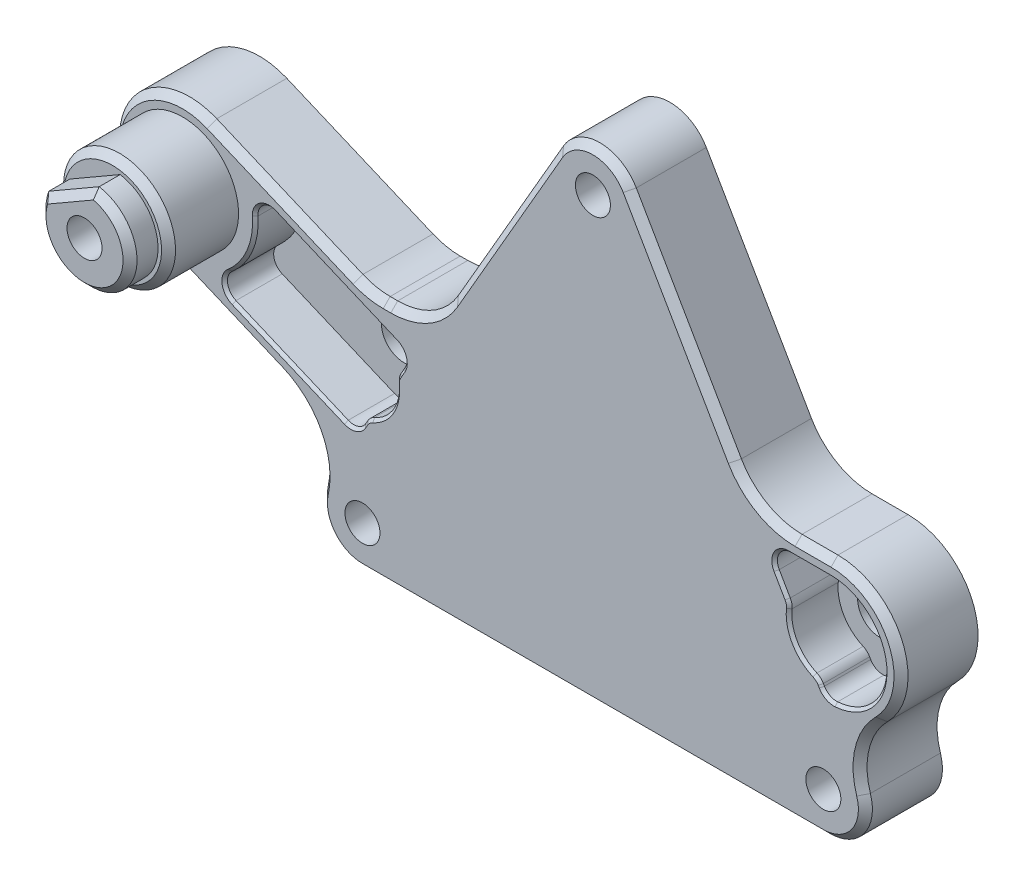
ISO-10303-21;
HEADER;
FILE_DESCRIPTION(('STEP AP214'),'2;1');
FILE_NAME('part.step','',(''),(''),'','','');
FILE_SCHEMA(('AUTOMOTIVE_DESIGN { 1 0 10303 214 1 1 1 1 }'));
ENDSEC;
DATA;
#1=APPLICATION_CONTEXT('core data for automotive mechanical design processes');
#2=APPLICATION_PROTOCOL_DEFINITION('international standard','automotive_design',2000,#1);
#3=PRODUCT_CONTEXT('',#1,'mechanical');
#4=PRODUCT('Part','Part','',(#3));
#5=PRODUCT_RELATED_PRODUCT_CATEGORY('part','',(#4));
#6=PRODUCT_DEFINITION_FORMATION('','',#4);
#7=PRODUCT_DEFINITION_CONTEXT('part definition',#1,'design');
#8=PRODUCT_DEFINITION('design','',#6,#7);
#9=PRODUCT_DEFINITION_SHAPE('','',#8);
#10=(LENGTH_UNIT() NAMED_UNIT(*) SI_UNIT(.MILLI.,.METRE.));
#11=(NAMED_UNIT(*) PLANE_ANGLE_UNIT() SI_UNIT($,.RADIAN.));
#12=(NAMED_UNIT(*) SI_UNIT($,.STERADIAN.) SOLID_ANGLE_UNIT());
#13=UNCERTAINTY_MEASURE_WITH_UNIT(LENGTH_MEASURE(1.E-05),#10,'distance_accuracy_value','');
#14=(GEOMETRIC_REPRESENTATION_CONTEXT(3) GLOBAL_UNCERTAINTY_ASSIGNED_CONTEXT((#13)) GLOBAL_UNIT_ASSIGNED_CONTEXT((#10,
#11,#12)) REPRESENTATION_CONTEXT('',''));
#15=CARTESIAN_POINT('',(0.,0.,0.));
#16=DIRECTION('',(0.,0.,1.));
#17=DIRECTION('',(1.,0.,0.));
#18=AXIS2_PLACEMENT_3D('',#15,#16,#17);
#19=CARTESIAN_POINT('',(-29.3,5.19615242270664,8.5));
#20=DIRECTION('',(0.,0.,1.));
#21=DIRECTION('',(1.,0.,0.));
#22=AXIS2_PLACEMENT_3D('',#19,#20,#21);
#23=CYLINDRICAL_SURFACE('',#22,1.24999999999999);
#24=CARTESIAN_POINT('',(-29.3,5.19615242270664,8.5));
#25=DIRECTION('',(0.,0.,1.));
#26=DIRECTION('',(1.,0.,0.));
#27=AXIS2_PLACEMENT_3D('',#24,#25,#26);
#28=CIRCLE('',#27,1.24999999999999);
#29=CARTESIAN_POINT('',(-28.05,5.19615242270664,8.5));
#30=VERTEX_POINT('',#29);
#31=EDGE_CURVE('E788',#30,#30,#28,.F.);
#32=ORIENTED_EDGE('',*,*,#31,.F.);
#33=EDGE_LOOP('',(#32));
#34=FACE_BOUND('',#33,.T.);
#35=CARTESIAN_POINT('',(-29.3,5.19615242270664,4.5));
#36=DIRECTION('',(0.,0.,1.));
#37=DIRECTION('',(1.,0.,0.));
#38=AXIS2_PLACEMENT_3D('',#35,#36,#37);
#39=CIRCLE('',#38,1.24999999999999);
#40=CARTESIAN_POINT('',(-28.05,5.19615242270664,4.5));
#41=VERTEX_POINT('',#40);
#42=EDGE_CURVE('E20',#41,#41,#39,.T.);
#43=ORIENTED_EDGE('',*,*,#42,.F.);
#44=EDGE_LOOP('',(#43));
#45=FACE_BOUND('',#44,.T.);
#46=ADVANCED_FACE('F17',(#34,#45),#23,.F.);
#47=CARTESIAN_POINT('',(-29.3,5.19615242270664,4.5));
#48=DIRECTION('',(0.,0.,-1.));
#49=DIRECTION('',(-1.,0.,0.));
#50=AXIS2_PLACEMENT_3D('',#47,#48,#49);
#51=PLANE('',#50);
#52=ORIENTED_EDGE('',*,*,#42,.T.);
#53=EDGE_LOOP('',(#52));
#54=FACE_BOUND('',#53,.T.);
#55=CARTESIAN_POINT('',(-29.3,5.19615242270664,4.5));
#56=DIRECTION('',(0.,0.,-1.));
#57=DIRECTION('',(-1.,0.,0.));
#58=AXIS2_PLACEMENT_3D('',#55,#56,#57);
#59=CIRCLE('',#58,3.);
#60=CARTESIAN_POINT('',(-32.3,5.19615242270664,4.5));
#61=VERTEX_POINT('',#60);
#62=EDGE_CURVE('E589',#61,#61,#59,.T.);
#63=ORIENTED_EDGE('',*,*,#62,.T.);
#64=EDGE_LOOP('',(#63));
#65=FACE_BOUND('',#64,.T.);
#66=ADVANCED_FACE('F797',(#54,#65),#51,.T.);
#67=CARTESIAN_POINT('',(-29.3,5.19615242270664,8.5));
#68=DIRECTION('',(0.,0.,1.));
#69=DIRECTION('',(1.,0.,0.));
#70=AXIS2_PLACEMENT_3D('',#67,#68,#69);
#71=PLANE('',#70);
#72=ORIENTED_EDGE('',*,*,#31,.T.);
#73=EDGE_LOOP('',(#72));
#74=FACE_BOUND('',#73,.T.);
#75=CARTESIAN_POINT('',(-29.3,5.19615242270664,8.49999999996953));
#76=DIRECTION('',(0.,0.,-1.));
#77=DIRECTION('',(-1.,0.,0.));
#78=AXIS2_PLACEMENT_3D('',#75,#76,#77);
#79=CIRCLE('',#78,2.75000000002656);
#80=CARTESIAN_POINT('',(-28.6654128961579,7.87193253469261,8.49999999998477));
#81=VERTEX_POINT('',#80);
#82=CARTESIAN_POINT('',(-31.9345871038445,5.98447392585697,8.49999999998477));
#83=VERTEX_POINT('',#82);
#84=EDGE_CURVE('E584',#81,#83,#79,.T.);
#85=ORIENTED_EDGE('',*,*,#84,.F.);
#86=DIRECTION('',(0.866025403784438,0.500000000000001,0.));
#87=VECTOR('',#86,1.);
#88=CARTESIAN_POINT('',(-31.9345871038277,5.98447392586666,8.5));
#89=LINE('',#88,#87);
#90=EDGE_CURVE('E588',#83,#81,#89,.T.);
#91=ORIENTED_EDGE('',*,*,#90,.F.);
#92=EDGE_LOOP('',(#85,#91));
#93=FACE_BOUND('',#92,.T.);
#94=ADVANCED_FACE('F806',(#74,#93),#71,.T.);
#95=CARTESIAN_POINT('',(12.2398257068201,3.8,-20.4982489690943));
#96=DIRECTION('',(-0.866025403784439,-0.5,0.));
#97=DIRECTION('',(0.5,-0.866025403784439,0.));
#98=AXIS2_PLACEMENT_3D('',#95,#96,#97);
#99=PLANE('',#98);
#100=DIRECTION('',(0.5,-0.866025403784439,0.));
#101=VECTOR('',#100,1.);
#102=CARTESIAN_POINT('',(12.2398257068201,3.8,1.3));
#103=LINE('',#102,#101);
#104=CARTESIAN_POINT('',(13.8904195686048,0.94108756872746,1.3));
#105=VERTEX_POINT('',#104);
#106=CARTESIAN_POINT('',(13.1058511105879,2.29999999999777,1.30000000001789));
#107=VERTEX_POINT('',#106);
#108=EDGE_CURVE('E787',#105,#107,#103,.F.);
#109=ORIENTED_EDGE('',*,*,#108,.F.);
#110=DIRECTION('',(0.,0.,-1.));
#111=VECTOR('',#110,1.);
#112=CARTESIAN_POINT('',(13.8904195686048,0.941087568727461,0.));
#113=LINE('',#112,#111);
#114=CARTESIAN_POINT('',(13.8904195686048,0.94108756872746,-2.00000000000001));
#115=VERTEX_POINT('',#114);
#116=EDGE_CURVE('E710',#115,#105,#113,.F.);
#117=ORIENTED_EDGE('',*,*,#116,.F.);
#118=DIRECTION('',(0.5,-0.866025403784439,0.));
#119=VECTOR('',#118,1.);
#120=CARTESIAN_POINT('',(12.2398257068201,3.8,-2.00000000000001));
#121=LINE('',#120,#119);
#122=CARTESIAN_POINT('',(13.1058511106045,2.3,-2.00000000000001));
#123=VERTEX_POINT('',#122);
#124=EDGE_CURVE('E790',#123,#115,#121,.T.);
#125=ORIENTED_EDGE('',*,*,#124,.F.);
#126=DIRECTION('',(0.,0.,-1.));
#127=VECTOR('',#126,1.);
#128=CARTESIAN_POINT('',(13.1058511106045,2.3,-20.4982489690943));
#129=LINE('',#128,#127);
#130=EDGE_CURVE('E694',#123,#107,#129,.F.);
#131=ORIENTED_EDGE('',*,*,#130,.T.);
#132=EDGE_LOOP('',(#109,#117,#125,#131));
#133=FACE_BOUND('',#132,.T.);
#134=ADVANCED_FACE('F1972',(#133),#99,.F.);
#135=CARTESIAN_POINT('',(-29.3,5.19615242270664,4.5));
#136=DIRECTION('',(0.,0.,-1.));
#137=DIRECTION('',(-1.,0.,0.));
#138=AXIS2_PLACEMENT_3D('',#135,#136,#137);
#139=CYLINDRICAL_SURFACE('',#138,3.);
#140=ORIENTED_EDGE('',*,*,#62,.F.);
#141=EDGE_LOOP('',(#140));
#142=FACE_BOUND('',#141,.T.);
#143=CARTESIAN_POINT('',(-29.3,5.19615242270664,0.));
#144=DIRECTION('',(0.,0.,-1.));
#145=DIRECTION('',(-1.,0.,0.));
#146=AXIS2_PLACEMENT_3D('',#143,#144,#145);
#147=CIRCLE('',#146,3.);
#148=CARTESIAN_POINT('',(-32.3,5.19615242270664,0.));
#149=VERTEX_POINT('',#148);
#150=EDGE_CURVE('E2228',#149,#149,#147,.F.);
#151=ORIENTED_EDGE('',*,*,#150,.F.);
#152=EDGE_LOOP('',(#151));
#153=FACE_BOUND('',#152,.T.);
#154=ADVANCED_FACE('F774',(#142,#153),#139,.F.);
#155=CARTESIAN_POINT('',(-36.5622727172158,3.8900286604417,7.99999999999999));
#156=DIRECTION('',(-0.353553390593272,0.61237243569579,0.707106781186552));
#157=DIRECTION('',(0.,-0.755928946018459,0.654653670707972));
#158=AXIS2_PLACEMENT_3D('',#155,#156,#157);
#159=PLANE('',#158);
#160=CARTESIAN_POINT('',(-28.7515631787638,8.39954391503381,7.99999999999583));
#161=CARTESIAN_POINT('',(-28.7358563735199,8.31208081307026,8.08359867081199));
#162=CARTESIAN_POINT('',(-28.7208237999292,8.22438177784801,8.16706454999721));
#163=CARTESIAN_POINT('',(-28.6921070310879,8.048511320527,8.333731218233));
#164=CARTESIAN_POINT('',(-28.6784228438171,7.96033989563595,8.41693200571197));
#165=CARTESIAN_POINT('',(-28.665412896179,7.87193253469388,8.49999999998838));
#166=B_SPLINE_CURVE_WITH_KNOTS('',3,(#160,#161,#162,#163,#164,#165),.UNSPECIFIED.,.F.,.F.,(4,2,
4),(0.,0.365995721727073,0.731993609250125),.UNSPECIFIED.);
#167=CARTESIAN_POINT('',(-28.7515631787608,8.39954391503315,7.99999999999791));
#168=VERTEX_POINT('',#167);
#169=EDGE_CURVE('E594',#168,#81,#166,.T.);
#170=ORIENTED_EDGE('',*,*,#169,.F.);
#171=DIRECTION('',(0.866025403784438,0.500000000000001,0.));
#172=VECTOR('',#171,1.);
#173=CARTESIAN_POINT('',(-36.5622727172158,3.8900286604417,7.99999999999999));
#174=LINE('',#173,#172);
#175=CARTESIAN_POINT('',(-32.3484368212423,6.32288794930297,7.99999999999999));
#176=VERTEX_POINT('',#175);
#177=EDGE_CURVE('E592',#168,#176,#174,.F.);
#178=ORIENTED_EDGE('',*,*,#177,.T.);
#179=CARTESIAN_POINT('',(-32.3484368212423,6.32288794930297,7.99999999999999));
#180=CARTESIAN_POINT('',(-32.1355460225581,6.14334762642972,8.26193187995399));
#181=CARTESIAN_POINT('',(-31.9345871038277,5.98447392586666,8.5));
#182=B_SPLINE_CURVE_WITH_KNOTS('',2,(#179,#180,#181),.UNSPECIFIED.,.F.,.F.,(3,3),(0.,1.),.UNSPECIFIED.);
#183=EDGE_CURVE('E581',#176,#83,#182,.T.);
#184=ORIENTED_EDGE('',*,*,#183,.T.);
#185=ORIENTED_EDGE('',*,*,#90,.T.);
#186=EDGE_LOOP('',(#170,#178,#184,#185));
#187=FACE_BOUND('',#186,.T.);
#188=ADVANCED_FACE('F593',(#187),#159,.T.);
#189=CARTESIAN_POINT('',(-29.3,5.19615242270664,7.99999999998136));
#190=DIRECTION('',(0.,0.,-1.));
#191=DIRECTION('',(-1.,0.,0.));
#192=AXIS2_PLACEMENT_3D('',#189,#190,#191);
#193=CONICAL_SURFACE('',#192,3.25000000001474,0.785398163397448);
#194=ORIENTED_EDGE('',*,*,#84,.T.);
#195=ORIENTED_EDGE('',*,*,#183,.F.);
#196=CARTESIAN_POINT('',(-29.3,5.19615242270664,7.99999999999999));
#197=DIRECTION('',(0.,0.,1.));
#198=DIRECTION('',(1.,0.,0.));
#199=AXIS2_PLACEMENT_3D('',#196,#197,#198);
#200=CIRCLE('',#199,3.25);
#201=EDGE_CURVE('E566',#168,#176,#200,.F.);
#202=ORIENTED_EDGE('',*,*,#201,.F.);
#203=ORIENTED_EDGE('',*,*,#169,.T.);
#204=EDGE_LOOP('',(#194,#195,#202,#203));
#205=FACE_BOUND('',#204,.T.);
#206=ADVANCED_FACE('F583',(#205),#193,.T.);
#207=CARTESIAN_POINT('',(-16.8516165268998,-4.18785601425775,-20.4982489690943));
#208=DIRECTION('',(0.866025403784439,-0.5,0.));
#209=DIRECTION('',(0.5,0.866025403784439,0.));
#210=AXIS2_PLACEMENT_3D('',#207,#208,#209);
#211=PLANE('',#210);
#212=DIRECTION('',(0.5,0.866025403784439,0.));
#213=VECTOR('',#212,1.);
#214=CARTESIAN_POINT('',(-16.8516165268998,-4.18785601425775,1.3));
#215=LINE('',#214,#213);
#216=CARTESIAN_POINT('',(-13.5883919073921,1.46421482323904,1.3));
#217=VERTEX_POINT('',#216);
#218=CARTESIAN_POINT('',(-13.8904195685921,0.941087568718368,1.30000000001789));
#219=VERTEX_POINT('',#218);
#220=EDGE_CURVE('E740',#217,#219,#215,.F.);
#221=ORIENTED_EDGE('',*,*,#220,.F.);
#222=DIRECTION('',(0.,0.,-1.));
#223=VECTOR('',#222,1.);
#224=CARTESIAN_POINT('',(-13.5883919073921,1.46421482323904,-20.4982489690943));
#225=LINE('',#224,#223);
#226=CARTESIAN_POINT('',(-13.5883919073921,1.46421482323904,-2.00000000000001));
#227=VERTEX_POINT('',#226);
#228=EDGE_CURVE('E743',#217,#227,#225,.T.);
#229=ORIENTED_EDGE('',*,*,#228,.T.);
#230=DIRECTION('',(0.5,0.866025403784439,0.));
#231=VECTOR('',#230,1.);
#232=CARTESIAN_POINT('',(-16.8516165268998,-4.18785601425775,-2.));
#233=LINE('',#232,#231);
#234=CARTESIAN_POINT('',(-13.8904195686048,0.941087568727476,-2.00000000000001));
#235=VERTEX_POINT('',#234);
#236=EDGE_CURVE('E750',#235,#227,#233,.T.);
#237=ORIENTED_EDGE('',*,*,#236,.F.);
#238=DIRECTION('',(0.,0.,-1.));
#239=VECTOR('',#238,1.);
#240=CARTESIAN_POINT('',(-13.8904195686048,0.941087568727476,0.));
#241=LINE('',#240,#239);
#242=EDGE_CURVE('E730',#219,#235,#241,.T.);
#243=ORIENTED_EDGE('',*,*,#242,.F.);
#244=EDGE_LOOP('',(#221,#229,#237,#243));
#245=FACE_BOUND('',#244,.T.);
#246=ADVANCED_FACE('F1303',(#245),#211,.F.);
#247=CARTESIAN_POINT('',(-16.8516165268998,-4.18785601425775,-20.4982489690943));
#248=DIRECTION('',(0.866025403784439,-0.5,0.));
#249=DIRECTION('',(0.5,0.866025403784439,0.));
#250=AXIS2_PLACEMENT_3D('',#247,#248,#249);
#251=PLANE('',#250);
#252=DIRECTION('',(0.5,0.866025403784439,0.));
#253=VECTOR('',#252,1.);
#254=CARTESIAN_POINT('',(-16.8516165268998,-4.18785601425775,1.3));
#255=LINE('',#254,#253);
#256=CARTESIAN_POINT('',(-16.2602155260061,-3.16351943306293,1.3));
#257=VERTEX_POINT('',#256);
#258=CARTESIAN_POINT('',(-16.4100179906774,-3.42298491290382,1.29999999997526));
#259=VERTEX_POINT('',#258);
#260=EDGE_CURVE('E716',#257,#259,#255,.F.);
#261=ORIENTED_EDGE('',*,*,#260,.F.);
#262=DIRECTION('',(0.,0.,-1.));
#263=VECTOR('',#262,1.);
#264=CARTESIAN_POINT('',(-16.2602155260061,-3.16351943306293,0.));
#265=LINE('',#264,#263);
#266=CARTESIAN_POINT('',(-16.2602155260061,-3.16351943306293,-2.00000000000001));
#267=VERTEX_POINT('',#266);
#268=EDGE_CURVE('E721',#267,#257,#265,.F.);
#269=ORIENTED_EDGE('',*,*,#268,.F.);
#270=DIRECTION('',(-0.500000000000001,-0.866025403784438,0.));
#271=VECTOR('',#270,1.);
#272=CARTESIAN_POINT('',(-16.2602155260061,-3.16351943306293,-2.00000000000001));
#273=LINE('',#272,#271);
#274=CARTESIAN_POINT('',(-16.4100179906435,-3.42298491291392,-2.00000000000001));
#275=VERTEX_POINT('',#274);
#276=EDGE_CURVE('E1325',#267,#275,#273,.T.);
#277=ORIENTED_EDGE('',*,*,#276,.T.);
#278=DIRECTION('',(0.,0.,-1.));
#279=VECTOR('',#278,1.);
#280=CARTESIAN_POINT('',(-16.4100179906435,-3.42298491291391,-20.4982489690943));
#281=LINE('',#280,#279);
#282=EDGE_CURVE('E577',#275,#259,#281,.F.);
#283=ORIENTED_EDGE('',*,*,#282,.T.);
#284=EDGE_LOOP('',(#261,#269,#277,#283));
#285=FACE_BOUND('',#284,.T.);
#286=ADVANCED_FACE('F1300',(#285),#251,.F.);
#287=CARTESIAN_POINT('',(12.2398257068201,3.8,-20.4982489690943));
#288=DIRECTION('',(-0.866025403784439,-0.5,0.));
#289=DIRECTION('',(0.5,-0.866025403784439,0.));
#290=AXIS2_PLACEMENT_3D('',#287,#288,#289);
#291=PLANE('',#290);
#292=DIRECTION('',(0.5,-0.866025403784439,0.));
#293=VECTOR('',#292,1.);
#294=CARTESIAN_POINT('',(12.2398257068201,3.8,1.3));
#295=LINE('',#294,#293);
#296=CARTESIAN_POINT('',(16.3348472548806,-3.29278537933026,1.29999999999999));
#297=VERTEX_POINT('',#296);
#298=CARTESIAN_POINT('',(16.2602155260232,-3.16351943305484,1.29999999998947));
#299=VERTEX_POINT('',#298);
#300=EDGE_CURVE('E715',#297,#299,#295,.F.);
#301=ORIENTED_EDGE('',*,*,#300,.F.);
#302=DIRECTION('',(0.,0.,1.));
#303=VECTOR('',#302,1.);
#304=CARTESIAN_POINT('',(16.3348472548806,-3.29278537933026,-20.4982489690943));
#305=LINE('',#304,#303);
#306=CARTESIAN_POINT('',(16.3348472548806,-3.29278537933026,-2.00000000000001));
#307=VERTEX_POINT('',#306);
#308=EDGE_CURVE('E701',#297,#307,#305,.F.);
#309=ORIENTED_EDGE('',*,*,#308,.T.);
#310=DIRECTION('',(0.5,-0.866025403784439,0.));
#311=VECTOR('',#310,1.);
#312=CARTESIAN_POINT('',(12.2398257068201,3.8,-2.00000000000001));
#313=LINE('',#312,#311);
#314=CARTESIAN_POINT('',(16.2602155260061,-3.16351943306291,-2.00000000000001));
#315=VERTEX_POINT('',#314);
#316=EDGE_CURVE('E713',#315,#307,#313,.T.);
#317=ORIENTED_EDGE('',*,*,#316,.F.);
#318=DIRECTION('',(0.,0.,-1.));
#319=VECTOR('',#318,1.);
#320=CARTESIAN_POINT('',(16.2602155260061,-3.16351943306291,0.));
#321=LINE('',#320,#319);
#322=EDGE_CURVE('E682',#299,#315,#321,.T.);
#323=ORIENTED_EDGE('',*,*,#322,.F.);
#324=EDGE_LOOP('',(#301,#309,#317,#323));
#325=FACE_BOUND('',#324,.T.);
#326=ADVANCED_FACE('F1296',(#325),#291,.F.);
#327=CARTESIAN_POINT('',(13.0243941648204,0.44108756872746,0.));
#328=DIRECTION('',(0.,0.,-1.));
#329=DIRECTION('',(-1.,0.,0.));
#330=AXIS2_PLACEMENT_3D('',#327,#328,#329);
#331=CYLINDRICAL_SURFACE('',#330,1.);
#332=DIRECTION('',(0.,0.,-1.));
#333=VECTOR('',#332,1.);
#334=CARTESIAN_POINT('',(14.0182956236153,0.330815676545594,0.));
#335=LINE('',#334,#333);
#336=CARTESIAN_POINT('',(14.0182956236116,0.330815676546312,1.30000000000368));
#337=VERTEX_POINT('',#336);
#338=CARTESIAN_POINT('',(14.0182956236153,0.330815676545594,-2.00000000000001));
#339=VERTEX_POINT('',#338);
#340=EDGE_CURVE('E685',#337,#339,#335,.T.);
#341=ORIENTED_EDGE('',*,*,#340,.T.);
#342=CARTESIAN_POINT('',(13.0243941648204,0.44108756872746,-2.00000000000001));
#343=DIRECTION('',(0.,0.,-1.));
#344=DIRECTION('',(-1.,0.,0.));
#345=AXIS2_PLACEMENT_3D('',#342,#343,#344);
#346=CIRCLE('',#345,1.);
#347=EDGE_CURVE('E698',#339,#115,#346,.F.);
#348=ORIENTED_EDGE('',*,*,#347,.T.);
#349=ORIENTED_EDGE('',*,*,#116,.T.);
#350=CARTESIAN_POINT('',(13.0243941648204,0.44108756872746,1.3));
#351=DIRECTION('',(0.,0.,-1.));
#352=DIRECTION('',(-1.,0.,0.));
#353=AXIS2_PLACEMENT_3D('',#350,#351,#352);
#354=CIRCLE('',#353,1.);
#355=EDGE_CURVE('E707',#105,#337,#354,.T.);
#356=ORIENTED_EDGE('',*,*,#355,.T.);
#357=EDGE_LOOP('',(#341,#348,#349,#356));
#358=FACE_BOUND('',#357,.T.);
#359=ADVANCED_FACE('F1290',(#358),#331,.T.);
#360=CARTESIAN_POINT('',(7.5,-8.50000000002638,-0.999999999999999));
#361=DIRECTION('',(0.,-1.,0.));
#362=DIRECTION('',(0.,0.,-1.));
#363=AXIS2_PLACEMENT_3D('',#360,#361,#362);
#364=CONICAL_SURFACE('',#363,1.02500000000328,1.02974425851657);
#365=CARTESIAN_POINT('',(7.72499999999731,-8.50000000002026,6.53199383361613E-12));
#366=CARTESIAN_POINT('',(7.68763709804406,-8.49505064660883,2.35463732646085E-12));
#367=CARTESIAN_POINT('',(7.65010866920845,-8.49128957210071,6.33293235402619E-13));
#368=CARTESIAN_POINT('',(7.57505300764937,-8.48625896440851,-6.28761249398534E-13));
#369=CARTESIAN_POINT('',(7.53752650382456,-8.48497848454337,-1.79083062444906E-13));
#370=CARTESIAN_POINT('',(7.46247349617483,-8.48497848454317,1.80818790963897E-13));
#371=CARTESIAN_POINT('',(7.42494699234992,-8.48625896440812,0.));
#372=CARTESIAN_POINT('',(7.34989133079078,-8.49128957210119,0.));
#373=CARTESIAN_POINT('',(7.3123629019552,-8.49505064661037,-1.80686402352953E-13));
#374=CARTESIAN_POINT('',(7.27500000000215,-8.50000000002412,0.));
#375=B_SPLINE_CURVE_WITH_KNOTS('',3,(#365,#366,#367,#368,#369,#370,#371,#372,#373,#374),
.UNSPECIFIED.,.F.,.F.,(4,2,2,2,4),(0.,0.113061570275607,0.225623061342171,0.338184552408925,
0.451246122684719),.UNSPECIFIED.);
#376=CARTESIAN_POINT('',(7.72499999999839,-8.50000000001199,0.));
#377=VERTEX_POINT('',#376);
#378=CARTESIAN_POINT('',(7.27500000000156,-8.50000000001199,0.));
#379=VERTEX_POINT('',#378);
#380=EDGE_CURVE('E617',#377,#379,#375,.T.);
#381=ORIENTED_EDGE('',*,*,#380,.F.);
#382=CARTESIAN_POINT('',(7.5,-8.5,-0.999999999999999));
#383=DIRECTION('',(0.,-1.,0.));
#384=DIRECTION('',(0.,0.,-1.));
#385=AXIS2_PLACEMENT_3D('',#382,#383,#384);
#386=CIRCLE('',#385,1.02499999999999);
#387=EDGE_CURVE('E608',#377,#379,#386,.T.);
#388=ORIENTED_EDGE('',*,*,#387,.T.);
#389=EDGE_LOOP('',(#381,#388));
#390=FACE_BOUND('',#389,.T.);
#391=ADVANCED_FACE('F1285',(#390),#364,.F.);
#392=CARTESIAN_POINT('',(-7.5,-8.50000000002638,-1.));
#393=DIRECTION('',(0.,-1.,0.));
#394=DIRECTION('',(0.,0.,-1.));
#395=AXIS2_PLACEMENT_3D('',#392,#393,#394);
#396=CONICAL_SURFACE('',#395,1.02500000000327,1.02974425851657);
#397=CARTESIAN_POINT('',(-7.2750000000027,-8.50000000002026,6.53238797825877E-12));
#398=CARTESIAN_POINT('',(-7.31236290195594,-8.49505064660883,2.35477899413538E-12));
#399=CARTESIAN_POINT('',(-7.34989133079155,-8.49128957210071,6.33331163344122E-13));
#400=CARTESIAN_POINT('',(-7.42494699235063,-8.48625896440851,-6.28799014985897E-13));
#401=CARTESIAN_POINT('',(-7.46247349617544,-8.48497848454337,-1.7909336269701E-13));
#402=CARTESIAN_POINT('',(-7.53752650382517,-8.48497848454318,1.80830212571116E-13));
#403=CARTESIAN_POINT('',(-7.57505300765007,-8.48625896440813,0.));
#404=CARTESIAN_POINT('',(-7.65010866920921,-8.49128957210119,0.));
#405=CARTESIAN_POINT('',(-7.68763709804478,-8.49505064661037,-1.80697733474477E-13));
#406=CARTESIAN_POINT('',(-7.72499999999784,-8.50000000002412,0.));
#407=B_SPLINE_CURVE_WITH_KNOTS('',3,(#397,#398,#399,#400,#401,#402,#403,#404,#405,#406),
.UNSPECIFIED.,.F.,.F.,(4,2,2,2,4),(0.,0.113061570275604,0.225623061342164,0.338184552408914,
0.451246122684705),.UNSPECIFIED.);
#408=CARTESIAN_POINT('',(-7.27500000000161,-8.50000000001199,0.));
#409=VERTEX_POINT('',#408);
#410=CARTESIAN_POINT('',(-7.72499999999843,-8.50000000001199,0.));
#411=VERTEX_POINT('',#410);
#412=EDGE_CURVE('E1267',#409,#411,#407,.T.);
#413=ORIENTED_EDGE('',*,*,#412,.F.);
#414=CARTESIAN_POINT('',(-7.5,-8.5,-1.));
#415=DIRECTION('',(0.,-1.,0.));
#416=DIRECTION('',(0.,0.,-1.));
#417=AXIS2_PLACEMENT_3D('',#414,#415,#416);
#418=CIRCLE('',#417,1.02499999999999);
#419=EDGE_CURVE('E629',#409,#411,#418,.T.);
#420=ORIENTED_EDGE('',*,*,#419,.T.);
#421=EDGE_LOOP('',(#413,#420));
#422=FACE_BOUND('',#421,.T.);
#423=ADVANCED_FACE('F1289',(#422),#396,.F.);
#424=CARTESIAN_POINT('',(1.5,15.8299896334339,0.));
#425=DIRECTION('',(0.,0.,-1.));
#426=DIRECTION('',(-1.,0.,0.));
#427=AXIS2_PLACEMENT_3D('',#424,#425,#426);
#428=CYLINDRICAL_SURFACE('',#427,1.);
#429=DIRECTION('',(0.,0.,-1.));
#430=VECTOR('',#429,1.);
#431=CARTESIAN_POINT('',(1.19694472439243,16.7829626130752,0.));
#432=LINE('',#431,#430);
#433=CARTESIAN_POINT('',(1.19694472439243,16.7829626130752,-2.5));
#434=VERTEX_POINT('',#433);
#435=CARTESIAN_POINT('',(1.19694472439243,16.7829626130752,0.));
#436=VERTEX_POINT('',#435);
#437=EDGE_CURVE('E1466',#434,#436,#432,.F.);
#438=ORIENTED_EDGE('',*,*,#437,.T.);
#439=CARTESIAN_POINT('',(1.5,15.8299896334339,0.));
#440=DIRECTION('',(0.,0.,-1.));
#441=DIRECTION('',(-1.,0.,0.));
#442=AXIS2_PLACEMENT_3D('',#439,#440,#441);
#443=CIRCLE('',#442,1.);
#444=CARTESIAN_POINT('',(0.5,15.8299896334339,0.));
#445=VERTEX_POINT('',#444);
#446=EDGE_CURVE('E2192',#445,#436,#443,.T.);
#447=ORIENTED_EDGE('',*,*,#446,.F.);
#448=DIRECTION('',(0.,0.,1.));
#449=VECTOR('',#448,1.);
#450=CARTESIAN_POINT('',(0.5,15.8299896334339,-41.2286111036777));
#451=LINE('',#450,#449);
#452=CARTESIAN_POINT('',(0.5,15.8299896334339,-2.5));
#453=VERTEX_POINT('',#452);
#454=EDGE_CURVE('E1458',#445,#453,#451,.F.);
#455=ORIENTED_EDGE('',*,*,#454,.T.);
#456=CARTESIAN_POINT('',(1.5,15.8299896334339,-2.5));
#457=DIRECTION('',(0.,0.,-1.));
#458=DIRECTION('',(-1.,0.,0.));
#459=AXIS2_PLACEMENT_3D('',#456,#457,#458);
#460=CIRCLE('',#459,1.);
#461=EDGE_CURVE('E697',#434,#453,#460,.F.);
#462=ORIENTED_EDGE('',*,*,#461,.F.);
#463=EDGE_LOOP('',(#438,#447,#455,#462));
#464=FACE_BOUND('',#463,.T.);
#465=ADVANCED_FACE('F2244',(#464),#428,.F.);
#466=CARTESIAN_POINT('',(1.5,0.883366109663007,-41.2286111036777));
#467=DIRECTION('',(0.,0.,-1.));
#468=DIRECTION('',(-1.,0.,0.));
#469=AXIS2_PLACEMENT_3D('',#466,#467,#468);
#470=CYLINDRICAL_SURFACE('',#469,1.);
#471=DIRECTION('',(0.,0.,1.));
#472=VECTOR('',#471,1.);
#473=CARTESIAN_POINT('',(0.5,0.883366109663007,-41.2286111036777));
#474=LINE('',#473,#472);
#475=CARTESIAN_POINT('',(0.5,0.883366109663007,-2.5));
#476=VERTEX_POINT('',#475);
#477=CARTESIAN_POINT('',(0.5,0.883366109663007,0.));
#478=VERTEX_POINT('',#477);
#479=EDGE_CURVE('E667',#476,#478,#474,.T.);
#480=ORIENTED_EDGE('',*,*,#479,.T.);
#481=CARTESIAN_POINT('',(1.5,0.883366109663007,0.));
#482=DIRECTION('',(0.,0.,-1.));
#483=DIRECTION('',(-1.,0.,0.));
#484=AXIS2_PLACEMENT_3D('',#481,#482,#483);
#485=CIRCLE('',#484,1.);
#486=CARTESIAN_POINT('',(1.01501600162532,0.0088430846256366,0.));
#487=VERTEX_POINT('',#486);
#488=EDGE_CURVE('E2197',#487,#478,#485,.T.);
#489=ORIENTED_EDGE('',*,*,#488,.F.);
#490=DIRECTION('',(0.,0.,1.));
#491=VECTOR('',#490,1.);
#492=CARTESIAN_POINT('',(1.01501600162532,0.0088430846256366,-41.2286111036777));
#493=LINE('',#492,#491);
#494=CARTESIAN_POINT('',(1.01501600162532,0.0088430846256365,-2.5));
#495=VERTEX_POINT('',#494);
#496=EDGE_CURVE('E666',#487,#495,#493,.F.);
#497=ORIENTED_EDGE('',*,*,#496,.T.);
#498=CARTESIAN_POINT('',(1.5,0.883366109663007,-2.5));
#499=DIRECTION('',(0.,0.,-1.));
#500=DIRECTION('',(-1.,0.,0.));
#501=AXIS2_PLACEMENT_3D('',#498,#499,#500);
#502=CIRCLE('',#501,1.);
#503=EDGE_CURVE('E2237',#476,#495,#502,.F.);
#504=ORIENTED_EDGE('',*,*,#503,.F.);
#505=EDGE_LOOP('',(#480,#489,#497,#504));
#506=FACE_BOUND('',#505,.T.);
#507=ADVANCED_FACE('F2248',(#506),#470,.F.);
#508=CARTESIAN_POINT('',(0.,-1.71522070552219,-41.2286111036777));
#509=DIRECTION('',(0.,0.,-1.));
#510=DIRECTION('',(-1.,0.,0.));
#511=AXIS2_PLACEMENT_3D('',#508,#509,#510);
#512=CYLINDRICAL_SURFACE('',#511,1.);
#513=DIRECTION('',(0.,0.,1.));
#514=VECTOR('',#513,1.);
#515=CARTESIAN_POINT('',(0.484983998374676,-0.840697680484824,-41.2286111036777));
#516=LINE('',#515,#514);
#517=CARTESIAN_POINT('',(0.484983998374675,-0.840697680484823,-2.5));
#518=VERTEX_POINT('',#517);
#519=CARTESIAN_POINT('',(0.484983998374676,-0.840697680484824,0.));
#520=VERTEX_POINT('',#519);
#521=EDGE_CURVE('E657',#518,#520,#516,.T.);
#522=ORIENTED_EDGE('',*,*,#521,.T.);
#523=CARTESIAN_POINT('',(0.,-1.71522070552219,0.));
#524=DIRECTION('',(0.,0.,-1.));
#525=DIRECTION('',(-1.,0.,0.));
#526=AXIS2_PLACEMENT_3D('',#523,#524,#525);
#527=CIRCLE('',#526,1.);
#528=CARTESIAN_POINT('',(-0.484983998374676,-0.840697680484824,0.));
#529=VERTEX_POINT('',#528);
#530=EDGE_CURVE('E596',#529,#520,#527,.T.);
#531=ORIENTED_EDGE('',*,*,#530,.F.);
#532=DIRECTION('',(0.,0.,1.));
#533=VECTOR('',#532,1.);
#534=CARTESIAN_POINT('',(-0.484983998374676,-0.840697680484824,-41.2286111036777));
#535=LINE('',#534,#533);
#536=CARTESIAN_POINT('',(-0.484983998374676,-0.840697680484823,-2.5));
#537=VERTEX_POINT('',#536);
#538=EDGE_CURVE('E656',#529,#537,#535,.F.);
#539=ORIENTED_EDGE('',*,*,#538,.T.);
#540=CARTESIAN_POINT('',(0.,-1.71522070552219,-2.5));
#541=DIRECTION('',(0.,0.,-1.));
#542=DIRECTION('',(-1.,0.,0.));
#543=AXIS2_PLACEMENT_3D('',#540,#541,#542);
#544=CIRCLE('',#543,1.);
#545=EDGE_CURVE('E2235',#518,#537,#544,.F.);
#546=ORIENTED_EDGE('',*,*,#545,.F.);
#547=EDGE_LOOP('',(#522,#531,#539,#546));
#548=FACE_BOUND('',#547,.T.);
#549=ADVANCED_FACE('F2272',(#548),#512,.F.);
#550=CARTESIAN_POINT('',(-1.5,0.883366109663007,-41.2286111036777));
#551=DIRECTION('',(0.,0.,-1.));
#552=DIRECTION('',(-1.,0.,0.));
#553=AXIS2_PLACEMENT_3D('',#550,#551,#552);
#554=CYLINDRICAL_SURFACE('',#553,1.);
#555=DIRECTION('',(0.,0.,1.));
#556=VECTOR('',#555,1.);
#557=CARTESIAN_POINT('',(-1.01501600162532,0.0088430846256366,-41.2286111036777));
#558=LINE('',#557,#556);
#559=CARTESIAN_POINT('',(-1.01501600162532,0.00884308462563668,-2.5));
#560=VERTEX_POINT('',#559);
#561=CARTESIAN_POINT('',(-1.01501600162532,0.0088430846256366,0.));
#562=VERTEX_POINT('',#561);
#563=EDGE_CURVE('E647',#560,#562,#558,.T.);
#564=ORIENTED_EDGE('',*,*,#563,.T.);
#565=CARTESIAN_POINT('',(-1.5,0.883366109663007,0.));
#566=DIRECTION('',(0.,0.,-1.));
#567=DIRECTION('',(-1.,0.,0.));
#568=AXIS2_PLACEMENT_3D('',#565,#566,#567);
#569=CIRCLE('',#568,1.);
#570=CARTESIAN_POINT('',(-0.5,0.883366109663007,0.));
#571=VERTEX_POINT('',#570);
#572=EDGE_CURVE('E2212',#571,#562,#569,.T.);
#573=ORIENTED_EDGE('',*,*,#572,.F.);
#574=DIRECTION('',(0.,0.,1.));
#575=VECTOR('',#574,1.);
#576=CARTESIAN_POINT('',(-0.5,0.883366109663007,-41.2286111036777));
#577=LINE('',#576,#575);
#578=CARTESIAN_POINT('',(-0.5,0.883366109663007,-2.5));
#579=VERTEX_POINT('',#578);
#580=EDGE_CURVE('E646',#571,#579,#577,.F.);
#581=ORIENTED_EDGE('',*,*,#580,.T.);
#582=CARTESIAN_POINT('',(-1.5,0.883366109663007,-2.5));
#583=DIRECTION('',(0.,0.,-1.));
#584=DIRECTION('',(-1.,0.,0.));
#585=AXIS2_PLACEMENT_3D('',#582,#583,#584);
#586=CIRCLE('',#585,1.);
#587=EDGE_CURVE('E2233',#560,#579,#586,.F.);
#588=ORIENTED_EDGE('',*,*,#587,.F.);
#589=EDGE_LOOP('',(#564,#573,#581,#588));
#590=FACE_BOUND('',#589,.T.);
#591=ADVANCED_FACE('F2301',(#590),#554,.F.);
#592=CARTESIAN_POINT('',(-1.5,15.8299896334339,0.));
#593=DIRECTION('',(0.,0.,-1.));
#594=DIRECTION('',(-1.,0.,0.));
#595=AXIS2_PLACEMENT_3D('',#592,#593,#594);
#596=CYLINDRICAL_SURFACE('',#595,1.);
#597=DIRECTION('',(0.,0.,1.));
#598=VECTOR('',#597,1.);
#599=CARTESIAN_POINT('',(-0.5,15.8299896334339,-41.2286111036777));
#600=LINE('',#599,#598);
#601=CARTESIAN_POINT('',(-0.5,15.8299896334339,-2.5));
#602=VERTEX_POINT('',#601);
#603=CARTESIAN_POINT('',(-0.5,15.8299896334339,0.));
#604=VERTEX_POINT('',#603);
#605=EDGE_CURVE('E642',#602,#604,#600,.T.);
#606=ORIENTED_EDGE('',*,*,#605,.T.);
#607=CARTESIAN_POINT('',(-1.5,15.8299896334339,0.));
#608=DIRECTION('',(0.,0.,-1.));
#609=DIRECTION('',(-1.,0.,0.));
#610=AXIS2_PLACEMENT_3D('',#607,#608,#609);
#611=CIRCLE('',#610,1.);
#612=CARTESIAN_POINT('',(-1.19694472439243,16.7829626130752,0.));
#613=VERTEX_POINT('',#612);
#614=EDGE_CURVE('E2215',#613,#604,#611,.T.);
#615=ORIENTED_EDGE('',*,*,#614,.F.);
#616=DIRECTION('',(0.,0.,-1.));
#617=VECTOR('',#616,1.);
#618=CARTESIAN_POINT('',(-1.19694472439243,16.7829626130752,0.));
#619=LINE('',#618,#617);
#620=CARTESIAN_POINT('',(-1.19694472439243,16.7829626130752,-2.5));
#621=VERTEX_POINT('',#620);
#622=EDGE_CURVE('E1428',#613,#621,#619,.T.);
#623=ORIENTED_EDGE('',*,*,#622,.T.);
#624=CARTESIAN_POINT('',(-1.5,15.8299896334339,-2.5));
#625=DIRECTION('',(0.,0.,-1.));
#626=DIRECTION('',(-1.,0.,0.));
#627=AXIS2_PLACEMENT_3D('',#624,#625,#626);
#628=CIRCLE('',#627,1.);
#629=EDGE_CURVE('E2231',#602,#621,#628,.F.);
#630=ORIENTED_EDGE('',*,*,#629,.F.);
#631=EDGE_LOOP('',(#606,#615,#623,#630));
#632=FACE_BOUND('',#631,.T.);
#633=ADVANCED_FACE('F2305',(#632),#596,.F.);
#634=CARTESIAN_POINT('',(-29.3,5.19615242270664,0.));
#635=DIRECTION('',(0.,0.,-1.));
#636=DIRECTION('',(-1.,0.,0.));
#637=AXIS2_PLACEMENT_3D('',#634,#635,#636);
#638=PLANE('',#637);
#639=ORIENTED_EDGE('',*,*,#150,.T.);
#640=EDGE_LOOP('',(#639));
#641=FACE_BOUND('',#640,.T.);
#642=CARTESIAN_POINT('',(-29.3,5.19615242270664,0.));
#643=DIRECTION('',(0.,0.,-1.));
#644=DIRECTION('',(-1.,0.,0.));
#645=AXIS2_PLACEMENT_3D('',#642,#643,#644);
#646=CIRCLE('',#645,3.5);
#647=CARTESIAN_POINT('',(-32.8,5.19615242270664,0.));
#648=VERTEX_POINT('',#647);
#649=EDGE_CURVE('E637',#648,#648,#646,.T.);
#650=ORIENTED_EDGE('',*,*,#649,.T.);
#651=EDGE_LOOP('',(#650));
#652=FACE_BOUND('',#651,.T.);
#653=ADVANCED_FACE('F2362',(#641,#652),#638,.T.);
#654=CARTESIAN_POINT('',(5.,-10.,0.));
#655=DIRECTION('',(0.,0.,-1.));
#656=DIRECTION('',(-1.,0.,0.));
#657=AXIS2_PLACEMENT_3D('',#654,#655,#656);
#658=CYLINDRICAL_SURFACE('',#657,1.);
#659=DIRECTION('',(0.,0.,-1.));
#660=VECTOR('',#659,1.);
#661=CARTESIAN_POINT('',(5.94280904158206,-10.3333333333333,0.));
#662=LINE('',#661,#660);
#663=CARTESIAN_POINT('',(5.94280904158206,-10.3333333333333,-4.));
#664=VERTEX_POINT('',#663);
#665=CARTESIAN_POINT('',(5.94280904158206,-10.3333333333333,0.));
#666=VERTEX_POINT('',#665);
#667=EDGE_CURVE('E1281',#664,#666,#662,.F.);
#668=ORIENTED_EDGE('',*,*,#667,.F.);
#669=CARTESIAN_POINT('',(5.,-10.,-4.));
#670=DIRECTION('',(0.,0.,-1.));
#671=DIRECTION('',(-1.,0.,0.));
#672=AXIS2_PLACEMENT_3D('',#669,#670,#671);
#673=CIRCLE('',#672,1.);
#674=CARTESIAN_POINT('',(5.,-11.,-4.));
#675=VERTEX_POINT('',#674);
#676=EDGE_CURVE('E2188',#675,#664,#673,.F.);
#677=ORIENTED_EDGE('',*,*,#676,.F.);
#678=DIRECTION('',(0.,0.,1.));
#679=VECTOR('',#678,1.);
#680=CARTESIAN_POINT('',(5.,-11.,0.));
#681=LINE('',#680,#679);
#682=CARTESIAN_POINT('',(5.,-11.,0.));
#683=VERTEX_POINT('',#682);
#684=EDGE_CURVE('E636',#683,#675,#681,.F.);
#685=ORIENTED_EDGE('',*,*,#684,.F.);
#686=CARTESIAN_POINT('',(5.,-10.,0.));
#687=DIRECTION('',(0.,0.,-1.));
#688=DIRECTION('',(-1.,0.,0.));
#689=AXIS2_PLACEMENT_3D('',#686,#687,#688);
#690=CIRCLE('',#689,1.);
#691=EDGE_CURVE('E1344',#666,#683,#690,.T.);
#692=ORIENTED_EDGE('',*,*,#691,.F.);
#693=EDGE_LOOP('',(#668,#677,#685,#692));
#694=FACE_BOUND('',#693,.T.);
#695=ADVANCED_FACE('F2358',(#694),#658,.F.);
#696=CARTESIAN_POINT('',(-5.,-10.,0.));
#697=DIRECTION('',(0.,0.,1.));
#698=DIRECTION('',(1.,0.,0.));
#699=AXIS2_PLACEMENT_3D('',#696,#697,#698);
#700=CYLINDRICAL_SURFACE('',#699,1.);
#701=DIRECTION('',(0.,0.,1.));
#702=VECTOR('',#701,1.);
#703=CARTESIAN_POINT('',(-5.94280904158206,-10.3333333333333,0.));
#704=LINE('',#703,#702);
#705=CARTESIAN_POINT('',(-5.94280904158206,-10.3333333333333,0.));
#706=VERTEX_POINT('',#705);
#707=CARTESIAN_POINT('',(-5.94280904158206,-10.3333333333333,-4.));
#708=VERTEX_POINT('',#707);
#709=EDGE_CURVE('E2224',#706,#708,#704,.F.);
#710=ORIENTED_EDGE('',*,*,#709,.F.);
#711=CARTESIAN_POINT('',(-5.,-10.,0.));
#712=DIRECTION('',(0.,0.,1.));
#713=DIRECTION('',(1.,0.,0.));
#714=AXIS2_PLACEMENT_3D('',#711,#712,#713);
#715=CIRCLE('',#714,1.);
#716=CARTESIAN_POINT('',(-5.,-11.,0.));
#717=VERTEX_POINT('',#716);
#718=EDGE_CURVE('E1339',#717,#706,#715,.F.);
#719=ORIENTED_EDGE('',*,*,#718,.F.);
#720=DIRECTION('',(0.,0.,1.));
#721=VECTOR('',#720,1.);
#722=CARTESIAN_POINT('',(-5.,-11.,0.));
#723=LINE('',#722,#721);
#724=CARTESIAN_POINT('',(-5.,-11.,-4.));
#725=VERTEX_POINT('',#724);
#726=EDGE_CURVE('E1421',#725,#717,#723,.T.);
#727=ORIENTED_EDGE('',*,*,#726,.F.);
#728=CARTESIAN_POINT('',(-5.,-10.,-4.));
#729=DIRECTION('',(0.,0.,1.));
#730=DIRECTION('',(1.,0.,0.));
#731=AXIS2_PLACEMENT_3D('',#728,#729,#730);
#732=CIRCLE('',#731,1.);
#733=EDGE_CURVE('E2225',#708,#725,#732,.T.);
#734=ORIENTED_EDGE('',*,*,#733,.F.);
#735=EDGE_LOOP('',(#710,#719,#727,#734));
#736=FACE_BOUND('',#735,.T.);
#737=ADVANCED_FACE('F2354',(#736),#700,.F.);
#738=CARTESIAN_POINT('',(-6.4142135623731,-10.5,0.));
#739=DIRECTION('',(0.,0.,1.));
#740=DIRECTION('',(1.,0.,0.));
#741=AXIS2_PLACEMENT_3D('',#738,#739,#740);
#742=CYLINDRICAL_SURFACE('',#741,0.5);
#743=CARTESIAN_POINT('',(-6.4142135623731,-10.5,-4.));
#744=DIRECTION('',(0.,0.,1.));
#745=DIRECTION('',(1.,0.,0.));
#746=AXIS2_PLACEMENT_3D('',#743,#744,#745);
#747=CIRCLE('',#746,0.5);
#748=CARTESIAN_POINT('',(-6.4142135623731,-10.,-4.));
#749=VERTEX_POINT('',#748);
#750=EDGE_CURVE('E2222',#708,#749,#747,.T.);
#751=ORIENTED_EDGE('',*,*,#750,.T.);
#752=DIRECTION('',(0.,0.,1.));
#753=VECTOR('',#752,1.);
#754=CARTESIAN_POINT('',(-6.4142135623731,-10.,0.));
#755=LINE('',#754,#753);
#756=CARTESIAN_POINT('',(-6.4142135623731,-10.,0.));
#757=VERTEX_POINT('',#756);
#758=EDGE_CURVE('E1417',#757,#749,#755,.F.);
#759=ORIENTED_EDGE('',*,*,#758,.F.);
#760=CARTESIAN_POINT('',(-6.4142135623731,-10.5,0.));
#761=DIRECTION('',(0.,0.,1.));
#762=DIRECTION('',(1.,0.,0.));
#763=AXIS2_PLACEMENT_3D('',#760,#761,#762);
#764=CIRCLE('',#763,0.5);
#765=EDGE_CURVE('E1337',#706,#757,#764,.T.);
#766=ORIENTED_EDGE('',*,*,#765,.F.);
#767=ORIENTED_EDGE('',*,*,#709,.T.);
#768=EDGE_LOOP('',(#751,#759,#766,#767));
#769=FACE_BOUND('',#768,.T.);
#770=ADVANCED_FACE('F2351',(#769),#742,.T.);
#771=CARTESIAN_POINT('',(-12.796113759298,-8.81155806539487,0.));
#772=DIRECTION('',(0.,0.,-1.));
#773=DIRECTION('',(-1.,0.,0.));
#774=AXIS2_PLACEMENT_3D('',#771,#772,#773);
#775=CYLINDRICAL_SURFACE('',#774,1.);
#776=CARTESIAN_POINT('',(-12.796113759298,-8.81155806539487,0.));
#777=DIRECTION('',(0.,0.,-1.));
#778=DIRECTION('',(-1.,0.,0.));
#779=AXIS2_PLACEMENT_3D('',#776,#777,#778);
#780=CIRCLE('',#779,1.);
#781=CARTESIAN_POINT('',(-13.380385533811,-9.62311613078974,0.));
#782=VERTEX_POINT('',#781);
#783=CARTESIAN_POINT('',(-13.2810977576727,-7.9370350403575,0.));
#784=VERTEX_POINT('',#783);
#785=EDGE_CURVE('E1333',#782,#784,#780,.T.);
#786=ORIENTED_EDGE('',*,*,#785,.F.);
#787=DIRECTION('',(0.,0.,-1.));
#788=VECTOR('',#787,1.);
#789=CARTESIAN_POINT('',(-13.380385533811,-9.62311613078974,0.));
#790=LINE('',#789,#788);
#791=CARTESIAN_POINT('',(-13.380385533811,-9.62311613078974,-2.5));
#792=VERTEX_POINT('',#791);
#793=EDGE_CURVE('E1408',#782,#792,#790,.T.);
#794=ORIENTED_EDGE('',*,*,#793,.T.);
#795=CARTESIAN_POINT('',(-12.796113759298,-8.81155806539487,-2.5));
#796=DIRECTION('',(0.,0.,-1.));
#797=DIRECTION('',(-1.,0.,0.));
#798=AXIS2_PLACEMENT_3D('',#795,#796,#797);
#799=CIRCLE('',#798,1.);
#800=CARTESIAN_POINT('',(-13.2810977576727,-7.9370350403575,-2.5));
#801=VERTEX_POINT('',#800);
#802=EDGE_CURVE('E2220',#801,#792,#799,.F.);
#803=ORIENTED_EDGE('',*,*,#802,.F.);
#804=DIRECTION('',(0.,0.,1.));
#805=VECTOR('',#804,1.);
#806=CARTESIAN_POINT('',(-13.2810977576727,-7.9370350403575,-41.2286111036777));
#807=LINE('',#806,#805);
#808=EDGE_CURVE('E652',#801,#784,#807,.T.);
#809=ORIENTED_EDGE('',*,*,#808,.T.);
#810=EDGE_LOOP('',(#786,#794,#803,#809));
#811=FACE_BOUND('',#810,.T.);
#812=ADVANCED_FACE('F2279',(#811),#775,.F.);
#813=CARTESIAN_POINT('',(-14.6366306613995,-6.40181161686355,0.));
#814=DIRECTION('',(0.,0.,-1.));
#815=DIRECTION('',(-1.,0.,0.));
#816=AXIS2_PLACEMENT_3D('',#813,#814,#815);
#817=CYLINDRICAL_SURFACE('',#816,0.999999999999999);
#818=DIRECTION('',(0.,0.,-1.));
#819=VECTOR('',#818,1.);
#820=CARTESIAN_POINT('',(-15.4878593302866,-6.92660657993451,0.));
#821=LINE('',#820,#819);
#822=CARTESIAN_POINT('',(-15.4878593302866,-6.92660657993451,-2.5));
#823=VERTEX_POINT('',#822);
#824=CARTESIAN_POINT('',(-15.4878593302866,-6.92660657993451,0.));
#825=VERTEX_POINT('',#824);
#826=EDGE_CURVE('E1404',#823,#825,#821,.F.);
#827=ORIENTED_EDGE('',*,*,#826,.T.);
#828=CARTESIAN_POINT('',(-14.6366306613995,-6.40181161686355,0.));
#829=DIRECTION('',(0.,0.,-1.));
#830=DIRECTION('',(-1.,0.,0.));
#831=AXIS2_PLACEMENT_3D('',#828,#829,#830);
#832=CIRCLE('',#831,0.999999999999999);
#833=CARTESIAN_POINT('',(-14.1516466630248,-7.27633464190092,0.));
#834=VERTEX_POINT('',#833);
#835=EDGE_CURVE('E2209',#834,#825,#832,.T.);
#836=ORIENTED_EDGE('',*,*,#835,.F.);
#837=DIRECTION('',(0.,0.,1.));
#838=VECTOR('',#837,1.);
#839=CARTESIAN_POINT('',(-14.1516466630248,-7.27633464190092,-41.2286111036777));
#840=LINE('',#839,#838);
#841=CARTESIAN_POINT('',(-14.1516466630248,-7.27633464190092,-2.5));
#842=VERTEX_POINT('',#841);
#843=EDGE_CURVE('E651',#834,#842,#840,.F.);
#844=ORIENTED_EDGE('',*,*,#843,.T.);
#845=CARTESIAN_POINT('',(-14.6366306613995,-6.40181161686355,-2.5));
#846=DIRECTION('',(0.,0.,-1.));
#847=DIRECTION('',(-1.,0.,0.));
#848=AXIS2_PLACEMENT_3D('',#845,#846,#847);
#849=CIRCLE('',#848,0.999999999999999);
#850=EDGE_CURVE('E2218',#823,#842,#849,.F.);
#851=ORIENTED_EDGE('',*,*,#850,.F.);
#852=EDGE_LOOP('',(#827,#836,#844,#851));
#853=FACE_BOUND('',#852,.T.);
#854=ADVANCED_FACE('F2291',(#853),#817,.F.);
#855=CARTESIAN_POINT('',(0.,0.,0.));
#856=DIRECTION('',(0.,0.,-1.));
#857=DIRECTION('',(-1.,0.,0.));
#858=AXIS2_PLACEMENT_3D('',#855,#856,#857);
#859=PLANE('',#858);
#860=CARTESIAN_POINT('',(-13.7854019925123,-5.87701665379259,0.));
#861=DIRECTION('',(0.,0.,-1.));
#862=DIRECTION('',(-1.,0.,0.));
#863=AXIS2_PLACEMENT_3D('',#860,#861,#862);
#864=CIRCLE('',#863,2.);
#865=CARTESIAN_POINT('',(-15.5174528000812,-4.87701665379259,0.));
#866=VERTEX_POINT('',#865);
#867=EDGE_CURVE('E1399',#825,#866,#864,.T.);
#868=ORIENTED_EDGE('',*,*,#867,.T.);
#869=DIRECTION('',(-0.5,-0.866025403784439,0.));
#870=VECTOR('',#869,1.);
#871=CARTESIAN_POINT('',(-9.52627944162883,5.5,0.));
#872=LINE('',#871,#870);
#873=CARTESIAN_POINT('',(-3.53510608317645,15.8770166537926,0.));
#874=VERTEX_POINT('',#873);
#875=EDGE_CURVE('E623',#866,#874,#872,.F.);
#876=ORIENTED_EDGE('',*,*,#875,.T.);
#877=CARTESIAN_POINT('',(-1.80305527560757,14.8770166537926,0.));
#878=DIRECTION('',(0.,0.,-1.));
#879=DIRECTION('',(-1.,0.,0.));
#880=AXIS2_PLACEMENT_3D('',#877,#878,#879);
#881=CIRCLE('',#880,2.);
#882=EDGE_CURVE('E1431',#874,#613,#881,.T.);
#883=ORIENTED_EDGE('',*,*,#882,.T.);
#884=ORIENTED_EDGE('',*,*,#614,.T.);
#885=DIRECTION('',(0.,1.,0.));
#886=VECTOR('',#885,1.);
#887=CARTESIAN_POINT('',(-0.5,0.294455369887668,0.));
#888=LINE('',#887,#886);
#889=EDGE_CURVE('E638',#604,#571,#888,.F.);
#890=ORIENTED_EDGE('',*,*,#889,.T.);
#891=ORIENTED_EDGE('',*,*,#572,.T.);
#892=DIRECTION('',(0.87452302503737,0.484983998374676,0.));
#893=VECTOR('',#892,1.);
#894=CARTESIAN_POINT('',(-0.5,0.294455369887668,0.));
#895=LINE('',#894,#893);
#896=EDGE_CURVE('E643',#562,#834,#895,.F.);
#897=ORIENTED_EDGE('',*,*,#896,.T.);
#898=ORIENTED_EDGE('',*,*,#835,.T.);
#899=EDGE_LOOP('',(#868,#876,#883,#884,#890,#891,#897,#898));
#900=FACE_BOUND('',#899,.T.);
#901=ADVANCED_FACE('F2293',(#900),#859,.T.);
#902=CARTESIAN_POINT('',(-3.42733959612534,17.1577403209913,-2.5));
#903=DIRECTION('',(0.,0.,1.));
#904=DIRECTION('',(1.,0.,0.));
#905=AXIS2_PLACEMENT_3D('',#902,#903,#904);
#906=CYLINDRICAL_SURFACE('',#905,0.8);
#907=CARTESIAN_POINT('',(-3.42733959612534,17.1577403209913,-2.5));
#908=DIRECTION('',(0.,0.,1.));
#909=DIRECTION('',(1.,0.,0.));
#910=AXIS2_PLACEMENT_3D('',#907,#908,#909);
#911=CIRCLE('',#910,0.8);
#912=CARTESIAN_POINT('',(-2.75033424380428,16.731520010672,-2.5));
#913=VERTEX_POINT('',#912);
#914=CARTESIAN_POINT('',(-2.96325836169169,16.5061049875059,-2.5));
#915=VERTEX_POINT('',#914);
#916=EDGE_CURVE('E2205',#913,#915,#911,.F.);
#917=ORIENTED_EDGE('',*,*,#916,.T.);
#918=DIRECTION('',(0.,0.,-1.));
#919=VECTOR('',#918,1.);
#920=CARTESIAN_POINT('',(-2.96325836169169,16.5061049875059,0.));
#921=LINE('',#920,#919);
#922=CARTESIAN_POINT('',(-2.96325836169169,16.5061049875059,-4.));
#923=VERTEX_POINT('',#922);
#924=EDGE_CURVE('E641',#915,#923,#921,.T.);
#925=ORIENTED_EDGE('',*,*,#924,.T.);
#926=CARTESIAN_POINT('',(-3.42733959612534,17.1577403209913,-4.));
#927=DIRECTION('',(0.,0.,1.));
#928=DIRECTION('',(1.,0.,0.));
#929=AXIS2_PLACEMENT_3D('',#926,#927,#928);
#930=CIRCLE('',#929,0.8);
#931=CARTESIAN_POINT('',(-2.75033424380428,16.731520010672,-4.));
#932=VERTEX_POINT('',#931);
#933=EDGE_CURVE('E2207',#923,#932,#930,.T.);
#934=ORIENTED_EDGE('',*,*,#933,.T.);
#935=DIRECTION('',(0.,0.,-1.));
#936=VECTOR('',#935,1.);
#937=CARTESIAN_POINT('',(-2.75033424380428,16.731520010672,-2.5));
#938=LINE('',#937,#936);
#939=EDGE_CURVE('E1384',#932,#913,#938,.F.);
#940=ORIENTED_EDGE('',*,*,#939,.T.);
#941=EDGE_LOOP('',(#917,#925,#934,#940));
#942=FACE_BOUND('',#941,.T.);
#943=ADVANCED_FACE('F2316',(#942),#906,.T.);
#944=CARTESIAN_POINT('',(3.42733959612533,17.1577403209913,-2.5));
#945=DIRECTION('',(0.,0.,-1.));
#946=DIRECTION('',(-1.,0.,0.));
#947=AXIS2_PLACEMENT_3D('',#944,#945,#946);
#948=CYLINDRICAL_SURFACE('',#947,0.8);
#949=CARTESIAN_POINT('',(3.42733959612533,17.1577403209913,-4.));
#950=DIRECTION('',(0.,0.,-1.));
#951=DIRECTION('',(-1.,0.,0.));
#952=AXIS2_PLACEMENT_3D('',#949,#950,#951);
#953=CIRCLE('',#952,0.8);
#954=CARTESIAN_POINT('',(2.75033424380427,16.731520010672,-4.));
#955=VERTEX_POINT('',#954);
#956=CARTESIAN_POINT('',(2.96325836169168,16.5061049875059,-4.));
#957=VERTEX_POINT('',#956);
#958=EDGE_CURVE('E2200',#955,#957,#953,.F.);
#959=ORIENTED_EDGE('',*,*,#958,.T.);
#960=DIRECTION('',(0.,0.,-1.));
#961=VECTOR('',#960,1.);
#962=CARTESIAN_POINT('',(2.96325836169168,16.5061049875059,0.));
#963=LINE('',#962,#961);
#964=CARTESIAN_POINT('',(2.96325836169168,16.5061049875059,-2.5));
#965=VERTEX_POINT('',#964);
#966=EDGE_CURVE('E1463',#957,#965,#963,.F.);
#967=ORIENTED_EDGE('',*,*,#966,.T.);
#968=CARTESIAN_POINT('',(3.42733959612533,17.1577403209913,-2.5));
#969=DIRECTION('',(0.,0.,-1.));
#970=DIRECTION('',(-1.,0.,0.));
#971=AXIS2_PLACEMENT_3D('',#968,#969,#970);
#972=CIRCLE('',#971,0.8);
#973=CARTESIAN_POINT('',(2.75033424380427,16.731520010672,-2.5));
#974=VERTEX_POINT('',#973);
#975=EDGE_CURVE('E2203',#965,#974,#972,.T.);
#976=ORIENTED_EDGE('',*,*,#975,.T.);
#977=DIRECTION('',(0.,0.,-1.));
#978=VECTOR('',#977,1.);
#979=CARTESIAN_POINT('',(2.75033424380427,16.731520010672,-2.5));
#980=LINE('',#979,#978);
#981=EDGE_CURVE('E622',#974,#955,#980,.T.);
#982=ORIENTED_EDGE('',*,*,#981,.T.);
#983=EDGE_LOOP('',(#959,#967,#976,#982));
#984=FACE_BOUND('',#983,.T.);
#985=ADVANCED_FACE('F2330',(#984),#948,.T.);
#986=CARTESIAN_POINT('',(0.,0.,0.));
#987=DIRECTION('',(0.,0.,-1.));
#988=DIRECTION('',(-1.,0.,0.));
#989=AXIS2_PLACEMENT_3D('',#986,#987,#988);
#990=PLANE('',#989);
#991=CARTESIAN_POINT('',(1.80305527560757,14.8770166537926,0.));
#992=DIRECTION('',(0.,0.,-1.));
#993=DIRECTION('',(-1.,0.,0.));
#994=AXIS2_PLACEMENT_3D('',#991,#992,#993);
#995=CIRCLE('',#994,2.);
#996=CARTESIAN_POINT('',(3.53510608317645,15.8770166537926,0.));
#997=VERTEX_POINT('',#996);
#998=EDGE_CURVE('E1461',#436,#997,#995,.T.);
#999=ORIENTED_EDGE('',*,*,#998,.T.);
#1000=DIRECTION('',(0.5,-0.866025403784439,0.));
#1001=VECTOR('',#1000,1.);
#1002=CARTESIAN_POINT('',(9.52627944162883,5.5,0.));
#1003=LINE('',#1002,#1001);
#1004=CARTESIAN_POINT('',(15.5174528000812,-4.87701665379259,0.));
#1005=VERTEX_POINT('',#1004);
#1006=EDGE_CURVE('E618',#1005,#997,#1003,.F.);
#1007=ORIENTED_EDGE('',*,*,#1006,.F.);
#1008=CARTESIAN_POINT('',(13.7854019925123,-5.87701665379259,0.));
#1009=DIRECTION('',(0.,0.,-1.));
#1010=DIRECTION('',(-1.,0.,0.));
#1011=AXIS2_PLACEMENT_3D('',#1008,#1009,#1010);
#1012=CIRCLE('',#1011,2.);
#1013=CARTESIAN_POINT('',(15.4878593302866,-6.9266065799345,0.));
#1014=VERTEX_POINT('',#1013);
#1015=EDGE_CURVE('E1379',#1005,#1014,#1012,.T.);
#1016=ORIENTED_EDGE('',*,*,#1015,.T.);
#1017=CARTESIAN_POINT('',(14.6366306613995,-6.40181161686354,0.));
#1018=DIRECTION('',(0.,0.,-1.));
#1019=DIRECTION('',(-1.,0.,0.));
#1020=AXIS2_PLACEMENT_3D('',#1017,#1018,#1019);
#1021=CIRCLE('',#1020,1.);
#1022=CARTESIAN_POINT('',(14.1516466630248,-7.27633464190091,0.));
#1023=VERTEX_POINT('',#1022);
#1024=EDGE_CURVE('E2191',#1014,#1023,#1021,.T.);
#1025=ORIENTED_EDGE('',*,*,#1024,.T.);
#1026=DIRECTION('',(0.87452302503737,-0.484983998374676,0.));
#1027=VECTOR('',#1026,1.);
#1028=CARTESIAN_POINT('',(0.5,0.294455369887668,0.));
#1029=LINE('',#1028,#1027);
#1030=EDGE_CURVE('E658',#1023,#487,#1029,.F.);
#1031=ORIENTED_EDGE('',*,*,#1030,.T.);
#1032=ORIENTED_EDGE('',*,*,#488,.T.);
#1033=DIRECTION('',(0.,-1.,0.));
#1034=VECTOR('',#1033,1.);
#1035=CARTESIAN_POINT('',(0.5,0.294455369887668,0.));
#1036=LINE('',#1035,#1034);
#1037=EDGE_CURVE('E663',#478,#445,#1036,.F.);
#1038=ORIENTED_EDGE('',*,*,#1037,.T.);
#1039=ORIENTED_EDGE('',*,*,#446,.T.);
#1040=EDGE_LOOP('',(#999,#1007,#1016,#1025,#1031,#1032,#1038,#1039));
#1041=FACE_BOUND('',#1040,.T.);
#1042=ADVANCED_FACE('F2250',(#1041),#990,.T.);
#1043=CARTESIAN_POINT('',(14.6366306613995,-6.40181161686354,0.));
#1044=DIRECTION('',(0.,0.,-1.));
#1045=DIRECTION('',(-1.,0.,0.));
#1046=AXIS2_PLACEMENT_3D('',#1043,#1044,#1045);
#1047=CYLINDRICAL_SURFACE('',#1046,1.);
#1048=DIRECTION('',(0.,0.,1.));
#1049=VECTOR('',#1048,1.);
#1050=CARTESIAN_POINT('',(14.1516466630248,-7.27633464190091,-41.2286111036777));
#1051=LINE('',#1050,#1049);
#1052=CARTESIAN_POINT('',(14.1516466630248,-7.27633464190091,-2.5));
#1053=VERTEX_POINT('',#1052);
#1054=EDGE_CURVE('E662',#1053,#1023,#1051,.T.);
#1055=ORIENTED_EDGE('',*,*,#1054,.T.);
#1056=ORIENTED_EDGE('',*,*,#1024,.F.);
#1057=DIRECTION('',(0.,0.,-1.));
#1058=VECTOR('',#1057,1.);
#1059=CARTESIAN_POINT('',(15.4878593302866,-6.9266065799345,0.));
#1060=LINE('',#1059,#1058);
#1061=CARTESIAN_POINT('',(15.4878593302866,-6.9266065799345,-2.5));
#1062=VERTEX_POINT('',#1061);
#1063=EDGE_CURVE('E1375',#1014,#1062,#1060,.T.);
#1064=ORIENTED_EDGE('',*,*,#1063,.T.);
#1065=CARTESIAN_POINT('',(14.6366306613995,-6.40181161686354,-2.5));
#1066=DIRECTION('',(0.,0.,-1.));
#1067=DIRECTION('',(-1.,0.,0.));
#1068=AXIS2_PLACEMENT_3D('',#1065,#1066,#1067);
#1069=CIRCLE('',#1068,1.);
#1070=EDGE_CURVE('E2189',#1053,#1062,#1069,.F.);
#1071=ORIENTED_EDGE('',*,*,#1070,.F.);
#1072=EDGE_LOOP('',(#1055,#1056,#1064,#1071));
#1073=FACE_BOUND('',#1072,.T.);
#1074=ADVANCED_FACE('F2257',(#1073),#1047,.F.);
#1075=CARTESIAN_POINT('',(6.4142135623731,-10.5,0.));
#1076=DIRECTION('',(0.,0.,-1.));
#1077=DIRECTION('',(-1.,0.,0.));
#1078=AXIS2_PLACEMENT_3D('',#1075,#1076,#1077);
#1079=CYLINDRICAL_SURFACE('',#1078,0.5);
#1080=CARTESIAN_POINT('',(6.4142135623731,-10.5,-4.));
#1081=DIRECTION('',(0.,0.,-1.));
#1082=DIRECTION('',(-1.,0.,0.));
#1083=AXIS2_PLACEMENT_3D('',#1080,#1081,#1082);
#1084=CIRCLE('',#1083,0.5);
#1085=CARTESIAN_POINT('',(6.4142135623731,-10.,-4.));
#1086=VERTEX_POINT('',#1085);
#1087=EDGE_CURVE('E1283',#1086,#664,#1084,.F.);
#1088=ORIENTED_EDGE('',*,*,#1087,.T.);
#1089=ORIENTED_EDGE('',*,*,#667,.T.);
#1090=CARTESIAN_POINT('',(6.4142135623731,-10.5,0.));
#1091=DIRECTION('',(0.,0.,-1.));
#1092=DIRECTION('',(-1.,0.,0.));
#1093=AXIS2_PLACEMENT_3D('',#1090,#1091,#1092);
#1094=CIRCLE('',#1093,0.5);
#1095=CARTESIAN_POINT('',(6.4142135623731,-10.,0.));
#1096=VERTEX_POINT('',#1095);
#1097=EDGE_CURVE('E616',#1096,#666,#1094,.F.);
#1098=ORIENTED_EDGE('',*,*,#1097,.F.);
#1099=DIRECTION('',(0.,0.,-1.));
#1100=VECTOR('',#1099,1.);
#1101=CARTESIAN_POINT('',(6.4142135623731,-10.,0.));
#1102=LINE('',#1101,#1100);
#1103=EDGE_CURVE('E1354',#1096,#1086,#1102,.T.);
#1104=ORIENTED_EDGE('',*,*,#1103,.T.);
#1105=EDGE_LOOP('',(#1088,#1089,#1098,#1104));
#1106=FACE_BOUND('',#1105,.T.);
#1107=ADVANCED_FACE('F1262',(#1106),#1079,.T.);
#1108=CARTESIAN_POINT('',(0.,0.,0.));
#1109=DIRECTION('',(0.,0.,-1.));
#1110=DIRECTION('',(-1.,0.,0.));
#1111=AXIS2_PLACEMENT_3D('',#1108,#1109,#1110);
#1112=PLANE('',#1111);
#1113=CARTESIAN_POINT('',(12.211841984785,-8.,0.));
#1114=DIRECTION('',(0.,0.,-1.));
#1115=DIRECTION('',(-1.,0.,0.));
#1116=AXIS2_PLACEMENT_3D('',#1113,#1114,#1115);
#1117=CIRCLE('',#1116,2.);
#1118=CARTESIAN_POINT('',(13.380385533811,-9.62311613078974,0.));
#1119=VERTEX_POINT('',#1118);
#1120=CARTESIAN_POINT('',(12.211841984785,-10.,0.));
#1121=VERTEX_POINT('',#1120);
#1122=EDGE_CURVE('E1361',#1119,#1121,#1117,.T.);
#1123=ORIENTED_EDGE('',*,*,#1122,.T.);
#1124=DIRECTION('',(1.,0.,0.));
#1125=VECTOR('',#1124,1.);
#1126=CARTESIAN_POINT('',(0.,-10.,0.));
#1127=LINE('',#1126,#1125);
#1128=CARTESIAN_POINT('',(7.72499999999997,-10.,0.));
#1129=VERTEX_POINT('',#1128);
#1130=EDGE_CURVE('E1364',#1121,#1129,#1127,.F.);
#1131=ORIENTED_EDGE('',*,*,#1130,.T.);
#1132=DIRECTION('',(0.,-1.,0.));
#1133=VECTOR('',#1132,1.);
#1134=CARTESIAN_POINT('',(7.72499999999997,-12.5,0.));
#1135=LINE('',#1134,#1133);
#1136=EDGE_CURVE('E609',#1129,#377,#1135,.F.);
#1137=ORIENTED_EDGE('',*,*,#1136,.T.);
#1138=ORIENTED_EDGE('',*,*,#380,.T.);
#1139=DIRECTION('',(0.,-1.,0.));
#1140=VECTOR('',#1139,1.);
#1141=CARTESIAN_POINT('',(7.27499999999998,-12.5,0.));
#1142=LINE('',#1141,#1140);
#1143=CARTESIAN_POINT('',(7.275,-10.,0.));
#1144=VERTEX_POINT('',#1143);
#1145=EDGE_CURVE('E605',#379,#1144,#1142,.T.);
#1146=ORIENTED_EDGE('',*,*,#1145,.T.);
#1147=DIRECTION('',(-1.,0.,0.));
#1148=VECTOR('',#1147,1.);
#1149=CARTESIAN_POINT('',(0.,-10.,0.));
#1150=LINE('',#1149,#1148);
#1151=EDGE_CURVE('E613',#1144,#1096,#1150,.T.);
#1152=ORIENTED_EDGE('',*,*,#1151,.T.);
#1153=ORIENTED_EDGE('',*,*,#1097,.T.);
#1154=ORIENTED_EDGE('',*,*,#691,.T.);
#1155=DIRECTION('',(-1.,0.,0.));
#1156=VECTOR('',#1155,1.);
#1157=CARTESIAN_POINT('',(0.,-11.,0.));
#1158=LINE('',#1157,#1156);
#1159=EDGE_CURVE('E633',#717,#683,#1158,.F.);
#1160=ORIENTED_EDGE('',*,*,#1159,.F.);
#1161=ORIENTED_EDGE('',*,*,#718,.T.);
#1162=ORIENTED_EDGE('',*,*,#765,.T.);
#1163=DIRECTION('',(1.,0.,0.));
#1164=VECTOR('',#1163,1.);
#1165=CARTESIAN_POINT('',(0.,-10.,0.));
#1166=LINE('',#1165,#1164);
#1167=CARTESIAN_POINT('',(-7.27500000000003,-10.,0.));
#1168=VERTEX_POINT('',#1167);
#1169=EDGE_CURVE('E1418',#1168,#757,#1166,.T.);
#1170=ORIENTED_EDGE('',*,*,#1169,.F.);
#1171=DIRECTION('',(0.,-1.,0.));
#1172=VECTOR('',#1171,1.);
#1173=CARTESIAN_POINT('',(-7.27500000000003,-12.5,0.));
#1174=LINE('',#1173,#1172);
#1175=EDGE_CURVE('E630',#1168,#409,#1174,.F.);
#1176=ORIENTED_EDGE('',*,*,#1175,.T.);
#1177=ORIENTED_EDGE('',*,*,#412,.T.);
#1178=DIRECTION('',(0.,-1.,0.));
#1179=VECTOR('',#1178,1.);
#1180=CARTESIAN_POINT('',(-7.72500000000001,-12.5,0.));
#1181=LINE('',#1180,#1179);
#1182=CARTESIAN_POINT('',(-7.72499999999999,-10.,0.));
#1183=VERTEX_POINT('',#1182);
#1184=EDGE_CURVE('E627',#411,#1183,#1181,.T.);
#1185=ORIENTED_EDGE('',*,*,#1184,.T.);
#1186=DIRECTION('',(1.,0.,0.));
#1187=VECTOR('',#1186,1.);
#1188=CARTESIAN_POINT('',(0.,-10.,0.));
#1189=LINE('',#1188,#1187);
#1190=CARTESIAN_POINT('',(-12.211841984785,-10.,0.));
#1191=VERTEX_POINT('',#1190);
#1192=EDGE_CURVE('E1414',#1191,#1183,#1189,.T.);
#1193=ORIENTED_EDGE('',*,*,#1192,.F.);
#1194=CARTESIAN_POINT('',(-12.211841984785,-8.,0.));
#1195=DIRECTION('',(0.,0.,-1.));
#1196=DIRECTION('',(-1.,0.,0.));
#1197=AXIS2_PLACEMENT_3D('',#1194,#1195,#1196);
#1198=CIRCLE('',#1197,2.);
#1199=EDGE_CURVE('E1412',#1191,#782,#1198,.T.);
#1200=ORIENTED_EDGE('',*,*,#1199,.T.);
#1201=ORIENTED_EDGE('',*,*,#785,.T.);
#1202=DIRECTION('',(-0.87452302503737,-0.484983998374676,0.));
#1203=VECTOR('',#1202,1.);
#1204=CARTESIAN_POINT('',(0.,-0.571740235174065,0.));
#1205=LINE('',#1204,#1203);
#1206=EDGE_CURVE('E648',#784,#529,#1205,.F.);
#1207=ORIENTED_EDGE('',*,*,#1206,.T.);
#1208=ORIENTED_EDGE('',*,*,#530,.T.);
#1209=DIRECTION('',(-0.87452302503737,0.484983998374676,0.));
#1210=VECTOR('',#1209,1.);
#1211=CARTESIAN_POINT('',(0.,-0.571740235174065,0.));
#1212=LINE('',#1211,#1210);
#1213=CARTESIAN_POINT('',(13.2810977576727,-7.9370350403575,0.));
#1214=VERTEX_POINT('',#1213);
#1215=EDGE_CURVE('E653',#520,#1214,#1212,.F.);
#1216=ORIENTED_EDGE('',*,*,#1215,.T.);
#1217=CARTESIAN_POINT('',(12.796113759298,-8.81155806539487,0.));
#1218=DIRECTION('',(0.,0.,-1.));
#1219=DIRECTION('',(-1.,0.,0.));
#1220=AXIS2_PLACEMENT_3D('',#1217,#1218,#1219);
#1221=CIRCLE('',#1220,1.);
#1222=EDGE_CURVE('E661',#1214,#1119,#1221,.T.);
#1223=ORIENTED_EDGE('',*,*,#1222,.T.);
#1224=EDGE_LOOP('',(#1123,#1131,#1137,#1138,#1146,#1152,#1153,#1154,#1160,#1161,#1162,#1170,
#1176,#1177,#1185,#1193,#1200,#1201,#1207,#1208,#1216,#1223));
#1225=FACE_BOUND('',#1224,.T.);
#1226=ADVANCED_FACE('F1258',(#1225),#1112,.T.);
#1227=CARTESIAN_POINT('',(-36.5622727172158,3.8900286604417,-10.3731662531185));
#1228=DIRECTION('',(0.500000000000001,-0.866025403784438,0.));
#1229=DIRECTION('',(0.866025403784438,0.500000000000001,0.));
#1230=AXIS2_PLACEMENT_3D('',#1227,#1228,#1229);
#1231=PLANE('',#1230);
#1232=ORIENTED_EDGE('',*,*,#177,.F.);
#1233=DIRECTION('',(0.,0.,1.));
#1234=VECTOR('',#1233,1.);
#1235=CARTESIAN_POINT('',(-28.7515631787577,8.3995439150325,6.5));
#1236=LINE('',#1235,#1234);
#1237=CARTESIAN_POINT('',(-28.7515631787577,8.3995439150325,6.5));
#1238=VERTEX_POINT('',#1237);
#1239=EDGE_CURVE('E573',#1238,#168,#1236,.T.);
#1240=ORIENTED_EDGE('',*,*,#1239,.F.);
#1241=DIRECTION('',(0.866025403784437,0.500000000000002,0.));
#1242=VECTOR('',#1241,1.);
#1243=CARTESIAN_POINT('',(-32.3484368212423,6.32288794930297,6.5));
#1244=LINE('',#1243,#1242);
#1245=CARTESIAN_POINT('',(-32.3484368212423,6.32288794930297,6.5));
#1246=VERTEX_POINT('',#1245);
#1247=EDGE_CURVE('E600',#1246,#1238,#1244,.T.);
#1248=ORIENTED_EDGE('',*,*,#1247,.F.);
#1249=DIRECTION('',(0.,0.,1.));
#1250=VECTOR('',#1249,1.);
#1251=CARTESIAN_POINT('',(-32.3484368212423,6.32288794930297,-10.3731662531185));
#1252=LINE('',#1251,#1250);
#1253=EDGE_CURVE('E570',#176,#1246,#1252,.F.);
#1254=ORIENTED_EDGE('',*,*,#1253,.F.);
#1255=EDGE_LOOP('',(#1232,#1240,#1248,#1254));
#1256=FACE_BOUND('',#1255,.T.);
#1257=ADVANCED_FACE('F598',(#1256),#1231,.F.);
#1258=CARTESIAN_POINT('',(-29.3,5.19615242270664,6.5));
#1259=DIRECTION('',(0.,0.,1.));
#1260=DIRECTION('',(1.,0.,0.));
#1261=AXIS2_PLACEMENT_3D('',#1258,#1259,#1260);
#1262=CYLINDRICAL_SURFACE('',#1261,3.25);
#1263=CARTESIAN_POINT('',(-29.3,5.19615242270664,6.5));
#1264=DIRECTION('',(0.,0.,1.));
#1265=DIRECTION('',(1.,0.,0.));
#1266=AXIS2_PLACEMENT_3D('',#1263,#1264,#1265);
#1267=CIRCLE('',#1266,3.25);
#1268=EDGE_CURVE('E1510',#1238,#1246,#1267,.F.);
#1269=ORIENTED_EDGE('',*,*,#1268,.F.);
#1270=ORIENTED_EDGE('',*,*,#1239,.T.);
#1271=ORIENTED_EDGE('',*,*,#201,.T.);
#1272=ORIENTED_EDGE('',*,*,#1253,.T.);
#1273=EDGE_LOOP('',(#1269,#1270,#1271,#1272));
#1274=FACE_BOUND('',#1273,.T.);
#1275=ADVANCED_FACE('F568',(#1274),#1262,.T.);
#1276=CARTESIAN_POINT('',(-17.276043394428,-2.92298491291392,-20.4982489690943));
#1277=DIRECTION('',(0.,0.,-1.));
#1278=DIRECTION('',(-1.,0.,0.));
#1279=AXIS2_PLACEMENT_3D('',#1276,#1277,#1278);
#1280=CYLINDRICAL_SURFACE('',#1279,1.);
#1281=CARTESIAN_POINT('',(-17.276043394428,-2.92298491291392,1.3));
#1282=DIRECTION('',(0.,0.,-1.));
#1283=DIRECTION('',(-1.,0.,0.));
#1284=AXIS2_PLACEMENT_3D('',#1281,#1282,#1283);
#1285=CIRCLE('',#1284,1.);
#1286=CARTESIAN_POINT('',(-17.6651946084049,-3.84415880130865,1.3));
#1287=VERTEX_POINT('',#1286);
#1288=EDGE_CURVE('E735',#259,#1287,#1285,.T.);
#1289=ORIENTED_EDGE('',*,*,#1288,.F.);
#1290=ORIENTED_EDGE('',*,*,#282,.F.);
#1291=CARTESIAN_POINT('',(-17.276043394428,-2.92298491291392,-2.00000000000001));
#1292=DIRECTION('',(0.,0.,-1.));
#1293=DIRECTION('',(-1.,0.,0.));
#1294=AXIS2_PLACEMENT_3D('',#1291,#1292,#1293);
#1295=CIRCLE('',#1294,1.);
#1296=CARTESIAN_POINT('',(-17.6651946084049,-3.84415880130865,-2.));
#1297=VERTEX_POINT('',#1296);
#1298=EDGE_CURVE('E1327',#275,#1297,#1295,.T.);
#1299=ORIENTED_EDGE('',*,*,#1298,.T.);
#1300=DIRECTION('',(0.,0.,1.));
#1301=VECTOR('',#1300,1.);
#1302=CARTESIAN_POINT('',(-17.6651946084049,-3.84415880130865,-20.4982489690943));
#1303=LINE('',#1302,#1301);
#1304=EDGE_CURVE('E1509',#1297,#1287,#1303,.T.);
#1305=ORIENTED_EDGE('',*,*,#1304,.T.);
#1306=EDGE_LOOP('',(#1289,#1290,#1299,#1305));
#1307=FACE_BOUND('',#1306,.T.);
#1308=ADVANCED_FACE('F1249',(#1307),#1280,.F.);
#1309=CARTESIAN_POINT('',(-14.4544173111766,1.96421482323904,-20.4982489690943));
#1310=DIRECTION('',(0.,0.,-1.));
#1311=DIRECTION('',(-1.,0.,0.));
#1312=AXIS2_PLACEMENT_3D('',#1309,#1310,#1311);
#1313=CYLINDRICAL_SURFACE('',#1312,0.999999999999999);
#1314=CARTESIAN_POINT('',(-14.4544173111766,1.96421482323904,1.3));
#1315=DIRECTION('',(0.,0.,-1.));
#1316=DIRECTION('',(-1.,0.,0.));
#1317=AXIS2_PLACEMENT_3D('',#1314,#1315,#1316);
#1318=CIRCLE('',#1317,0.999999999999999);
#1319=CARTESIAN_POINT('',(-14.0652660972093,2.88538871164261,1.30000000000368));
#1320=VERTEX_POINT('',#1319);
#1321=EDGE_CURVE('E747',#1320,#217,#1318,.T.);
#1322=ORIENTED_EDGE('',*,*,#1321,.F.);
#1323=DIRECTION('',(0.,0.,1.));
#1324=VECTOR('',#1323,1.);
#1325=CARTESIAN_POINT('',(-14.0652660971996,2.88538871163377,-20.4982489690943));
#1326=LINE('',#1325,#1324);
#1327=CARTESIAN_POINT('',(-14.0652660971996,2.88538871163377,-2.00000000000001));
#1328=VERTEX_POINT('',#1327);
#1329=EDGE_CURVE('E1322',#1320,#1328,#1326,.F.);
#1330=ORIENTED_EDGE('',*,*,#1329,.T.);
#1331=CARTESIAN_POINT('',(-14.4544173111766,1.96421482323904,-2.00000000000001));
#1332=DIRECTION('',(0.,0.,-1.));
#1333=DIRECTION('',(-1.,0.,0.));
#1334=AXIS2_PLACEMENT_3D('',#1331,#1332,#1333);
#1335=CIRCLE('',#1334,0.999999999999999);
#1336=EDGE_CURVE('E746',#1328,#227,#1335,.T.);
#1337=ORIENTED_EDGE('',*,*,#1336,.T.);
#1338=ORIENTED_EDGE('',*,*,#228,.F.);
#1339=EDGE_LOOP('',(#1322,#1330,#1337,#1338));
#1340=FACE_BOUND('',#1339,.T.);
#1341=ADVANCED_FACE('F1245',(#1340),#1313,.F.);
#1342=CARTESIAN_POINT('',(-17.,0.,-2.00000000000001));
#1343=DIRECTION('',(0.,0.,-1.));
#1344=DIRECTION('',(-1.,0.,0.));
#1345=AXIS2_PLACEMENT_3D('',#1342,#1343,#1344);
#1346=PLANE('',#1345);
#1347=CARTESIAN_POINT('',(-17.,0.,-2.00000000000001));
#1348=DIRECTION('',(0.,0.,-1.));
#1349=DIRECTION('',(-1.,0.,0.));
#1350=AXIS2_PLACEMENT_3D('',#1347,#1348,#1349);
#1351=CIRCLE('',#1350,1.6);
#1352=CARTESIAN_POINT('',(-18.6,0.,-2.00000000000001));
#1353=VERTEX_POINT('',#1352);
#1354=EDGE_CURVE('E1913',#1353,#1353,#1351,.T.);
#1355=ORIENTED_EDGE('',*,*,#1354,.T.);
#1356=EDGE_LOOP('',(#1355));
#1357=FACE_BOUND('',#1356,.T.);
#1358=ORIENTED_EDGE('',*,*,#1298,.F.);
#1359=ORIENTED_EDGE('',*,*,#276,.F.);
#1360=CARTESIAN_POINT('',(-15.3941901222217,-3.66351943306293,-2.00000000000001));
#1361=DIRECTION('',(0.,0.,-1.));
#1362=DIRECTION('',(-1.,0.,0.));
#1363=AXIS2_PLACEMENT_3D('',#1360,#1361,#1362);
#1364=CIRCLE('',#1363,0.999999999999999);
#1365=CARTESIAN_POINT('',(-15.7956425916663,-2.7476395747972,-2.00000000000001));
#1366=VERTEX_POINT('',#1365);
#1367=EDGE_CURVE('E1490',#1366,#267,#1364,.F.);
#1368=ORIENTED_EDGE('',*,*,#1367,.F.);
#1369=CARTESIAN_POINT('',(-17.,0.,-2.00000000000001));
#1370=DIRECTION('',(0.,0.,-1.));
#1371=DIRECTION('',(-1.,0.,0.));
#1372=AXIS2_PLACEMENT_3D('',#1369,#1370,#1371);
#1373=CIRCLE('',#1372,3.);
#1374=CARTESIAN_POINT('',(-14.0182956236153,0.330815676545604,-2.00000000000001));
#1375=VERTEX_POINT('',#1374);
#1376=EDGE_CURVE('E1862',#1366,#1375,#1373,.F.);
#1377=ORIENTED_EDGE('',*,*,#1376,.T.);
#1378=CARTESIAN_POINT('',(-13.0243941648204,0.441087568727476,-2.00000000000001));
#1379=DIRECTION('',(0.,0.,-1.));
#1380=DIRECTION('',(-1.,0.,0.));
#1381=AXIS2_PLACEMENT_3D('',#1378,#1379,#1380);
#1382=CIRCLE('',#1381,0.999999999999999);
#1383=EDGE_CURVE('E725',#235,#1375,#1382,.F.);
#1384=ORIENTED_EDGE('',*,*,#1383,.F.);
#1385=ORIENTED_EDGE('',*,*,#236,.T.);
#1386=ORIENTED_EDGE('',*,*,#1336,.F.);
#1387=DIRECTION('',(-0.921173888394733,0.389151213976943,0.));
#1388=VECTOR('',#1387,1.);
#1389=CARTESIAN_POINT('',(-24.5513824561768,7.31526342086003,-2.00000000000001));
#1390=LINE('',#1389,#1388);
#1391=CARTESIAN_POINT('',(-22.7255432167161,6.54393504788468,-2.00000000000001));
#1392=VERTEX_POINT('',#1391);
#1393=EDGE_CURVE('E1502',#1328,#1392,#1390,.T.);
#1394=ORIENTED_EDGE('',*,*,#1393,.T.);
#1395=CARTESIAN_POINT('',(-23.114694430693,5.62276115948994,-2.00000000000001));
#1396=DIRECTION('',(0.,0.,1.));
#1397=DIRECTION('',(1.,0.,0.));
#1398=AXIS2_PLACEMENT_3D('',#1395,#1396,#1397);
#1399=CIRCLE('',#1398,1.);
#1400=CARTESIAN_POINT('',(-24.1123243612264,5.55395329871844,-2.00000000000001));
#1401=VERTEX_POINT('',#1400);
#1402=EDGE_CURVE('E1888',#1392,#1401,#1399,.T.);
#1403=ORIENTED_EDGE('',*,*,#1402,.T.);
#1404=CARTESIAN_POINT('',(-29.3,5.19615242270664,-2.00000000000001));
#1405=DIRECTION('',(0.,0.,1.));
#1406=DIRECTION('',(1.,0.,0.));
#1407=AXIS2_PLACEMENT_3D('',#1404,#1405,#1406);
#1408=CIRCLE('',#1407,5.2);
#1409=CARTESIAN_POINT('',(-25.9400797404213,1.22740755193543,-2.00000000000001));
#1410=VERTEX_POINT('',#1409);
#1411=EDGE_CURVE('E1903',#1410,#1401,#1408,.T.);
#1412=ORIENTED_EDGE('',*,*,#1411,.F.);
#1413=CARTESIAN_POINT('',(-25.2939412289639,0.46418738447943,-2.00000000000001));
#1414=DIRECTION('',(0.,0.,1.));
#1415=DIRECTION('',(1.,0.,0.));
#1416=AXIS2_PLACEMENT_3D('',#1413,#1414,#1415);
#1417=CIRCLE('',#1416,1.);
#1418=CARTESIAN_POINT('',(-25.6830924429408,-0.456986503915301,-2.00000000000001));
#1419=VERTEX_POINT('',#1418);
#1420=EDGE_CURVE('E1528',#1410,#1419,#1417,.T.);
#1421=ORIENTED_EDGE('',*,*,#1420,.T.);
#1422=DIRECTION('',(0.921173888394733,-0.389151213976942,0.));
#1423=VECTOR('',#1422,1.);
#1424=CARTESIAN_POINT('',(-16.8516165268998,-4.18785601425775,-2.));
#1425=LINE('',#1424,#1423);
#1426=EDGE_CURVE('E1506',#1419,#1297,#1425,.T.);
#1427=ORIENTED_EDGE('',*,*,#1426,.T.);
#1428=EDGE_LOOP('',(#1358,#1359,#1368,#1377,#1384,#1385,#1386,#1394,#1403,#1412,#1421,#1427));
#1429=FACE_BOUND('',#1428,.T.);
#1430=ADVANCED_FACE('F1241',(#1357,#1429),#1346,.F.);
#1431=CARTESIAN_POINT('',(-13.0243941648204,0.441087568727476,0.));
#1432=DIRECTION('',(0.,0.,-1.));
#1433=DIRECTION('',(-1.,0.,0.));
#1434=AXIS2_PLACEMENT_3D('',#1431,#1432,#1433);
#1435=CYLINDRICAL_SURFACE('',#1434,0.999999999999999);
#1436=ORIENTED_EDGE('',*,*,#1383,.T.);
#1437=DIRECTION('',(0.,0.,-1.));
#1438=VECTOR('',#1437,1.);
#1439=CARTESIAN_POINT('',(-14.0182956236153,0.330815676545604,0.));
#1440=LINE('',#1439,#1438);
#1441=CARTESIAN_POINT('',(-14.018295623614,0.330815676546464,1.30000000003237));
#1442=VERTEX_POINT('',#1441);
#1443=EDGE_CURVE('E1857',#1375,#1442,#1440,.F.);
#1444=ORIENTED_EDGE('',*,*,#1443,.T.);
#1445=CARTESIAN_POINT('',(-13.0243941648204,0.441087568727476,1.3));
#1446=DIRECTION('',(0.,0.,-1.));
#1447=DIRECTION('',(-1.,0.,0.));
#1448=AXIS2_PLACEMENT_3D('',#1445,#1446,#1447);
#1449=CIRCLE('',#1448,0.999999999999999);
#1450=EDGE_CURVE('E1497',#1442,#219,#1449,.T.);
#1451=ORIENTED_EDGE('',*,*,#1450,.T.);
#1452=ORIENTED_EDGE('',*,*,#242,.T.);
#1453=EDGE_LOOP('',(#1436,#1444,#1451,#1452));
#1454=FACE_BOUND('',#1453,.T.);
#1455=ADVANCED_FACE('F1237',(#1454),#1435,.T.);
#1456=CARTESIAN_POINT('',(-15.3941901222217,-3.66351943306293,0.));
#1457=DIRECTION('',(0.,0.,-1.));
#1458=DIRECTION('',(-1.,0.,0.));
#1459=AXIS2_PLACEMENT_3D('',#1456,#1457,#1458);
#1460=CYLINDRICAL_SURFACE('',#1459,0.999999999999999);
#1461=DIRECTION('',(0.,0.,-1.));
#1462=VECTOR('',#1461,1.);
#1463=CARTESIAN_POINT('',(-15.7956425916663,-2.7476395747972,0.));
#1464=LINE('',#1463,#1462);
#1465=CARTESIAN_POINT('',(-15.7956425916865,-2.74763957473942,1.29999999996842));
#1466=VERTEX_POINT('',#1465);
#1467=EDGE_CURVE('E1847',#1466,#1366,#1464,.T.);
#1468=ORIENTED_EDGE('',*,*,#1467,.T.);
#1469=ORIENTED_EDGE('',*,*,#1367,.T.);
#1470=ORIENTED_EDGE('',*,*,#268,.T.);
#1471=CARTESIAN_POINT('',(-15.3941901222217,-3.66351943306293,1.3));
#1472=DIRECTION('',(0.,0.,-1.));
#1473=DIRECTION('',(-1.,0.,0.));
#1474=AXIS2_PLACEMENT_3D('',#1471,#1472,#1473);
#1475=CIRCLE('',#1474,0.999999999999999);
#1476=EDGE_CURVE('E724',#257,#1466,#1475,.T.);
#1477=ORIENTED_EDGE('',*,*,#1476,.T.);
#1478=EDGE_LOOP('',(#1468,#1469,#1470,#1477));
#1479=FACE_BOUND('',#1478,.T.);
#1480=ADVANCED_FACE('F1233',(#1479),#1460,.T.);
#1481=CARTESIAN_POINT('',(17.2008726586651,-2.79278537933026,-20.4982489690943));
#1482=DIRECTION('',(0.,0.,1.));
#1483=DIRECTION('',(1.,0.,0.));
#1484=AXIS2_PLACEMENT_3D('',#1481,#1482,#1483);
#1485=CYLINDRICAL_SURFACE('',#1484,1.);
#1486=CARTESIAN_POINT('',(17.2008726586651,-2.79278537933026,1.29999999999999));
#1487=DIRECTION('',(0.,0.,1.));
#1488=DIRECTION('',(1.,0.,0.));
#1489=AXIS2_PLACEMENT_3D('',#1486,#1487,#1488);
#1490=CIRCLE('',#1489,1.);
#1491=CARTESIAN_POINT('',(17.2726128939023,-3.79020872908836,1.30000000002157));
#1492=VERTEX_POINT('',#1491);
#1493=EDGE_CURVE('E704',#1492,#297,#1490,.F.);
#1494=ORIENTED_EDGE('',*,*,#1493,.F.);
#1495=DIRECTION('',(0.,0.,1.));
#1496=VECTOR('',#1495,1.);
#1497=CARTESIAN_POINT('',(17.2726128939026,-3.79020872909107,-20.4982489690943));
#1498=LINE('',#1497,#1496);
#1499=CARTESIAN_POINT('',(17.2726128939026,-3.79020872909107,-2.00000000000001));
#1500=VERTEX_POINT('',#1499);
#1501=EDGE_CURVE('E1844',#1492,#1500,#1498,.F.);
#1502=ORIENTED_EDGE('',*,*,#1501,.T.);
#1503=CARTESIAN_POINT('',(17.2008726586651,-2.79278537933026,-2.00000000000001));
#1504=DIRECTION('',(0.,0.,1.));
#1505=DIRECTION('',(1.,0.,0.));
#1506=AXIS2_PLACEMENT_3D('',#1503,#1504,#1505);
#1507=CIRCLE('',#1506,1.);
#1508=EDGE_CURVE('E691',#307,#1500,#1507,.T.);
#1509=ORIENTED_EDGE('',*,*,#1508,.F.);
#1510=ORIENTED_EDGE('',*,*,#308,.F.);
#1511=EDGE_LOOP('',(#1494,#1502,#1509,#1510));
#1512=FACE_BOUND('',#1511,.T.);
#1513=ADVANCED_FACE('F1229',(#1512),#1485,.F.);
#1514=CARTESIAN_POINT('',(15.3941901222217,-3.66351943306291,0.));
#1515=DIRECTION('',(0.,0.,-1.));
#1516=DIRECTION('',(-1.,0.,0.));
#1517=AXIS2_PLACEMENT_3D('',#1514,#1515,#1516);
#1518=CYLINDRICAL_SURFACE('',#1517,1.);
#1519=ORIENTED_EDGE('',*,*,#322,.T.);
#1520=CARTESIAN_POINT('',(15.3941901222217,-3.66351943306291,-2.00000000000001));
#1521=DIRECTION('',(0.,0.,-1.));
#1522=DIRECTION('',(-1.,0.,0.));
#1523=AXIS2_PLACEMENT_3D('',#1520,#1521,#1522);
#1524=CIRCLE('',#1523,1.);
#1525=CARTESIAN_POINT('',(15.7956425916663,-2.74763957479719,-2.00000000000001));
#1526=VERTEX_POINT('',#1525);
#1527=EDGE_CURVE('E1940',#1526,#315,#1524,.T.);
#1528=ORIENTED_EDGE('',*,*,#1527,.F.);
#1529=DIRECTION('',(0.,0.,-1.));
#1530=VECTOR('',#1529,1.);
#1531=CARTESIAN_POINT('',(15.7956425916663,-2.74763957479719,0.));
#1532=LINE('',#1531,#1530);
#1533=CARTESIAN_POINT('',(15.7956425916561,-2.74763957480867,1.30000000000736));
#1534=VERTEX_POINT('',#1533);
#1535=EDGE_CURVE('E1478',#1526,#1534,#1532,.F.);
#1536=ORIENTED_EDGE('',*,*,#1535,.T.);
#1537=CARTESIAN_POINT('',(15.3941901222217,-3.66351943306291,1.3));
#1538=DIRECTION('',(0.,0.,-1.));
#1539=DIRECTION('',(-1.,0.,0.));
#1540=AXIS2_PLACEMENT_3D('',#1537,#1538,#1539);
#1541=CIRCLE('',#1540,1.);
#1542=EDGE_CURVE('E686',#1534,#299,#1541,.T.);
#1543=ORIENTED_EDGE('',*,*,#1542,.T.);
#1544=EDGE_LOOP('',(#1519,#1528,#1536,#1543));
#1545=FACE_BOUND('',#1544,.T.);
#1546=ADVANCED_FACE('F1225',(#1545),#1518,.T.);
#1547=CARTESIAN_POINT('',(17.,0.,-2.00000000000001));
#1548=DIRECTION('',(0.,0.,1.));
#1549=DIRECTION('',(1.,0.,0.));
#1550=AXIS2_PLACEMENT_3D('',#1547,#1548,#1549);
#1551=PLANE('',#1550);
#1552=CARTESIAN_POINT('',(17.,0.,-2.00000000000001));
#1553=DIRECTION('',(0.,0.,-1.));
#1554=DIRECTION('',(-1.,0.,0.));
#1555=AXIS2_PLACEMENT_3D('',#1552,#1553,#1554);
#1556=CIRCLE('',#1555,1.6);
#1557=CARTESIAN_POINT('',(15.4,0.,-2.00000000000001));
#1558=VERTEX_POINT('',#1557);
#1559=EDGE_CURVE('E1919',#1558,#1558,#1556,.T.);
#1560=ORIENTED_EDGE('',*,*,#1559,.T.);
#1561=EDGE_LOOP('',(#1560));
#1562=FACE_BOUND('',#1561,.T.);
#1563=CARTESIAN_POINT('',(17.,0.,-2.00000000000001));
#1564=DIRECTION('',(0.,0.,-1.));
#1565=DIRECTION('',(-1.,0.,0.));
#1566=AXIS2_PLACEMENT_3D('',#1563,#1564,#1565);
#1567=CIRCLE('',#1566,2.99999999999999);
#1568=EDGE_CURVE('E1834',#339,#1526,#1567,.F.);
#1569=ORIENTED_EDGE('',*,*,#1568,.T.);
#1570=ORIENTED_EDGE('',*,*,#1527,.T.);
#1571=ORIENTED_EDGE('',*,*,#316,.T.);
#1572=ORIENTED_EDGE('',*,*,#1508,.T.);
#1573=CARTESIAN_POINT('',(17.,0.,-2.00000000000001));
#1574=DIRECTION('',(0.,0.,1.));
#1575=DIRECTION('',(1.,0.,0.));
#1576=AXIS2_PLACEMENT_3D('',#1573,#1574,#1575);
#1577=CIRCLE('',#1576,3.8);
#1578=CARTESIAN_POINT('',(17.,3.8,-2.00000000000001));
#1579=VERTEX_POINT('',#1578);
#1580=EDGE_CURVE('E1846',#1500,#1579,#1577,.T.);
#1581=ORIENTED_EDGE('',*,*,#1580,.T.);
#1582=DIRECTION('',(-1.,0.,0.));
#1583=VECTOR('',#1582,1.);
#1584=CARTESIAN_POINT('',(17.,3.8,-2.00000000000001));
#1585=LINE('',#1584,#1583);
#1586=CARTESIAN_POINT('',(13.9718765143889,3.8,-2.00000000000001));
#1587=VERTEX_POINT('',#1586);
#1588=EDGE_CURVE('E1475',#1579,#1587,#1585,.T.);
#1589=ORIENTED_EDGE('',*,*,#1588,.T.);
#1590=CARTESIAN_POINT('',(13.9718765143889,2.8,-2.00000000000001));
#1591=DIRECTION('',(0.,0.,-1.));
#1592=DIRECTION('',(-1.,0.,0.));
#1593=AXIS2_PLACEMENT_3D('',#1590,#1591,#1592);
#1594=CIRCLE('',#1593,0.999999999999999);
#1595=EDGE_CURVE('E1481',#1587,#123,#1594,.F.);
#1596=ORIENTED_EDGE('',*,*,#1595,.T.);
#1597=ORIENTED_EDGE('',*,*,#124,.T.);
#1598=ORIENTED_EDGE('',*,*,#347,.F.);
#1599=EDGE_LOOP('',(#1569,#1570,#1571,#1572,#1581,#1589,#1596,#1597,#1598));
#1600=FACE_BOUND('',#1599,.T.);
#1601=ADVANCED_FACE('F1221',(#1562,#1600),#1551,.T.);
#1602=CARTESIAN_POINT('',(13.9718765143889,2.8,-20.4982489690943));
#1603=DIRECTION('',(0.,0.,-1.));
#1604=DIRECTION('',(-1.,0.,0.));
#1605=AXIS2_PLACEMENT_3D('',#1602,#1603,#1604);
#1606=CYLINDRICAL_SURFACE('',#1605,0.999999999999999);
#1607=CARTESIAN_POINT('',(13.9718765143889,2.8,1.3));
#1608=DIRECTION('',(0.,0.,-1.));
#1609=DIRECTION('',(-1.,0.,0.));
#1610=AXIS2_PLACEMENT_3D('',#1607,#1608,#1609);
#1611=CIRCLE('',#1610,0.999999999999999);
#1612=CARTESIAN_POINT('',(13.9718765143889,3.8,1.3));
#1613=VERTEX_POINT('',#1612);
#1614=EDGE_CURVE('E612',#107,#1613,#1611,.T.);
#1615=ORIENTED_EDGE('',*,*,#1614,.F.);
#1616=ORIENTED_EDGE('',*,*,#130,.F.);
#1617=ORIENTED_EDGE('',*,*,#1595,.F.);
#1618=DIRECTION('',(0.,0.,1.));
#1619=VECTOR('',#1618,1.);
#1620=CARTESIAN_POINT('',(13.9718765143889,3.8,-20.4982489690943));
#1621=LINE('',#1620,#1619);
#1622=EDGE_CURVE('E1477',#1587,#1613,#1621,.T.);
#1623=ORIENTED_EDGE('',*,*,#1622,.T.);
#1624=EDGE_LOOP('',(#1615,#1616,#1617,#1623));
#1625=FACE_BOUND('',#1624,.T.);
#1626=ADVANCED_FACE('F1217',(#1625),#1606,.F.);
#1627=CARTESIAN_POINT('',(7.5,-12.5,-0.999999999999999));
#1628=DIRECTION('',(0.,-1.,0.));
#1629=DIRECTION('',(0.,0.,-1.));
#1630=AXIS2_PLACEMENT_3D('',#1627,#1628,#1629);
#1631=CYLINDRICAL_SURFACE('',#1630,1.02499999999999);
#1632=CARTESIAN_POINT('',(7.5,-12.5,-0.999999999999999));
#1633=DIRECTION('',(0.,-1.,0.));
#1634=DIRECTION('',(0.,0.,-1.));
#1635=AXIS2_PLACEMENT_3D('',#1632,#1633,#1634);
#1636=CIRCLE('',#1635,1.02499999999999);
#1637=CARTESIAN_POINT('',(7.5,-12.5,-2.02499999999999));
#1638=VERTEX_POINT('',#1637);
#1639=EDGE_CURVE('E1807',#1638,#1638,#1636,.F.);
#1640=ORIENTED_EDGE('',*,*,#1639,.F.);
#1641=EDGE_LOOP('',(#1640));
#1642=FACE_BOUND('',#1641,.T.);
#1643=ORIENTED_EDGE('',*,*,#387,.F.);
#1644=ORIENTED_EDGE('',*,*,#1136,.F.);
#1645=CARTESIAN_POINT('',(7.5,-10.,-0.999999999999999));
#1646=DIRECTION('',(0.,-1.,0.));
#1647=DIRECTION('',(0.,0.,-1.));
#1648=AXIS2_PLACEMENT_3D('',#1645,#1646,#1647);
#1649=CIRCLE('',#1648,1.02499999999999);
#1650=EDGE_CURVE('E1915',#1129,#1144,#1649,.F.);
#1651=ORIENTED_EDGE('',*,*,#1650,.T.);
#1652=ORIENTED_EDGE('',*,*,#1145,.F.);
#1653=EDGE_LOOP('',(#1643,#1644,#1651,#1652));
#1654=FACE_BOUND('',#1653,.T.);
#1655=ADVANCED_FACE('F1213',(#1642,#1654),#1631,.F.);
#1656=CARTESIAN_POINT('',(-7.5,-12.5,-1.));
#1657=DIRECTION('',(0.,-1.,0.));
#1658=DIRECTION('',(0.,0.,-1.));
#1659=AXIS2_PLACEMENT_3D('',#1656,#1657,#1658);
#1660=CYLINDRICAL_SURFACE('',#1659,1.02499999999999);
#1661=CARTESIAN_POINT('',(-7.5,-12.5,-1.));
#1662=DIRECTION('',(0.,-1.,0.));
#1663=DIRECTION('',(0.,0.,-1.));
#1664=AXIS2_PLACEMENT_3D('',#1661,#1662,#1663);
#1665=CIRCLE('',#1664,1.02499999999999);
#1666=CARTESIAN_POINT('',(-7.5,-12.5,-2.025));
#1667=VERTEX_POINT('',#1666);
#1668=EDGE_CURVE('E1801',#1667,#1667,#1665,.F.);
#1669=ORIENTED_EDGE('',*,*,#1668,.F.);
#1670=EDGE_LOOP('',(#1669));
#1671=FACE_BOUND('',#1670,.T.);
#1672=ORIENTED_EDGE('',*,*,#419,.F.);
#1673=ORIENTED_EDGE('',*,*,#1175,.F.);
#1674=CARTESIAN_POINT('',(-7.5,-10.,-1.));
#1675=DIRECTION('',(0.,-1.,0.));
#1676=DIRECTION('',(0.,0.,-1.));
#1677=AXIS2_PLACEMENT_3D('',#1674,#1675,#1676);
#1678=CIRCLE('',#1677,1.02499999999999);
#1679=EDGE_CURVE('E1413',#1183,#1168,#1678,.T.);
#1680=ORIENTED_EDGE('',*,*,#1679,.F.);
#1681=ORIENTED_EDGE('',*,*,#1184,.F.);
#1682=EDGE_LOOP('',(#1672,#1673,#1680,#1681));
#1683=FACE_BOUND('',#1682,.T.);
#1684=ADVANCED_FACE('F1209',(#1671,#1683),#1660,.F.);
#1685=CARTESIAN_POINT('',(0.,5.,0.));
#1686=DIRECTION('',(0.,1.,0.));
#1687=DIRECTION('',(0.,0.,1.));
#1688=AXIS2_PLACEMENT_3D('',#1685,#1686,#1687);
#1689=PLANE('',#1688);
#1690=DIRECTION('',(0.,0.,-1.));
#1691=VECTOR('',#1690,1.);
#1692=CARTESIAN_POINT('',(-14.4337567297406,5.,-56.0015152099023));
#1693=LINE('',#1692,#1691);
#1694=CARTESIAN_POINT('',(-14.4337567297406,4.9999999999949,1.0000000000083));
#1695=VERTEX_POINT('',#1694);
#1696=CARTESIAN_POINT('',(-14.4337567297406,5.,-4.));
#1697=VERTEX_POINT('',#1696);
#1698=EDGE_CURVE('E1686',#1695,#1697,#1693,.T.);
#1699=ORIENTED_EDGE('',*,*,#1698,.T.);
#1700=DIRECTION('',(1.,0.,0.));
#1701=VECTOR('',#1700,1.);
#1702=CARTESIAN_POINT('',(0.,5.,-4.));
#1703=LINE('',#1702,#1701);
#1704=CARTESIAN_POINT('',(-14.9744092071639,5.,-4.));
#1705=VERTEX_POINT('',#1704);
#1706=EDGE_CURVE('E1469',#1697,#1705,#1703,.F.);
#1707=ORIENTED_EDGE('',*,*,#1706,.T.);
#1708=DIRECTION('',(0.,0.,1.));
#1709=VECTOR('',#1708,1.);
#1710=CARTESIAN_POINT('',(-14.9744092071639,5.,21.7579859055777));
#1711=LINE('',#1710,#1709);
#1712=CARTESIAN_POINT('',(-14.9744092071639,5.00000000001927,0.99999999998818));
#1713=VERTEX_POINT('',#1712);
#1714=EDGE_CURVE('E1681',#1705,#1713,#1711,.T.);
#1715=ORIENTED_EDGE('',*,*,#1714,.T.);
#1716=DIRECTION('',(1.,0.,0.));
#1717=VECTOR('',#1716,1.);
#1718=CARTESIAN_POINT('',(0.,5.,1.00000000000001));
#1719=LINE('',#1718,#1717);
#1720=EDGE_CURVE('E671',#1713,#1695,#1719,.T.);
#1721=ORIENTED_EDGE('',*,*,#1720,.T.);
#1722=EDGE_LOOP('',(#1699,#1707,#1715,#1721));
#1723=FACE_BOUND('',#1722,.T.);
#1724=ADVANCED_FACE('F1205',(#1723),#1689,.T.);
#1725=CARTESIAN_POINT('',(1.80305527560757,14.8770166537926,0.));
#1726=DIRECTION('',(0.,0.,-1.));
#1727=DIRECTION('',(-1.,0.,0.));
#1728=AXIS2_PLACEMENT_3D('',#1725,#1726,#1727);
#1729=CYLINDRICAL_SURFACE('',#1728,2.);
#1730=ORIENTED_EDGE('',*,*,#437,.F.);
#1731=CARTESIAN_POINT('',(1.80305527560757,14.8770166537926,-2.5));
#1732=DIRECTION('',(0.,0.,-1.));
#1733=DIRECTION('',(-1.,0.,0.));
#1734=AXIS2_PLACEMENT_3D('',#1731,#1732,#1733);
#1735=CIRCLE('',#1734,2.);
#1736=EDGE_CURVE('E1630',#965,#434,#1735,.F.);
#1737=ORIENTED_EDGE('',*,*,#1736,.F.);
#1738=ORIENTED_EDGE('',*,*,#966,.F.);
#1739=CARTESIAN_POINT('',(1.80305527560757,14.8770166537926,-4.));
#1740=DIRECTION('',(0.,0.,-1.));
#1741=DIRECTION('',(-1.,0.,0.));
#1742=AXIS2_PLACEMENT_3D('',#1739,#1740,#1741);
#1743=CIRCLE('',#1742,2.);
#1744=CARTESIAN_POINT('',(3.53510608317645,15.8770166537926,-4.));
#1745=VERTEX_POINT('',#1744);
#1746=EDGE_CURVE('E1467',#1745,#957,#1743,.F.);
#1747=ORIENTED_EDGE('',*,*,#1746,.F.);
#1748=DIRECTION('',(0.,0.,1.));
#1749=VECTOR('',#1748,1.);
#1750=CARTESIAN_POINT('',(3.53510608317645,15.8770166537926,0.));
#1751=LINE('',#1750,#1749);
#1752=EDGE_CURVE('E621',#997,#1745,#1751,.F.);
#1753=ORIENTED_EDGE('',*,*,#1752,.F.);
#1754=ORIENTED_EDGE('',*,*,#998,.F.);
#1755=EDGE_LOOP('',(#1730,#1737,#1738,#1747,#1753,#1754));
#1756=FACE_BOUND('',#1755,.T.);
#1757=ADVANCED_FACE('F1201',(#1756),#1729,.F.);
#1758=CARTESIAN_POINT('',(0.5,0.294455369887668,-41.2286111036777));
#1759=DIRECTION('',(-1.,0.,0.));
#1760=DIRECTION('',(0.,-1.,0.));
#1761=AXIS2_PLACEMENT_3D('',#1758,#1759,#1760);
#1762=PLANE('',#1761);
#1763=ORIENTED_EDGE('',*,*,#479,.F.);
#1764=DIRECTION('',(0.,1.,0.));
#1765=VECTOR('',#1764,1.);
#1766=CARTESIAN_POINT('',(0.5,15.,-2.5));
#1767=LINE('',#1766,#1765);
#1768=EDGE_CURVE('E1627',#453,#476,#1767,.F.);
#1769=ORIENTED_EDGE('',*,*,#1768,.F.);
#1770=ORIENTED_EDGE('',*,*,#454,.F.);
#1771=ORIENTED_EDGE('',*,*,#1037,.F.);
#1772=EDGE_LOOP('',(#1763,#1769,#1770,#1771));
#1773=FACE_BOUND('',#1772,.T.);
#1774=ADVANCED_FACE('F1197',(#1773),#1762,.F.);
#1775=CARTESIAN_POINT('',(0.5,0.294455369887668,-41.2286111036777));
#1776=DIRECTION('',(-0.484983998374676,-0.87452302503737,0.));
#1777=DIRECTION('',(0.87452302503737,-0.484983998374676,0.));
#1778=AXIS2_PLACEMENT_3D('',#1775,#1776,#1777);
#1779=PLANE('',#1778);
#1780=ORIENTED_EDGE('',*,*,#1054,.F.);
#1781=DIRECTION('',(0.87452302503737,-0.484983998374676,0.));
#1782=VECTOR('',#1781,1.);
#1783=CARTESIAN_POINT('',(1.01501600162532,0.00884308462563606,-2.5));
#1784=LINE('',#1783,#1782);
#1785=EDGE_CURVE('E1623',#495,#1053,#1784,.T.);
#1786=ORIENTED_EDGE('',*,*,#1785,.F.);
#1787=ORIENTED_EDGE('',*,*,#496,.F.);
#1788=ORIENTED_EDGE('',*,*,#1030,.F.);
#1789=EDGE_LOOP('',(#1780,#1786,#1787,#1788));
#1790=FACE_BOUND('',#1789,.T.);
#1791=ADVANCED_FACE('F1193',(#1790),#1779,.F.);
#1792=CARTESIAN_POINT('',(12.796113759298,-8.81155806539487,0.));
#1793=DIRECTION('',(0.,0.,-1.));
#1794=DIRECTION('',(-1.,0.,0.));
#1795=AXIS2_PLACEMENT_3D('',#1792,#1793,#1794);
#1796=CYLINDRICAL_SURFACE('',#1795,1.);
#1797=DIRECTION('',(0.,0.,-1.));
#1798=VECTOR('',#1797,1.);
#1799=CARTESIAN_POINT('',(13.380385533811,-9.62311613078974,0.));
#1800=LINE('',#1799,#1798);
#1801=CARTESIAN_POINT('',(13.380385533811,-9.62311613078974,-2.5));
#1802=VERTEX_POINT('',#1801);
#1803=EDGE_CURVE('E1366',#1802,#1119,#1800,.F.);
#1804=ORIENTED_EDGE('',*,*,#1803,.T.);
#1805=ORIENTED_EDGE('',*,*,#1222,.F.);
#1806=DIRECTION('',(0.,0.,1.));
#1807=VECTOR('',#1806,1.);
#1808=CARTESIAN_POINT('',(13.2810977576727,-7.9370350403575,-41.2286111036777));
#1809=LINE('',#1808,#1807);
#1810=CARTESIAN_POINT('',(13.2810977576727,-7.9370350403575,-2.5));
#1811=VERTEX_POINT('',#1810);
#1812=EDGE_CURVE('E1447',#1214,#1811,#1809,.F.);
#1813=ORIENTED_EDGE('',*,*,#1812,.T.);
#1814=CARTESIAN_POINT('',(12.796113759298,-8.81155806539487,-2.5));
#1815=DIRECTION('',(0.,0.,-1.));
#1816=DIRECTION('',(-1.,0.,0.));
#1817=AXIS2_PLACEMENT_3D('',#1814,#1815,#1816);
#1818=CIRCLE('',#1817,1.);
#1819=EDGE_CURVE('E1622',#1802,#1811,#1818,.F.);
#1820=ORIENTED_EDGE('',*,*,#1819,.F.);
#1821=EDGE_LOOP('',(#1804,#1805,#1813,#1820));
#1822=FACE_BOUND('',#1821,.T.);
#1823=ADVANCED_FACE('F1189',(#1822),#1796,.F.);
#1824=CARTESIAN_POINT('',(0.,-0.571740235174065,-41.2286111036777));
#1825=DIRECTION('',(0.484983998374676,0.87452302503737,0.));
#1826=DIRECTION('',(-0.87452302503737,0.484983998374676,0.));
#1827=AXIS2_PLACEMENT_3D('',#1824,#1825,#1826);
#1828=PLANE('',#1827);
#1829=ORIENTED_EDGE('',*,*,#521,.F.);
#1830=DIRECTION('',(-0.87452302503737,0.484983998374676,0.));
#1831=VECTOR('',#1830,1.);
#1832=CARTESIAN_POINT('',(13.2810977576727,-7.9370350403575,-2.5));
#1833=LINE('',#1832,#1831);
#1834=EDGE_CURVE('E1619',#1811,#518,#1833,.T.);
#1835=ORIENTED_EDGE('',*,*,#1834,.F.);
#1836=ORIENTED_EDGE('',*,*,#1812,.F.);
#1837=ORIENTED_EDGE('',*,*,#1215,.F.);
#1838=EDGE_LOOP('',(#1829,#1835,#1836,#1837));
#1839=FACE_BOUND('',#1838,.T.);
#1840=ADVANCED_FACE('F1185',(#1839),#1828,.F.);
#1841=CARTESIAN_POINT('',(0.,-0.571740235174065,-41.2286111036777));
#1842=DIRECTION('',(-0.484983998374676,0.87452302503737,0.));
#1843=DIRECTION('',(-0.87452302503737,-0.484983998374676,0.));
#1844=AXIS2_PLACEMENT_3D('',#1841,#1842,#1843);
#1845=PLANE('',#1844);
#1846=ORIENTED_EDGE('',*,*,#808,.F.);
#1847=DIRECTION('',(-0.87452302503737,-0.484983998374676,0.));
#1848=VECTOR('',#1847,1.);
#1849=CARTESIAN_POINT('',(-0.484983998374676,-0.840697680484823,-2.5));
#1850=LINE('',#1849,#1848);
#1851=EDGE_CURVE('E1615',#537,#801,#1850,.T.);
#1852=ORIENTED_EDGE('',*,*,#1851,.F.);
#1853=ORIENTED_EDGE('',*,*,#538,.F.);
#1854=ORIENTED_EDGE('',*,*,#1206,.F.);
#1855=EDGE_LOOP('',(#1846,#1852,#1853,#1854));
#1856=FACE_BOUND('',#1855,.T.);
#1857=ADVANCED_FACE('F1181',(#1856),#1845,.F.);
#1858=CARTESIAN_POINT('',(-0.5,0.294455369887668,-41.2286111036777));
#1859=DIRECTION('',(0.484983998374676,-0.87452302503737,0.));
#1860=DIRECTION('',(0.87452302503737,0.484983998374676,0.));
#1861=AXIS2_PLACEMENT_3D('',#1858,#1859,#1860);
#1862=PLANE('',#1861);
#1863=ORIENTED_EDGE('',*,*,#563,.F.);
#1864=DIRECTION('',(0.87452302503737,0.484983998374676,0.));
#1865=VECTOR('',#1864,1.);
#1866=CARTESIAN_POINT('',(-14.1516466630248,-7.27633464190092,-2.5));
#1867=LINE('',#1866,#1865);
#1868=EDGE_CURVE('E1611',#842,#560,#1867,.T.);
#1869=ORIENTED_EDGE('',*,*,#1868,.F.);
#1870=ORIENTED_EDGE('',*,*,#843,.F.);
#1871=ORIENTED_EDGE('',*,*,#896,.F.);
#1872=EDGE_LOOP('',(#1863,#1869,#1870,#1871));
#1873=FACE_BOUND('',#1872,.T.);
#1874=ADVANCED_FACE('F1177',(#1873),#1862,.F.);
#1875=CARTESIAN_POINT('',(-0.5,0.294455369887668,-41.2286111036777));
#1876=DIRECTION('',(1.,0.,0.));
#1877=DIRECTION('',(0.,1.,0.));
#1878=AXIS2_PLACEMENT_3D('',#1875,#1876,#1877);
#1879=PLANE('',#1878);
#1880=ORIENTED_EDGE('',*,*,#605,.F.);
#1881=DIRECTION('',(0.,1.,0.));
#1882=VECTOR('',#1881,1.);
#1883=CARTESIAN_POINT('',(-0.5,15.,-2.5));
#1884=LINE('',#1883,#1882);
#1885=EDGE_CURVE('E1607',#579,#602,#1884,.T.);
#1886=ORIENTED_EDGE('',*,*,#1885,.F.);
#1887=ORIENTED_EDGE('',*,*,#580,.F.);
#1888=ORIENTED_EDGE('',*,*,#889,.F.);
#1889=EDGE_LOOP('',(#1880,#1886,#1887,#1888));
#1890=FACE_BOUND('',#1889,.T.);
#1891=ADVANCED_FACE('F1173',(#1890),#1879,.F.);
#1892=CARTESIAN_POINT('',(-1.80305527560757,14.8770166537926,0.));
#1893=DIRECTION('',(0.,0.,-1.));
#1894=DIRECTION('',(-1.,0.,0.));
#1895=AXIS2_PLACEMENT_3D('',#1892,#1893,#1894);
#1896=CYLINDRICAL_SURFACE('',#1895,2.);
#1897=ORIENTED_EDGE('',*,*,#622,.F.);
#1898=ORIENTED_EDGE('',*,*,#882,.F.);
#1899=DIRECTION('',(0.,0.,1.));
#1900=VECTOR('',#1899,1.);
#1901=CARTESIAN_POINT('',(-3.53510608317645,15.8770166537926,0.));
#1902=LINE('',#1901,#1900);
#1903=CARTESIAN_POINT('',(-3.53510608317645,15.8770166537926,-4.));
#1904=VERTEX_POINT('',#1903);
#1905=EDGE_CURVE('E625',#874,#1904,#1902,.F.);
#1906=ORIENTED_EDGE('',*,*,#1905,.T.);
#1907=CARTESIAN_POINT('',(-1.80305527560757,14.8770166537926,-4.));
#1908=DIRECTION('',(0.,0.,-1.));
#1909=DIRECTION('',(-1.,0.,0.));
#1910=AXIS2_PLACEMENT_3D('',#1907,#1908,#1909);
#1911=CIRCLE('',#1910,2.);
#1912=EDGE_CURVE('E1434',#923,#1904,#1911,.F.);
#1913=ORIENTED_EDGE('',*,*,#1912,.F.);
#1914=ORIENTED_EDGE('',*,*,#924,.F.);
#1915=CARTESIAN_POINT('',(-1.80305527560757,14.8770166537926,-2.5));
#1916=DIRECTION('',(0.,0.,-1.));
#1917=DIRECTION('',(-1.,0.,0.));
#1918=AXIS2_PLACEMENT_3D('',#1915,#1916,#1917);
#1919=CIRCLE('',#1918,2.);
#1920=EDGE_CURVE('E1610',#621,#915,#1919,.F.);
#1921=ORIENTED_EDGE('',*,*,#1920,.F.);
#1922=EDGE_LOOP('',(#1897,#1898,#1906,#1913,#1914,#1921));
#1923=FACE_BOUND('',#1922,.T.);
#1924=ADVANCED_FACE('F1169',(#1923),#1896,.F.);
#1925=CARTESIAN_POINT('',(-29.3,5.19615242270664,0.));
#1926=DIRECTION('',(0.,0.,-1.));
#1927=DIRECTION('',(-1.,0.,0.));
#1928=AXIS2_PLACEMENT_3D('',#1925,#1926,#1927);
#1929=CYLINDRICAL_SURFACE('',#1928,3.5);
#1930=ORIENTED_EDGE('',*,*,#649,.F.);
#1931=EDGE_LOOP('',(#1930));
#1932=FACE_BOUND('',#1931,.T.);
#1933=CARTESIAN_POINT('',(-29.3,5.19615242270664,-4.));
#1934=DIRECTION('',(0.,0.,-1.));
#1935=DIRECTION('',(-1.,0.,0.));
#1936=AXIS2_PLACEMENT_3D('',#1933,#1934,#1935);
#1937=CIRCLE('',#1936,3.5);
#1938=CARTESIAN_POINT('',(-32.8,5.19615242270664,-4.));
#1939=VERTEX_POINT('',#1938);
#1940=EDGE_CURVE('E1601',#1939,#1939,#1937,.T.);
#1941=ORIENTED_EDGE('',*,*,#1940,.T.);
#1942=EDGE_LOOP('',(#1941));
#1943=FACE_BOUND('',#1942,.T.);
#1944=ADVANCED_FACE('F1165',(#1932,#1943),#1929,.F.);
#1945=CARTESIAN_POINT('',(0.,-11.,0.));
#1946=DIRECTION('',(0.,1.,0.));
#1947=DIRECTION('',(-1.,0.,0.));
#1948=AXIS2_PLACEMENT_3D('',#1945,#1946,#1947);
#1949=PLANE('',#1948);
#1950=DIRECTION('',(1.,0.,0.));
#1951=VECTOR('',#1950,1.);
#1952=CARTESIAN_POINT('',(-22.,-11.,-4.));
#1953=LINE('',#1952,#1951);
#1954=EDGE_CURVE('E1598',#675,#725,#1953,.F.);
#1955=ORIENTED_EDGE('',*,*,#1954,.T.);
#1956=ORIENTED_EDGE('',*,*,#726,.T.);
#1957=ORIENTED_EDGE('',*,*,#1159,.T.);
#1958=ORIENTED_EDGE('',*,*,#684,.T.);
#1959=EDGE_LOOP('',(#1955,#1956,#1957,#1958));
#1960=FACE_BOUND('',#1959,.T.);
#1961=ADVANCED_FACE('F1161',(#1960),#1949,.T.);
#1962=CARTESIAN_POINT('',(0.,-10.,0.));
#1963=DIRECTION('',(0.,1.,0.));
#1964=DIRECTION('',(0.,0.,1.));
#1965=AXIS2_PLACEMENT_3D('',#1962,#1963,#1964);
#1966=PLANE('',#1965);
#1967=ORIENTED_EDGE('',*,*,#1192,.T.);
#1968=ORIENTED_EDGE('',*,*,#1679,.T.);
#1969=ORIENTED_EDGE('',*,*,#1169,.T.);
#1970=ORIENTED_EDGE('',*,*,#758,.T.);
#1971=DIRECTION('',(1.,0.,0.));
#1972=VECTOR('',#1971,1.);
#1973=CARTESIAN_POINT('',(-22.,-10.,-4.));
#1974=LINE('',#1973,#1972);
#1975=CARTESIAN_POINT('',(-12.211841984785,-10.,-4.));
#1976=VERTEX_POINT('',#1975);
#1977=EDGE_CURVE('E1595',#749,#1976,#1974,.F.);
#1978=ORIENTED_EDGE('',*,*,#1977,.T.);
#1979=DIRECTION('',(0.,0.,-1.));
#1980=VECTOR('',#1979,1.);
#1981=CARTESIAN_POINT('',(-12.211841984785,-10.,0.));
#1982=LINE('',#1981,#1980);
#1983=EDGE_CURVE('E1409',#1976,#1191,#1982,.F.);
#1984=ORIENTED_EDGE('',*,*,#1983,.T.);
#1985=EDGE_LOOP('',(#1967,#1968,#1969,#1970,#1978,#1984));
#1986=FACE_BOUND('',#1985,.T.);
#1987=ADVANCED_FACE('F1157',(#1986),#1966,.T.);
#1988=CARTESIAN_POINT('',(-12.211841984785,-8.,0.));
#1989=DIRECTION('',(0.,0.,-1.));
#1990=DIRECTION('',(-1.,0.,0.));
#1991=AXIS2_PLACEMENT_3D('',#1988,#1989,#1990);
#1992=CYLINDRICAL_SURFACE('',#1991,2.);
#1993=ORIENTED_EDGE('',*,*,#793,.F.);
#1994=ORIENTED_EDGE('',*,*,#1199,.F.);
#1995=ORIENTED_EDGE('',*,*,#1983,.F.);
#1996=CARTESIAN_POINT('',(-12.211841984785,-8.,-4.));
#1997=DIRECTION('',(0.,0.,-1.));
#1998=DIRECTION('',(-1.,0.,0.));
#1999=AXIS2_PLACEMENT_3D('',#1996,#1997,#1998);
#2000=CIRCLE('',#1999,2.);
#2001=CARTESIAN_POINT('',(-14.0974600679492,-8.66666666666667,-4.));
#2002=VERTEX_POINT('',#2001);
#2003=EDGE_CURVE('E1597',#1976,#2002,#2000,.T.);
#2004=ORIENTED_EDGE('',*,*,#2003,.T.);
#2005=DIRECTION('',(0.,0.,-1.));
#2006=VECTOR('',#2005,1.);
#2007=CARTESIAN_POINT('',(-14.0974600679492,-8.66666666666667,0.));
#2008=LINE('',#2007,#2006);
#2009=CARTESIAN_POINT('',(-14.0974600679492,-8.66666666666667,-2.5));
#2010=VERTEX_POINT('',#2009);
#2011=EDGE_CURVE('E1405',#2010,#2002,#2008,.T.);
#2012=ORIENTED_EDGE('',*,*,#2011,.F.);
#2013=CARTESIAN_POINT('',(-12.211841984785,-8.,-2.5));
#2014=DIRECTION('',(0.,0.,-1.));
#2015=DIRECTION('',(-1.,0.,0.));
#2016=AXIS2_PLACEMENT_3D('',#2013,#2014,#2015);
#2017=CIRCLE('',#2016,2.);
#2018=EDGE_CURVE('E1618',#792,#2010,#2017,.T.);
#2019=ORIENTED_EDGE('',*,*,#2018,.F.);
#2020=EDGE_LOOP('',(#1993,#1994,#1995,#2004,#2012,#2019));
#2021=FACE_BOUND('',#2020,.T.);
#2022=ADVANCED_FACE('F1153',(#2021),#1992,.F.);
#2023=CARTESIAN_POINT('',(-16.4544826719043,-9.50000000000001,0.));
#2024=DIRECTION('',(0.,0.,-1.));
#2025=DIRECTION('',(-1.,0.,0.));
#2026=AXIS2_PLACEMENT_3D('',#2023,#2024,#2025);
#2027=CYLINDRICAL_SURFACE('',#2026,2.5);
#2028=ORIENTED_EDGE('',*,*,#2011,.T.);
#2029=CARTESIAN_POINT('',(-16.4544826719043,-9.50000000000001,-4.));
#2030=DIRECTION('',(0.,0.,-1.));
#2031=DIRECTION('',(-1.,0.,0.));
#2032=AXIS2_PLACEMENT_3D('',#2029,#2030,#2031);
#2033=CIRCLE('',#2032,2.5);
#2034=CARTESIAN_POINT('',(-14.9716600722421,-7.48723147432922,-4.));
#2035=VERTEX_POINT('',#2034);
#2036=EDGE_CURVE('E2122',#2002,#2035,#2033,.F.);
#2037=ORIENTED_EDGE('',*,*,#2036,.T.);
#2038=DIRECTION('',(0.,0.,-1.));
#2039=VECTOR('',#2038,1.);
#2040=CARTESIAN_POINT('',(-14.9716600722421,-7.48723147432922,0.));
#2041=LINE('',#2040,#2039);
#2042=CARTESIAN_POINT('',(-14.9716600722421,-7.48723147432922,-2.5));
#2043=VERTEX_POINT('',#2042);
#2044=EDGE_CURVE('E1402',#2035,#2043,#2041,.F.);
#2045=ORIENTED_EDGE('',*,*,#2044,.T.);
#2046=CARTESIAN_POINT('',(-16.4544826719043,-9.50000000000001,-2.5));
#2047=DIRECTION('',(0.,0.,-1.));
#2048=DIRECTION('',(-1.,0.,0.));
#2049=AXIS2_PLACEMENT_3D('',#2046,#2047,#2048);
#2050=CIRCLE('',#2049,2.5);
#2051=EDGE_CURVE('E2138',#2010,#2043,#2050,.F.);
#2052=ORIENTED_EDGE('',*,*,#2051,.F.);
#2053=EDGE_LOOP('',(#2028,#2037,#2045,#2052));
#2054=FACE_BOUND('',#2053,.T.);
#2055=ADVANCED_FACE('F1149',(#2054),#2027,.T.);
#2056=CARTESIAN_POINT('',(-13.7854019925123,-5.87701665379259,0.));
#2057=DIRECTION('',(0.,0.,-1.));
#2058=DIRECTION('',(-1.,0.,0.));
#2059=AXIS2_PLACEMENT_3D('',#2056,#2057,#2058);
#2060=CYLINDRICAL_SURFACE('',#2059,2.);
#2061=ORIENTED_EDGE('',*,*,#867,.F.);
#2062=ORIENTED_EDGE('',*,*,#826,.F.);
#2063=CARTESIAN_POINT('',(-13.7854019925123,-5.87701665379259,-2.5));
#2064=DIRECTION('',(0.,0.,-1.));
#2065=DIRECTION('',(-1.,0.,0.));
#2066=AXIS2_PLACEMENT_3D('',#2063,#2064,#2065);
#2067=CIRCLE('',#2066,2.);
#2068=EDGE_CURVE('E1614',#2043,#823,#2067,.T.);
#2069=ORIENTED_EDGE('',*,*,#2068,.F.);
#2070=ORIENTED_EDGE('',*,*,#2044,.F.);
#2071=CARTESIAN_POINT('',(-13.7854019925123,-5.87701665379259,-4.));
#2072=DIRECTION('',(0.,0.,-1.));
#2073=DIRECTION('',(-1.,0.,0.));
#2074=AXIS2_PLACEMENT_3D('',#2071,#2072,#2073);
#2075=CIRCLE('',#2074,2.);
#2076=CARTESIAN_POINT('',(-15.5174528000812,-4.87701665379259,-4.));
#2077=VERTEX_POINT('',#2076);
#2078=EDGE_CURVE('E1594',#2035,#2077,#2075,.T.);
#2079=ORIENTED_EDGE('',*,*,#2078,.T.);
#2080=DIRECTION('',(0.,0.,1.));
#2081=VECTOR('',#2080,1.);
#2082=CARTESIAN_POINT('',(-15.5174528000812,-4.87701665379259,0.));
#2083=LINE('',#2082,#2081);
#2084=EDGE_CURVE('E626',#2077,#866,#2083,.T.);
#2085=ORIENTED_EDGE('',*,*,#2084,.T.);
#2086=EDGE_LOOP('',(#2061,#2062,#2069,#2070,#2079,#2085));
#2087=FACE_BOUND('',#2086,.T.);
#2088=ADVANCED_FACE('F1145',(#2087),#2060,.F.);
#2089=CARTESIAN_POINT('',(-9.52627944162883,5.5,0.));
#2090=DIRECTION('',(-0.866025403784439,0.5,0.));
#2091=DIRECTION('',(-0.5,-0.866025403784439,0.));
#2092=AXIS2_PLACEMENT_3D('',#2089,#2090,#2091);
#2093=PLANE('',#2092);
#2094=ORIENTED_EDGE('',*,*,#1905,.F.);
#2095=ORIENTED_EDGE('',*,*,#875,.F.);
#2096=ORIENTED_EDGE('',*,*,#2084,.F.);
#2097=DIRECTION('',(0.5,0.866025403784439,0.));
#2098=VECTOR('',#2097,1.);
#2099=CARTESIAN_POINT('',(-15.5174528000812,-4.87701665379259,-4.));
#2100=LINE('',#2099,#2098);
#2101=EDGE_CURVE('E1590',#2077,#1904,#2100,.T.);
#2102=ORIENTED_EDGE('',*,*,#2101,.T.);
#2103=EDGE_LOOP('',(#2094,#2095,#2096,#2102));
#2104=FACE_BOUND('',#2103,.T.);
#2105=ADVANCED_FACE('F1141',(#2104),#2093,.F.);
#2106=CARTESIAN_POINT('',(0.,15.,-2.5));
#2107=DIRECTION('',(0.,0.,-1.));
#2108=DIRECTION('',(-1.,0.,0.));
#2109=AXIS2_PLACEMENT_3D('',#2106,#2107,#2108);
#2110=CYLINDRICAL_SURFACE('',#2109,3.25);
#2111=DIRECTION('',(0.,0.,-1.));
#2112=VECTOR('',#2111,1.);
#2113=CARTESIAN_POINT('',(-1.60029227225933,17.8287037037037,-2.5));
#2114=LINE('',#2113,#2112);
#2115=CARTESIAN_POINT('',(-1.60029227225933,17.8287037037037,-2.5));
#2116=VERTEX_POINT('',#2115);
#2117=CARTESIAN_POINT('',(-1.60029227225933,17.8287037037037,-4.));
#2118=VERTEX_POINT('',#2117);
#2119=EDGE_CURVE('E1390',#2116,#2118,#2114,.T.);
#2120=ORIENTED_EDGE('',*,*,#2119,.F.);
#2121=CARTESIAN_POINT('',(0.,15.,-2.5));
#2122=DIRECTION('',(0.,0.,-1.));
#2123=DIRECTION('',(-1.,0.,0.));
#2124=AXIS2_PLACEMENT_3D('',#2121,#2122,#2123);
#2125=CIRCLE('',#2124,3.25);
#2126=EDGE_CURVE('E2131',#913,#2116,#2125,.T.);
#2127=ORIENTED_EDGE('',*,*,#2126,.F.);
#2128=ORIENTED_EDGE('',*,*,#939,.F.);
#2129=CARTESIAN_POINT('',(0.,15.,-4.));
#2130=DIRECTION('',(0.,0.,-1.));
#2131=DIRECTION('',(-1.,0.,0.));
#2132=AXIS2_PLACEMENT_3D('',#2129,#2130,#2131);
#2133=CIRCLE('',#2132,3.25);
#2134=EDGE_CURVE('E1593',#932,#2118,#2133,.T.);
#2135=ORIENTED_EDGE('',*,*,#2134,.T.);
#2136=EDGE_LOOP('',(#2120,#2127,#2128,#2135));
#2137=FACE_BOUND('',#2136,.T.);
#2138=ADVANCED_FACE('F1137',(#2137),#2110,.F.);
#2139=CARTESIAN_POINT('',(0.,15.,-2.5));
#2140=DIRECTION('',(0.,0.,-1.));
#2141=DIRECTION('',(-1.,0.,0.));
#2142=AXIS2_PLACEMENT_3D('',#2139,#2140,#2141);
#2143=CYLINDRICAL_SURFACE('',#2142,3.25);
#2144=DIRECTION('',(0.,0.,1.));
#2145=VECTOR('',#2144,1.);
#2146=CARTESIAN_POINT('',(1.60029227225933,17.8287037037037,-2.5));
#2147=LINE('',#2146,#2145);
#2148=CARTESIAN_POINT('',(1.60029227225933,17.8287037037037,-4.));
#2149=VERTEX_POINT('',#2148);
#2150=CARTESIAN_POINT('',(1.60029227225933,17.8287037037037,-2.5));
#2151=VERTEX_POINT('',#2150);
#2152=EDGE_CURVE('E1385',#2149,#2151,#2147,.T.);
#2153=ORIENTED_EDGE('',*,*,#2152,.F.);
#2154=CARTESIAN_POINT('',(0.,15.,-4.));
#2155=DIRECTION('',(0.,0.,-1.));
#2156=DIRECTION('',(-1.,0.,0.));
#2157=AXIS2_PLACEMENT_3D('',#2154,#2155,#2156);
#2158=CIRCLE('',#2157,3.25);
#2159=EDGE_CURVE('E1589',#2149,#955,#2158,.T.);
#2160=ORIENTED_EDGE('',*,*,#2159,.T.);
#2161=ORIENTED_EDGE('',*,*,#981,.F.);
#2162=CARTESIAN_POINT('',(0.,15.,-2.5));
#2163=DIRECTION('',(0.,0.,-1.));
#2164=DIRECTION('',(-1.,0.,0.));
#2165=AXIS2_PLACEMENT_3D('',#2162,#2163,#2164);
#2166=CIRCLE('',#2165,3.25);
#2167=EDGE_CURVE('E1393',#2151,#974,#2166,.T.);
#2168=ORIENTED_EDGE('',*,*,#2167,.F.);
#2169=EDGE_LOOP('',(#2153,#2160,#2161,#2168));
#2170=FACE_BOUND('',#2169,.T.);
#2171=ADVANCED_FACE('F1133',(#2170),#2143,.F.);
#2172=CARTESIAN_POINT('',(9.52627944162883,5.5,0.));
#2173=DIRECTION('',(-0.866025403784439,-0.5,0.));
#2174=DIRECTION('',(0.5,-0.866025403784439,0.));
#2175=AXIS2_PLACEMENT_3D('',#2172,#2173,#2174);
#2176=PLANE('',#2175);
#2177=ORIENTED_EDGE('',*,*,#1006,.T.);
#2178=ORIENTED_EDGE('',*,*,#1752,.T.);
#2179=DIRECTION('',(0.5,-0.866025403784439,0.));
#2180=VECTOR('',#2179,1.);
#2181=CARTESIAN_POINT('',(3.53510608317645,15.8770166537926,-4.));
#2182=LINE('',#2181,#2180);
#2183=CARTESIAN_POINT('',(15.5174528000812,-4.87701665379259,-4.));
#2184=VERTEX_POINT('',#2183);
#2185=EDGE_CURVE('E1586',#1745,#2184,#2182,.T.);
#2186=ORIENTED_EDGE('',*,*,#2185,.T.);
#2187=DIRECTION('',(0.,0.,-1.));
#2188=VECTOR('',#2187,1.);
#2189=CARTESIAN_POINT('',(15.5174528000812,-4.87701665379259,0.));
#2190=LINE('',#2189,#2188);
#2191=EDGE_CURVE('E1376',#2184,#1005,#2190,.F.);
#2192=ORIENTED_EDGE('',*,*,#2191,.T.);
#2193=EDGE_LOOP('',(#2177,#2178,#2186,#2192));
#2194=FACE_BOUND('',#2193,.T.);
#2195=ADVANCED_FACE('F1129',(#2194),#2176,.T.);
#2196=CARTESIAN_POINT('',(13.7854019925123,-5.87701665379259,0.));
#2197=DIRECTION('',(0.,0.,-1.));
#2198=DIRECTION('',(-1.,0.,0.));
#2199=AXIS2_PLACEMENT_3D('',#2196,#2197,#2198);
#2200=CYLINDRICAL_SURFACE('',#2199,2.);
#2201=ORIENTED_EDGE('',*,*,#1063,.F.);
#2202=ORIENTED_EDGE('',*,*,#1015,.F.);
#2203=ORIENTED_EDGE('',*,*,#2191,.F.);
#2204=CARTESIAN_POINT('',(13.7854019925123,-5.87701665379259,-4.));
#2205=DIRECTION('',(0.,0.,-1.));
#2206=DIRECTION('',(-1.,0.,0.));
#2207=AXIS2_PLACEMENT_3D('',#2204,#2205,#2206);
#2208=CIRCLE('',#2207,2.);
#2209=CARTESIAN_POINT('',(14.9716600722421,-7.48723147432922,-4.));
#2210=VERTEX_POINT('',#2209);
#2211=EDGE_CURVE('E1588',#2184,#2210,#2208,.T.);
#2212=ORIENTED_EDGE('',*,*,#2211,.T.);
#2213=DIRECTION('',(0.,0.,-1.));
#2214=VECTOR('',#2213,1.);
#2215=CARTESIAN_POINT('',(14.9716600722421,-7.48723147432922,0.));
#2216=LINE('',#2215,#2214);
#2217=CARTESIAN_POINT('',(14.9716600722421,-7.48723147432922,-2.5));
#2218=VERTEX_POINT('',#2217);
#2219=EDGE_CURVE('E1372',#2218,#2210,#2216,.T.);
#2220=ORIENTED_EDGE('',*,*,#2219,.F.);
#2221=CARTESIAN_POINT('',(13.7854019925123,-5.87701665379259,-2.5));
#2222=DIRECTION('',(0.,0.,-1.));
#2223=DIRECTION('',(-1.,0.,0.));
#2224=AXIS2_PLACEMENT_3D('',#2221,#2222,#2223);
#2225=CIRCLE('',#2224,2.);
#2226=EDGE_CURVE('E1626',#1062,#2218,#2225,.T.);
#2227=ORIENTED_EDGE('',*,*,#2226,.F.);
#2228=EDGE_LOOP('',(#2201,#2202,#2203,#2212,#2220,#2227));
#2229=FACE_BOUND('',#2228,.T.);
#2230=ADVANCED_FACE('F1125',(#2229),#2200,.F.);
#2231=CARTESIAN_POINT('',(16.4544826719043,-9.50000000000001,0.));
#2232=DIRECTION('',(0.,0.,-1.));
#2233=DIRECTION('',(-1.,0.,0.));
#2234=AXIS2_PLACEMENT_3D('',#2231,#2232,#2233);
#2235=CYLINDRICAL_SURFACE('',#2234,2.5);
#2236=ORIENTED_EDGE('',*,*,#2219,.T.);
#2237=CARTESIAN_POINT('',(16.4544826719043,-9.50000000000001,-4.));
#2238=DIRECTION('',(0.,0.,-1.));
#2239=DIRECTION('',(-1.,0.,0.));
#2240=AXIS2_PLACEMENT_3D('',#2237,#2238,#2239);
#2241=CIRCLE('',#2240,2.5);
#2242=CARTESIAN_POINT('',(14.0974600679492,-8.66666666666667,-4.));
#2243=VERTEX_POINT('',#2242);
#2244=EDGE_CURVE('E2109',#2210,#2243,#2241,.F.);
#2245=ORIENTED_EDGE('',*,*,#2244,.T.);
#2246=DIRECTION('',(0.,0.,-1.));
#2247=VECTOR('',#2246,1.);
#2248=CARTESIAN_POINT('',(14.0974600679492,-8.66666666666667,0.));
#2249=LINE('',#2248,#2247);
#2250=CARTESIAN_POINT('',(14.0974600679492,-8.66666666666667,-2.5));
#2251=VERTEX_POINT('',#2250);
#2252=EDGE_CURVE('E1370',#2243,#2251,#2249,.F.);
#2253=ORIENTED_EDGE('',*,*,#2252,.T.);
#2254=CARTESIAN_POINT('',(16.4544826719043,-9.50000000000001,-2.5));
#2255=DIRECTION('',(0.,0.,-1.));
#2256=DIRECTION('',(-1.,0.,0.));
#2257=AXIS2_PLACEMENT_3D('',#2254,#2255,#2256);
#2258=CIRCLE('',#2257,2.5);
#2259=EDGE_CURVE('E2148',#2218,#2251,#2258,.F.);
#2260=ORIENTED_EDGE('',*,*,#2259,.F.);
#2261=EDGE_LOOP('',(#2236,#2245,#2253,#2260));
#2262=FACE_BOUND('',#2261,.T.);
#2263=ADVANCED_FACE('F1121',(#2262),#2235,.T.);
#2264=CARTESIAN_POINT('',(12.211841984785,-8.,0.));
#2265=DIRECTION('',(0.,0.,-1.));
#2266=DIRECTION('',(-1.,0.,0.));
#2267=AXIS2_PLACEMENT_3D('',#2264,#2265,#2266);
#2268=CYLINDRICAL_SURFACE('',#2267,2.);
#2269=ORIENTED_EDGE('',*,*,#1803,.F.);
#2270=CARTESIAN_POINT('',(12.211841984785,-8.,-2.5));
#2271=DIRECTION('',(0.,0.,-1.));
#2272=DIRECTION('',(-1.,0.,0.));
#2273=AXIS2_PLACEMENT_3D('',#2270,#2271,#2272);
#2274=CIRCLE('',#2273,2.);
#2275=EDGE_CURVE('E2145',#2251,#1802,#2274,.T.);
#2276=ORIENTED_EDGE('',*,*,#2275,.F.);
#2277=ORIENTED_EDGE('',*,*,#2252,.F.);
#2278=CARTESIAN_POINT('',(12.211841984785,-8.,-4.));
#2279=DIRECTION('',(0.,0.,-1.));
#2280=DIRECTION('',(-1.,0.,0.));
#2281=AXIS2_PLACEMENT_3D('',#2278,#2279,#2280);
#2282=CIRCLE('',#2281,2.);
#2283=CARTESIAN_POINT('',(12.211841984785,-10.,-4.));
#2284=VERTEX_POINT('',#2283);
#2285=EDGE_CURVE('E1585',#2243,#2284,#2282,.T.);
#2286=ORIENTED_EDGE('',*,*,#2285,.T.);
#2287=DIRECTION('',(0.,0.,-1.));
#2288=VECTOR('',#2287,1.);
#2289=CARTESIAN_POINT('',(12.211841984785,-10.,0.));
#2290=LINE('',#2289,#2288);
#2291=EDGE_CURVE('E1360',#2284,#1121,#2290,.F.);
#2292=ORIENTED_EDGE('',*,*,#2291,.T.);
#2293=ORIENTED_EDGE('',*,*,#1122,.F.);
#2294=EDGE_LOOP('',(#2269,#2276,#2277,#2286,#2292,#2293));
#2295=FACE_BOUND('',#2294,.T.);
#2296=ADVANCED_FACE('F1117',(#2295),#2268,.F.);
#2297=CARTESIAN_POINT('',(0.,-10.,0.));
#2298=DIRECTION('',(0.,-1.,0.));
#2299=DIRECTION('',(0.,0.,-1.));
#2300=AXIS2_PLACEMENT_3D('',#2297,#2298,#2299);
#2301=PLANE('',#2300);
#2302=ORIENTED_EDGE('',*,*,#1650,.F.);
#2303=ORIENTED_EDGE('',*,*,#1130,.F.);
#2304=ORIENTED_EDGE('',*,*,#2291,.F.);
#2305=DIRECTION('',(1.,0.,0.));
#2306=VECTOR('',#2305,1.);
#2307=CARTESIAN_POINT('',(-22.,-10.,-4.));
#2308=LINE('',#2307,#2306);
#2309=EDGE_CURVE('E1359',#2284,#1086,#2308,.F.);
#2310=ORIENTED_EDGE('',*,*,#2309,.T.);
#2311=ORIENTED_EDGE('',*,*,#1103,.F.);
#2312=ORIENTED_EDGE('',*,*,#1151,.F.);
#2313=EDGE_LOOP('',(#2302,#2303,#2304,#2310,#2311,#2312));
#2314=FACE_BOUND('',#2313,.T.);
#2315=ADVANCED_FACE('F1113',(#2314),#2301,.F.);
#2316=CARTESIAN_POINT('',(17.,0.,17.));
#2317=DIRECTION('',(0.,0.,-1.));
#2318=DIRECTION('',(-1.,0.,0.));
#2319=AXIS2_PLACEMENT_3D('',#2316,#2317,#2318);
#2320=CYLINDRICAL_SURFACE('',#2319,1.6);
#2321=ORIENTED_EDGE('',*,*,#1559,.F.);
#2322=EDGE_LOOP('',(#2321));
#2323=FACE_BOUND('',#2322,.T.);
#2324=CARTESIAN_POINT('',(17.,0.,-4.));
#2325=DIRECTION('',(0.,0.,-1.));
#2326=DIRECTION('',(-1.,0.,0.));
#2327=AXIS2_PLACEMENT_3D('',#2324,#2325,#2326);
#2328=CIRCLE('',#2327,1.6);
#2329=CARTESIAN_POINT('',(15.4,0.,-4.));
#2330=VERTEX_POINT('',#2329);
#2331=EDGE_CURVE('E2091',#2330,#2330,#2328,.T.);
#2332=ORIENTED_EDGE('',*,*,#2331,.T.);
#2333=EDGE_LOOP('',(#2332));
#2334=FACE_BOUND('',#2333,.T.);
#2335=ADVANCED_FACE('F1109',(#2323,#2334),#2320,.F.);
#2336=CARTESIAN_POINT('',(-17.,0.,17.));
#2337=DIRECTION('',(0.,0.,-1.));
#2338=DIRECTION('',(-1.,0.,0.));
#2339=AXIS2_PLACEMENT_3D('',#2336,#2337,#2338);
#2340=CYLINDRICAL_SURFACE('',#2339,1.6);
#2341=ORIENTED_EDGE('',*,*,#1354,.F.);
#2342=EDGE_LOOP('',(#2341));
#2343=FACE_BOUND('',#2342,.T.);
#2344=CARTESIAN_POINT('',(-17.,0.,-4.));
#2345=DIRECTION('',(0.,0.,-1.));
#2346=DIRECTION('',(-1.,0.,0.));
#2347=AXIS2_PLACEMENT_3D('',#2344,#2345,#2346);
#2348=CIRCLE('',#2347,1.6);
#2349=CARTESIAN_POINT('',(-18.6,0.,-4.));
#2350=VERTEX_POINT('',#2349);
#2351=EDGE_CURVE('E2088',#2350,#2350,#2348,.T.);
#2352=ORIENTED_EDGE('',*,*,#2351,.T.);
#2353=EDGE_LOOP('',(#2352));
#2354=FACE_BOUND('',#2353,.T.);
#2355=ADVANCED_FACE('F1105',(#2343,#2354),#2340,.F.);
#2356=CARTESIAN_POINT('',(-29.3,5.19615242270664,6.5));
#2357=DIRECTION('',(0.,0.,1.));
#2358=DIRECTION('',(1.,0.,0.));
#2359=AXIS2_PLACEMENT_3D('',#2356,#2357,#2358);
#2360=PLANE('',#2359);
#2361=ORIENTED_EDGE('',*,*,#1247,.T.);
#2362=ORIENTED_EDGE('',*,*,#1268,.T.);
#2363=EDGE_LOOP('',(#2361,#2362));
#2364=FACE_BOUND('',#2363,.T.);
#2365=CARTESIAN_POINT('',(-29.3,5.19615242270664,6.50000000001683));
#2366=DIRECTION('',(0.,0.,-1.));
#2367=DIRECTION('',(-1.,0.,0.));
#2368=AXIS2_PLACEMENT_3D('',#2365,#2366,#2367);
#2369=CIRCLE('',#2368,3.50000000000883);
#2370=CARTESIAN_POINT('',(-32.8000000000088,5.19615242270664,6.50000000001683));
#2371=VERTEX_POINT('',#2370);
#2372=EDGE_CURVE('E1555',#2371,#2371,#2369,.T.);
#2373=ORIENTED_EDGE('',*,*,#2372,.F.);
#2374=EDGE_LOOP('',(#2373));
#2375=FACE_BOUND('',#2374,.T.);
#2376=ADVANCED_FACE('F1101',(#2364,#2375),#2360,.T.);
#2377=CARTESIAN_POINT('',(-16.8516165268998,-4.18785601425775,-20.4982489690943));
#2378=DIRECTION('',(-0.389151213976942,-0.921173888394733,0.));
#2379=DIRECTION('',(0.921173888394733,-0.389151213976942,0.));
#2380=AXIS2_PLACEMENT_3D('',#2377,#2378,#2379);
#2381=PLANE('',#2380);
#2382=DIRECTION('',(-0.921173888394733,0.389151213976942,0.));
#2383=VECTOR('',#2382,1.);
#2384=CARTESIAN_POINT('',(-17.6651946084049,-3.84415880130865,1.3));
#2385=LINE('',#2384,#2383);
#2386=CARTESIAN_POINT('',(-25.6830924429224,-0.456986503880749,1.29999999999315));
#2387=VERTEX_POINT('',#2386);
#2388=EDGE_CURVE('E1532',#1287,#2387,#2385,.T.);
#2389=ORIENTED_EDGE('',*,*,#2388,.F.);
#2390=ORIENTED_EDGE('',*,*,#1304,.F.);
#2391=ORIENTED_EDGE('',*,*,#1426,.F.);
#2392=DIRECTION('',(0.,0.,1.));
#2393=VECTOR('',#2392,1.);
#2394=CARTESIAN_POINT('',(-25.6830924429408,-0.456986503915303,-20.4982489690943));
#2395=LINE('',#2394,#2393);
#2396=EDGE_CURVE('E1534',#1419,#2387,#2395,.T.);
#2397=ORIENTED_EDGE('',*,*,#2396,.T.);
#2398=EDGE_LOOP('',(#2389,#2390,#2391,#2397));
#2399=FACE_BOUND('',#2398,.T.);
#2400=ADVANCED_FACE('F1097',(#2399),#2381,.F.);
#2401=CARTESIAN_POINT('',(-25.2939412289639,0.46418738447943,-20.4982489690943));
#2402=DIRECTION('',(0.,0.,1.));
#2403=DIRECTION('',(1.,0.,0.));
#2404=AXIS2_PLACEMENT_3D('',#2401,#2402,#2403);
#2405=CYLINDRICAL_SURFACE('',#2404,1.);
#2406=CARTESIAN_POINT('',(-25.2939412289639,0.46418738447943,1.30000000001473));
#2407=DIRECTION('',(0.,0.,1.));
#2408=DIRECTION('',(1.,0.,0.));
#2409=AXIS2_PLACEMENT_3D('',#2406,#2407,#2408);
#2410=CIRCLE('',#2409,0.999999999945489);
#2411=CARTESIAN_POINT('',(-25.9400797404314,1.22740755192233,1.30000000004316));
#2412=VERTEX_POINT('',#2411);
#2413=EDGE_CURVE('E1537',#2412,#2387,#2410,.T.);
#2414=ORIENTED_EDGE('',*,*,#2413,.T.);
#2415=ORIENTED_EDGE('',*,*,#2396,.F.);
#2416=ORIENTED_EDGE('',*,*,#1420,.F.);
#2417=DIRECTION('',(0.,0.,1.));
#2418=VECTOR('',#2417,1.);
#2419=CARTESIAN_POINT('',(-25.9400797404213,1.22740755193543,-20.4982489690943));
#2420=LINE('',#2419,#2418);
#2421=EDGE_CURVE('E1900',#2412,#1410,#2420,.F.);
#2422=ORIENTED_EDGE('',*,*,#2421,.F.);
#2423=EDGE_LOOP('',(#2414,#2415,#2416,#2422));
#2424=FACE_BOUND('',#2423,.T.);
#2425=ADVANCED_FACE('F1093',(#2424),#2405,.F.);
#2426=CARTESIAN_POINT('',(-29.3,5.19615242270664,-20.4982489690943));
#2427=DIRECTION('',(0.,0.,1.));
#2428=DIRECTION('',(1.,0.,0.));
#2429=AXIS2_PLACEMENT_3D('',#2426,#2427,#2428);
#2430=CYLINDRICAL_SURFACE('',#2429,5.2);
#2431=CARTESIAN_POINT('',(-29.3,5.19615242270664,1.30000000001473));
#2432=DIRECTION('',(0.,0.,-1.));
#2433=DIRECTION('',(-1.,0.,0.));
#2434=AXIS2_PLACEMENT_3D('',#2431,#2432,#2433);
#2435=CIRCLE('',#2434,5.19999999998);
#2436=CARTESIAN_POINT('',(-24.1123243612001,5.55395329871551,1.29999999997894));
#2437=VERTEX_POINT('',#2436);
#2438=EDGE_CURVE('E1883',#2412,#2437,#2435,.F.);
#2439=ORIENTED_EDGE('',*,*,#2438,.F.);
#2440=ORIENTED_EDGE('',*,*,#2421,.T.);
#2441=ORIENTED_EDGE('',*,*,#1411,.T.);
#2442=DIRECTION('',(0.,0.,1.));
#2443=VECTOR('',#2442,1.);
#2444=CARTESIAN_POINT('',(-24.1123243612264,5.55395329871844,-20.4982489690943));
#2445=LINE('',#2444,#2443);
#2446=EDGE_CURVE('E1505',#1401,#2437,#2445,.T.);
#2447=ORIENTED_EDGE('',*,*,#2446,.T.);
#2448=EDGE_LOOP('',(#2439,#2440,#2441,#2447));
#2449=FACE_BOUND('',#2448,.T.);
#2450=ADVANCED_FACE('F1089',(#2449),#2430,.T.);
#2451=CARTESIAN_POINT('',(-23.114694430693,5.62276115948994,-20.4982489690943));
#2452=DIRECTION('',(0.,0.,1.));
#2453=DIRECTION('',(1.,0.,0.));
#2454=AXIS2_PLACEMENT_3D('',#2451,#2452,#2453);
#2455=CYLINDRICAL_SURFACE('',#2454,1.);
#2456=CARTESIAN_POINT('',(-23.114694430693,5.62276115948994,1.29999999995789));
#2457=DIRECTION('',(0.,0.,1.));
#2458=DIRECTION('',(1.,0.,0.));
#2459=AXIS2_PLACEMENT_3D('',#2456,#2457,#2458);
#2460=CIRCLE('',#2459,0.999999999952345);
#2461=CARTESIAN_POINT('',(-22.7255432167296,6.54393504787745,1.29999999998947));
#2462=VERTEX_POINT('',#2461);
#2463=EDGE_CURVE('E1879',#2462,#2437,#2460,.T.);
#2464=ORIENTED_EDGE('',*,*,#2463,.T.);
#2465=ORIENTED_EDGE('',*,*,#2446,.F.);
#2466=ORIENTED_EDGE('',*,*,#1402,.F.);
#2467=DIRECTION('',(0.,0.,1.));
#2468=VECTOR('',#2467,1.);
#2469=CARTESIAN_POINT('',(-22.7255432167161,6.54393504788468,-20.4982489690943));
#2470=LINE('',#2469,#2468);
#2471=EDGE_CURVE('E1504',#1392,#2462,#2470,.T.);
#2472=ORIENTED_EDGE('',*,*,#2471,.T.);
#2473=EDGE_LOOP('',(#2464,#2465,#2466,#2472));
#2474=FACE_BOUND('',#2473,.T.);
#2475=ADVANCED_FACE('F1085',(#2474),#2455,.F.);
#2476=CARTESIAN_POINT('',(-24.5513824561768,7.31526342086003,-20.4982489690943));
#2477=DIRECTION('',(0.389151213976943,0.921173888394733,0.));
#2478=DIRECTION('',(-0.921173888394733,0.389151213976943,0.));
#2479=AXIS2_PLACEMENT_3D('',#2476,#2477,#2478);
#2480=PLANE('',#2479);
#2481=DIRECTION('',(0.921173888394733,-0.389151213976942,0.));
#2482=VECTOR('',#2481,1.);
#2483=CARTESIAN_POINT('',(-22.7255432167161,6.54393504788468,1.3));
#2484=LINE('',#2483,#2482);
#2485=EDGE_CURVE('E1865',#2462,#1320,#2484,.T.);
#2486=ORIENTED_EDGE('',*,*,#2485,.F.);
#2487=ORIENTED_EDGE('',*,*,#2471,.F.);
#2488=ORIENTED_EDGE('',*,*,#1393,.F.);
#2489=ORIENTED_EDGE('',*,*,#1329,.F.);
#2490=EDGE_LOOP('',(#2486,#2487,#2488,#2489));
#2491=FACE_BOUND('',#2490,.T.);
#2492=ADVANCED_FACE('F1081',(#2491),#2480,.F.);
#2493=CARTESIAN_POINT('',(-17.,0.,0.));
#2494=DIRECTION('',(0.,0.,-1.));
#2495=DIRECTION('',(-1.,0.,0.));
#2496=AXIS2_PLACEMENT_3D('',#2493,#2494,#2495);
#2497=CYLINDRICAL_SURFACE('',#2496,3.);
#2498=CARTESIAN_POINT('',(-17.,0.,1.30000000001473));
#2499=DIRECTION('',(0.,0.,1.));
#2500=DIRECTION('',(1.,0.,0.));
#2501=AXIS2_PLACEMENT_3D('',#2498,#2499,#2500);
#2502=CIRCLE('',#2501,2.99999999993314);
#2503=EDGE_CURVE('E1841',#1466,#1442,#2502,.T.);
#2504=ORIENTED_EDGE('',*,*,#2503,.T.);
#2505=ORIENTED_EDGE('',*,*,#1443,.F.);
#2506=ORIENTED_EDGE('',*,*,#1376,.F.);
#2507=ORIENTED_EDGE('',*,*,#1467,.F.);
#2508=EDGE_LOOP('',(#2504,#2505,#2506,#2507));
#2509=FACE_BOUND('',#2508,.T.);
#2510=ADVANCED_FACE('F1077',(#2509),#2497,.F.);
#2511=CARTESIAN_POINT('',(17.,0.,-20.4982489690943));
#2512=DIRECTION('',(0.,0.,1.));
#2513=DIRECTION('',(1.,0.,0.));
#2514=AXIS2_PLACEMENT_3D('',#2511,#2512,#2513);
#2515=CYLINDRICAL_SURFACE('',#2514,3.8);
#2516=ORIENTED_EDGE('',*,*,#1580,.F.);
#2517=ORIENTED_EDGE('',*,*,#1501,.F.);
#2518=CARTESIAN_POINT('',(17.,0.,1.30000000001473));
#2519=DIRECTION('',(0.,0.,1.));
#2520=DIRECTION('',(1.,0.,0.));
#2521=AXIS2_PLACEMENT_3D('',#2518,#2519,#2520);
#2522=CIRCLE('',#2521,3.79999999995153);
#2523=CARTESIAN_POINT('',(17.,3.79999999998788,1.30000000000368));
#2524=VERTEX_POINT('',#2523);
#2525=EDGE_CURVE('E1837',#1492,#2524,#2522,.T.);
#2526=ORIENTED_EDGE('',*,*,#2525,.T.);
#2527=DIRECTION('',(0.,0.,1.));
#2528=VECTOR('',#2527,1.);
#2529=CARTESIAN_POINT('',(17.,3.8,-20.4982489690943));
#2530=LINE('',#2529,#2528);
#2531=EDGE_CURVE('E1808',#2524,#1579,#2530,.F.);
#2532=ORIENTED_EDGE('',*,*,#2531,.T.);
#2533=EDGE_LOOP('',(#2516,#2517,#2526,#2532));
#2534=FACE_BOUND('',#2533,.T.);
#2535=ADVANCED_FACE('F1073',(#2534),#2515,.F.);
#2536=CARTESIAN_POINT('',(17.,0.,0.));
#2537=DIRECTION('',(0.,0.,-1.));
#2538=DIRECTION('',(-1.,0.,0.));
#2539=AXIS2_PLACEMENT_3D('',#2536,#2537,#2538);
#2540=CYLINDRICAL_SURFACE('',#2539,2.99999999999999);
#2541=CARTESIAN_POINT('',(17.,0.,1.29999999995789));
#2542=DIRECTION('',(0.,0.,1.));
#2543=DIRECTION('',(1.,0.,0.));
#2544=AXIS2_PLACEMENT_3D('',#2541,#2542,#2543);
#2545=CIRCLE('',#2544,2.99999999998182);
#2546=EDGE_CURVE('E1825',#337,#1534,#2545,.T.);
#2547=ORIENTED_EDGE('',*,*,#2546,.T.);
#2548=ORIENTED_EDGE('',*,*,#1535,.F.);
#2549=ORIENTED_EDGE('',*,*,#1568,.F.);
#2550=ORIENTED_EDGE('',*,*,#340,.F.);
#2551=EDGE_LOOP('',(#2547,#2548,#2549,#2550));
#2552=FACE_BOUND('',#2551,.T.);
#2553=ADVANCED_FACE('F1069',(#2552),#2540,.F.);
#2554=CARTESIAN_POINT('',(17.,3.8,-20.4982489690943));
#2555=DIRECTION('',(0.,1.,0.));
#2556=DIRECTION('',(-1.,0.,0.));
#2557=AXIS2_PLACEMENT_3D('',#2554,#2555,#2556);
#2558=PLANE('',#2557);
#2559=DIRECTION('',(1.,0.,0.));
#2560=VECTOR('',#2559,1.);
#2561=CARTESIAN_POINT('',(17.,3.8,1.29999999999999));
#2562=LINE('',#2561,#2560);
#2563=EDGE_CURVE('E1811',#1613,#2524,#2562,.T.);
#2564=ORIENTED_EDGE('',*,*,#2563,.F.);
#2565=ORIENTED_EDGE('',*,*,#1622,.F.);
#2566=ORIENTED_EDGE('',*,*,#1588,.F.);
#2567=ORIENTED_EDGE('',*,*,#2531,.F.);
#2568=EDGE_LOOP('',(#2564,#2565,#2566,#2567));
#2569=FACE_BOUND('',#2568,.T.);
#2570=ADVANCED_FACE('F1065',(#2569),#2558,.F.);
#2571=CARTESIAN_POINT('',(-16.4544826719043,-9.50000000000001,-56.0015152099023));
#2572=DIRECTION('',(0.,0.,1.));
#2573=DIRECTION('',(1.,0.,0.));
#2574=AXIS2_PLACEMENT_3D('',#2571,#2572,#2573);
#2575=CYLINDRICAL_SURFACE('',#2574,3.);
#2576=DIRECTION('',(0.,0.,1.));
#2577=VECTOR('',#2576,1.);
#2578=CARTESIAN_POINT('',(-19.3847466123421,-8.85691894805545,-56.0015152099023));
#2579=LINE('',#2578,#2577);
#2580=CARTESIAN_POINT('',(-19.384746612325,-8.85691894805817,1.00000000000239));
#2581=VERTEX_POINT('',#2580);
#2582=CARTESIAN_POINT('',(-19.3847466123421,-8.85691894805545,-4.));
#2583=VERTEX_POINT('',#2582);
#2584=EDGE_CURVE('E1804',#2581,#2583,#2579,.F.);
#2585=ORIENTED_EDGE('',*,*,#2584,.T.);
#2586=CARTESIAN_POINT('',(-16.4544826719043,-9.50000000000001,-4.));
#2587=DIRECTION('',(0.,0.,1.));
#2588=DIRECTION('',(1.,0.,0.));
#2589=AXIS2_PLACEMENT_3D('',#2586,#2587,#2588);
#2590=CIRCLE('',#2589,3.);
#2591=CARTESIAN_POINT('',(-16.4544826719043,-12.5,-4.));
#2592=VERTEX_POINT('',#2591);
#2593=EDGE_CURVE('E2094',#2583,#2592,#2590,.T.);
#2594=ORIENTED_EDGE('',*,*,#2593,.T.);
#2595=DIRECTION('',(0.,0.,1.));
#2596=VECTOR('',#2595,1.);
#2597=CARTESIAN_POINT('',(-16.4544826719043,-12.5,-56.0015152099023));
#2598=LINE('',#2597,#2596);
#2599=CARTESIAN_POINT('',(-16.4544826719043,-12.4999999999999,0.999999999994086));
#2600=VERTEX_POINT('',#2599);
#2601=EDGE_CURVE('E1792',#2600,#2592,#2598,.F.);
#2602=ORIENTED_EDGE('',*,*,#2601,.F.);
#2603=CARTESIAN_POINT('',(-16.4544826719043,-9.50000000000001,0.999999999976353));
#2604=DIRECTION('',(0.,0.,-1.));
#2605=DIRECTION('',(-1.,0.,0.));
#2606=AXIS2_PLACEMENT_3D('',#2603,#2604,#2605);
#2607=CIRCLE('',#2606,2.99999999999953);
#2608=EDGE_CURVE('E1782',#2581,#2600,#2607,.F.);
#2609=ORIENTED_EDGE('',*,*,#2608,.F.);
#2610=EDGE_LOOP('',(#2585,#2594,#2602,#2609));
#2611=FACE_BOUND('',#2610,.T.);
#2612=ADVANCED_FACE('F1061',(#2611),#2575,.T.);
#2613=CARTESIAN_POINT('',(0.,-12.5,-56.0015152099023));
#2614=DIRECTION('',(0.,-1.,0.));
#2615=DIRECTION('',(1.,0.,0.));
#2616=AXIS2_PLACEMENT_3D('',#2613,#2614,#2615);
#2617=PLANE('',#2616);
#2618=ORIENTED_EDGE('',*,*,#2601,.T.);
#2619=DIRECTION('',(1.,0.,0.));
#2620=VECTOR('',#2619,1.);
#2621=CARTESIAN_POINT('',(-22.,-12.5,-4.));
#2622=LINE('',#2621,#2620);
#2623=CARTESIAN_POINT('',(16.4544826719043,-12.5,-4.));
#2624=VERTEX_POINT('',#2623);
#2625=EDGE_CURVE('E1581',#2592,#2624,#2622,.T.);
#2626=ORIENTED_EDGE('',*,*,#2625,.T.);
#2627=DIRECTION('',(0.,0.,1.));
#2628=VECTOR('',#2627,1.);
#2629=CARTESIAN_POINT('',(16.4544826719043,-12.5,-56.0015152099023));
#2630=LINE('',#2629,#2628);
#2631=CARTESIAN_POINT('',(16.4544826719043,-12.499999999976,1.00000000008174));
#2632=VERTEX_POINT('',#2631);
#2633=EDGE_CURVE('E1768',#2632,#2624,#2630,.F.);
#2634=ORIENTED_EDGE('',*,*,#2633,.F.);
#2635=DIRECTION('',(1.,0.,0.));
#2636=VECTOR('',#2635,1.);
#2637=CARTESIAN_POINT('',(0.,-12.5,0.999999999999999));
#2638=LINE('',#2637,#2636);
#2639=EDGE_CURVE('E1778',#2632,#2600,#2638,.F.);
#2640=ORIENTED_EDGE('',*,*,#2639,.T.);
#2641=EDGE_LOOP('',(#2618,#2626,#2634,#2640));
#2642=FACE_BOUND('',#2641,.T.);
#2643=ORIENTED_EDGE('',*,*,#1668,.T.);
#2644=EDGE_LOOP('',(#2643));
#2645=FACE_BOUND('',#2644,.T.);
#2646=ORIENTED_EDGE('',*,*,#1639,.T.);
#2647=EDGE_LOOP('',(#2646));
#2648=FACE_BOUND('',#2647,.T.);
#2649=ADVANCED_FACE('F1057',(#2642,#2645,#2648),#2617,.T.);
#2650=CARTESIAN_POINT('',(16.4544826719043,-9.5,-56.0015152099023));
#2651=DIRECTION('',(0.,0.,1.));
#2652=DIRECTION('',(1.,0.,0.));
#2653=AXIS2_PLACEMENT_3D('',#2650,#2651,#2652);
#2654=CYLINDRICAL_SURFACE('',#2653,3.00000000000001);
#2655=CARTESIAN_POINT('',(16.4544826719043,-9.5,1.0000000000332));
#2656=DIRECTION('',(0.,0.,-1.));
#2657=DIRECTION('',(-1.,0.,0.));
#2658=AXIS2_PLACEMENT_3D('',#2655,#2656,#2657);
#2659=CIRCLE('',#2658,2.99999999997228);
#2660=CARTESIAN_POINT('',(19.3123421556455,-8.58750935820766,1.00000000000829));
#2661=VERTEX_POINT('',#2660);
#2662=EDGE_CURVE('E1775',#2632,#2661,#2659,.F.);
#2663=ORIENTED_EDGE('',*,*,#2662,.F.);
#2664=ORIENTED_EDGE('',*,*,#2633,.T.);
#2665=CARTESIAN_POINT('',(16.4544826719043,-9.5,-4.));
#2666=DIRECTION('',(0.,0.,1.));
#2667=DIRECTION('',(1.,0.,0.));
#2668=AXIS2_PLACEMENT_3D('',#2665,#2666,#2667);
#2669=CIRCLE('',#2668,3.00000000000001);
#2670=CARTESIAN_POINT('',(19.3123421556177,-8.58750935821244,-4.));
#2671=VERTEX_POINT('',#2670);
#2672=EDGE_CURVE('E1583',#2624,#2671,#2669,.T.);
#2673=ORIENTED_EDGE('',*,*,#2672,.T.);
#2674=DIRECTION('',(0.,0.,-1.));
#2675=VECTOR('',#2674,1.);
#2676=CARTESIAN_POINT('',(19.3123421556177,-8.58750935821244,-4.));
#2677=LINE('',#2676,#2675);
#2678=EDGE_CURVE('E668',#2671,#2661,#2677,.F.);
#2679=ORIENTED_EDGE('',*,*,#2678,.T.);
#2680=EDGE_LOOP('',(#2663,#2664,#2673,#2679));
#2681=FACE_BOUND('',#2680,.T.);
#2682=ADVANCED_FACE('F1053',(#2681),#2654,.T.);
#2683=CARTESIAN_POINT('',(24.0754412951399,-7.06669162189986,-4.));
#2684=DIRECTION('',(0.,0.,-1.));
#2685=DIRECTION('',(-1.,0.,0.));
#2686=AXIS2_PLACEMENT_3D('',#2683,#2684,#2685);
#2687=CYLINDRICAL_SURFACE('',#2686,5.);
#2688=CARTESIAN_POINT('',(24.0754412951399,-7.06669162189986,1.0000000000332));
#2689=DIRECTION('',(0.,0.,1.));
#2690=DIRECTION('',(1.,0.,0.));
#2691=AXIS2_PLACEMENT_3D('',#2688,#2689,#2690);
#2692=CIRCLE('',#2691,4.99999999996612);
#2693=CARTESIAN_POINT('',(20.5377206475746,-3.53334581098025,0.999999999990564));
#2694=VERTEX_POINT('',#2693);
#2695=EDGE_CURVE('E1771',#2694,#2661,#2692,.T.);
#2696=ORIENTED_EDGE('',*,*,#2695,.T.);
#2697=ORIENTED_EDGE('',*,*,#2678,.F.);
#2698=CARTESIAN_POINT('',(24.0754412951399,-7.06669162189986,-4.));
#2699=DIRECTION('',(0.,0.,-1.));
#2700=DIRECTION('',(-1.,0.,0.));
#2701=AXIS2_PLACEMENT_3D('',#2698,#2699,#2700);
#2702=CIRCLE('',#2701,5.);
#2703=CARTESIAN_POINT('',(20.5377206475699,-3.53334581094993,-4.));
#2704=VERTEX_POINT('',#2703);
#2705=EDGE_CURVE('E2105',#2671,#2704,#2702,.T.);
#2706=ORIENTED_EDGE('',*,*,#2705,.T.);
#2707=DIRECTION('',(0.,0.,-1.));
#2708=VECTOR('',#2707,1.);
#2709=CARTESIAN_POINT('',(20.5377206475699,-3.53334581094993,-4.));
#2710=LINE('',#2709,#2708);
#2711=EDGE_CURVE('E1763',#2694,#2704,#2710,.T.);
#2712=ORIENTED_EDGE('',*,*,#2711,.F.);
#2713=EDGE_LOOP('',(#2696,#2697,#2706,#2712));
#2714=FACE_BOUND('',#2713,.T.);
#2715=ADVANCED_FACE('F1049',(#2714),#2687,.F.);
#2716=CARTESIAN_POINT('',(17.,0.,-4.));
#2717=DIRECTION('',(0.,0.,-1.));
#2718=DIRECTION('',(-1.,0.,0.));
#2719=AXIS2_PLACEMENT_3D('',#2716,#2717,#2718);
#2720=CYLINDRICAL_SURFACE('',#2719,5.);
#2721=CARTESIAN_POINT('',(17.,0.,0.999999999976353));
#2722=DIRECTION('',(0.,0.,-1.));
#2723=DIRECTION('',(-1.,0.,0.));
#2724=AXIS2_PLACEMENT_3D('',#2721,#2722,#2723);
#2725=CIRCLE('',#2724,5.00000000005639);
#2726=CARTESIAN_POINT('',(17.,5.0000000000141,0.999999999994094));
#2727=VERTEX_POINT('',#2726);
#2728=EDGE_CURVE('E1748',#2694,#2727,#2725,.F.);
#2729=ORIENTED_EDGE('',*,*,#2728,.F.);
#2730=ORIENTED_EDGE('',*,*,#2711,.T.);
#2731=CARTESIAN_POINT('',(17.,0.,-4.));
#2732=DIRECTION('',(0.,0.,-1.));
#2733=DIRECTION('',(-1.,0.,0.));
#2734=AXIS2_PLACEMENT_3D('',#2731,#2732,#2733);
#2735=CIRCLE('',#2734,5.);
#2736=CARTESIAN_POINT('',(17.,5.,-4.));
#2737=VERTEX_POINT('',#2736);
#2738=EDGE_CURVE('E1580',#2704,#2737,#2735,.F.);
#2739=ORIENTED_EDGE('',*,*,#2738,.T.);
#2740=DIRECTION('',(0.,0.,1.));
#2741=VECTOR('',#2740,1.);
#2742=CARTESIAN_POINT('',(17.,5.,0.));
#2743=LINE('',#2742,#2741);
#2744=EDGE_CURVE('E1753',#2727,#2737,#2743,.F.);
#2745=ORIENTED_EDGE('',*,*,#2744,.F.);
#2746=EDGE_LOOP('',(#2729,#2730,#2739,#2745));
#2747=FACE_BOUND('',#2746,.T.);
#2748=ADVANCED_FACE('F1045',(#2747),#2720,.T.);
#2749=CARTESIAN_POINT('',(0.,5.,0.));
#2750=DIRECTION('',(0.,1.,0.));
#2751=DIRECTION('',(0.,0.,1.));
#2752=AXIS2_PLACEMENT_3D('',#2749,#2750,#2751);
#2753=PLANE('',#2752);
#2754=ORIENTED_EDGE('',*,*,#2744,.T.);
#2755=DIRECTION('',(1.,0.,0.));
#2756=VECTOR('',#2755,1.);
#2757=CARTESIAN_POINT('',(-22.,5.,-4.));
#2758=LINE('',#2757,#2756);
#2759=CARTESIAN_POINT('',(14.4337567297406,5.,-4.));
#2760=VERTEX_POINT('',#2759);
#2761=EDGE_CURVE('E1578',#2737,#2760,#2758,.F.);
#2762=ORIENTED_EDGE('',*,*,#2761,.T.);
#2763=DIRECTION('',(0.,0.,1.));
#2764=VECTOR('',#2763,1.);
#2765=CARTESIAN_POINT('',(14.4337567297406,5.,-56.0015152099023));
#2766=LINE('',#2765,#2764);
#2767=CARTESIAN_POINT('',(14.4337567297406,4.99999999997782,1.00000000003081));
#2768=VERTEX_POINT('',#2767);
#2769=EDGE_CURVE('E1742',#2760,#2768,#2766,.T.);
#2770=ORIENTED_EDGE('',*,*,#2769,.T.);
#2771=DIRECTION('',(1.,0.,0.));
#2772=VECTOR('',#2771,1.);
#2773=CARTESIAN_POINT('',(0.,5.,1.00000000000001));
#2774=LINE('',#2773,#2772);
#2775=EDGE_CURVE('E1745',#2768,#2727,#2774,.T.);
#2776=ORIENTED_EDGE('',*,*,#2775,.T.);
#2777=EDGE_LOOP('',(#2754,#2762,#2770,#2776));
#2778=FACE_BOUND('',#2777,.T.);
#2779=ADVANCED_FACE('F1041',(#2778),#2753,.T.);
#2780=CARTESIAN_POINT('',(14.4337567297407,10.,-56.0015152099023));
#2781=DIRECTION('',(0.,0.,1.));
#2782=DIRECTION('',(1.,0.,0.));
#2783=AXIS2_PLACEMENT_3D('',#2780,#2781,#2782);
#2784=CYLINDRICAL_SURFACE('',#2783,5.);
#2785=CARTESIAN_POINT('',(14.4337567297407,10.,1.0000000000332));
#2786=DIRECTION('',(0.,0.,1.));
#2787=DIRECTION('',(1.,0.,0.));
#2788=AXIS2_PLACEMENT_3D('',#2785,#2786,#2787);
#2789=CIRCLE('',#2788,5.00000000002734);
#2790=CARTESIAN_POINT('',(10.1036297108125,7.49999999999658,1.00000000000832));
#2791=VERTEX_POINT('',#2790);
#2792=EDGE_CURVE('E1734',#2791,#2768,#2789,.T.);
#2793=ORIENTED_EDGE('',*,*,#2792,.T.);
#2794=ORIENTED_EDGE('',*,*,#2769,.F.);
#2795=CARTESIAN_POINT('',(14.4337567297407,10.,-4.));
#2796=DIRECTION('',(0.,0.,1.));
#2797=DIRECTION('',(1.,0.,0.));
#2798=AXIS2_PLACEMENT_3D('',#2795,#2796,#2797);
#2799=CIRCLE('',#2798,5.);
#2800=CARTESIAN_POINT('',(10.1036297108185,7.5,-4.));
#2801=VERTEX_POINT('',#2800);
#2802=EDGE_CURVE('E1577',#2760,#2801,#2799,.F.);
#2803=ORIENTED_EDGE('',*,*,#2802,.T.);
#2804=DIRECTION('',(0.,0.,1.));
#2805=VECTOR('',#2804,1.);
#2806=CARTESIAN_POINT('',(10.1036297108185,7.5,-56.0015152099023));
#2807=LINE('',#2806,#2805);
#2808=EDGE_CURVE('E1724',#2791,#2801,#2807,.F.);
#2809=ORIENTED_EDGE('',*,*,#2808,.F.);
#2810=EDGE_LOOP('',(#2793,#2794,#2803,#2809));
#2811=FACE_BOUND('',#2810,.T.);
#2812=ADVANCED_FACE('F1037',(#2811),#2784,.F.);
#2813=CARTESIAN_POINT('',(10.8253175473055,6.25,-56.0015152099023));
#2814=DIRECTION('',(0.866025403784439,0.5,0.));
#2815=DIRECTION('',(-0.5,0.866025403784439,0.));
#2816=AXIS2_PLACEMENT_3D('',#2813,#2814,#2815);
#2817=PLANE('',#2816);
#2818=ORIENTED_EDGE('',*,*,#2808,.T.);
#2819=DIRECTION('',(-0.5,0.866025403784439,0.));
#2820=VECTOR('',#2819,1.);
#2821=CARTESIAN_POINT('',(10.1036297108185,7.5,-4.));
#2822=LINE('',#2821,#2820);
#2823=CARTESIAN_POINT('',(2.59807621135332,20.5,-4.));
#2824=VERTEX_POINT('',#2823);
#2825=EDGE_CURVE('E1575',#2801,#2824,#2822,.T.);
#2826=ORIENTED_EDGE('',*,*,#2825,.T.);
#2827=DIRECTION('',(0.,0.,1.));
#2828=VECTOR('',#2827,1.);
#2829=CARTESIAN_POINT('',(2.59807621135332,20.5,-56.0015152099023));
#2830=LINE('',#2829,#2828);
#2831=CARTESIAN_POINT('',(2.59807621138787,20.4999999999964,0.999999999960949));
#2832=VERTEX_POINT('',#2831);
#2833=EDGE_CURVE('E1719',#2832,#2824,#2830,.F.);
#2834=ORIENTED_EDGE('',*,*,#2833,.F.);
#2835=DIRECTION('',(0.5,-0.866025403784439,0.));
#2836=VECTOR('',#2835,1.);
#2837=CARTESIAN_POINT('',(2.59807621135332,20.5,1.));
#2838=LINE('',#2837,#2836);
#2839=EDGE_CURVE('E1727',#2832,#2791,#2838,.T.);
#2840=ORIENTED_EDGE('',*,*,#2839,.T.);
#2841=EDGE_LOOP('',(#2818,#2826,#2834,#2840));
#2842=FACE_BOUND('',#2841,.T.);
#2843=ADVANCED_FACE('F1033',(#2842),#2817,.T.);
#2844=CARTESIAN_POINT('',(0.,19.,-56.0015152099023));
#2845=DIRECTION('',(0.,0.,1.));
#2846=DIRECTION('',(1.,0.,0.));
#2847=AXIS2_PLACEMENT_3D('',#2844,#2845,#2846);
#2848=CYLINDRICAL_SURFACE('',#2847,3.);
#2849=ORIENTED_EDGE('',*,*,#2833,.T.);
#2850=CARTESIAN_POINT('',(0.,19.,-4.));
#2851=DIRECTION('',(0.,0.,1.));
#2852=DIRECTION('',(1.,0.,0.));
#2853=AXIS2_PLACEMENT_3D('',#2850,#2851,#2852);
#2854=CIRCLE('',#2853,3.);
#2855=CARTESIAN_POINT('',(-2.59807621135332,20.5,-4.));
#2856=VERTEX_POINT('',#2855);
#2857=EDGE_CURVE('E1574',#2824,#2856,#2854,.T.);
#2858=ORIENTED_EDGE('',*,*,#2857,.T.);
#2859=DIRECTION('',(0.,0.,1.));
#2860=VECTOR('',#2859,1.);
#2861=CARTESIAN_POINT('',(-2.59807621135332,20.5,-56.0015152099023));
#2862=LINE('',#2861,#2860);
#2863=CARTESIAN_POINT('',(-2.59807621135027,20.4999999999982,0.999999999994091));
#2864=VERTEX_POINT('',#2863);
#2865=EDGE_CURVE('E1709',#2864,#2856,#2862,.F.);
#2866=ORIENTED_EDGE('',*,*,#2865,.F.);
#2867=CARTESIAN_POINT('',(0.,19.,0.999999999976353));
#2868=DIRECTION('',(0.,0.,-1.));
#2869=DIRECTION('',(-1.,0.,0.));
#2870=AXIS2_PLACEMENT_3D('',#2867,#2868,#2869);
#2871=CIRCLE('',#2870,2.9999999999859);
#2872=EDGE_CURVE('E1699',#2832,#2864,#2871,.F.);
#2873=ORIENTED_EDGE('',*,*,#2872,.F.);
#2874=EDGE_LOOP('',(#2849,#2858,#2866,#2873));
#2875=FACE_BOUND('',#2874,.T.);
#2876=ADVANCED_FACE('F1029',(#2875),#2848,.T.);
#2877=CARTESIAN_POINT('',(-10.8253175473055,6.25,-56.0015152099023));
#2878=DIRECTION('',(-0.866025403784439,0.5,0.));
#2879=DIRECTION('',(-0.5,-0.866025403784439,0.));
#2880=AXIS2_PLACEMENT_3D('',#2877,#2878,#2879);
#2881=PLANE('',#2880);
#2882=ORIENTED_EDGE('',*,*,#2865,.T.);
#2883=DIRECTION('',(-0.5,-0.866025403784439,0.));
#2884=VECTOR('',#2883,1.);
#2885=CARTESIAN_POINT('',(-2.59807621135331,20.5,-4.));
#2886=LINE('',#2885,#2884);
#2887=CARTESIAN_POINT('',(-10.1036297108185,7.5,-4.));
#2888=VERTEX_POINT('',#2887);
#2889=EDGE_CURVE('E1571',#2856,#2888,#2886,.T.);
#2890=ORIENTED_EDGE('',*,*,#2889,.T.);
#2891=DIRECTION('',(0.,0.,-1.));
#2892=VECTOR('',#2891,1.);
#2893=CARTESIAN_POINT('',(-10.1036297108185,7.5,-56.0015152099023));
#2894=LINE('',#2893,#2892);
#2895=CARTESIAN_POINT('',(-10.1036297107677,7.50000000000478,1.00000000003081));
#2896=VERTEX_POINT('',#2895);
#2897=EDGE_CURVE('E1704',#2888,#2896,#2894,.F.);
#2898=ORIENTED_EDGE('',*,*,#2897,.T.);
#2899=DIRECTION('',(0.5,0.866025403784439,0.));
#2900=VECTOR('',#2899,1.);
#2901=CARTESIAN_POINT('',(-10.1036297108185,7.5,1.00000000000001));
#2902=LINE('',#2901,#2900);
#2903=EDGE_CURVE('E1696',#2896,#2864,#2902,.T.);
#2904=ORIENTED_EDGE('',*,*,#2903,.T.);
#2905=EDGE_LOOP('',(#2882,#2890,#2898,#2904));
#2906=FACE_BOUND('',#2905,.T.);
#2907=ADVANCED_FACE('F1025',(#2906),#2881,.T.);
#2908=CARTESIAN_POINT('',(-14.4337567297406,10.,-56.0015152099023));
#2909=DIRECTION('',(0.,0.,-1.));
#2910=DIRECTION('',(-1.,0.,0.));
#2911=AXIS2_PLACEMENT_3D('',#2908,#2909,#2910);
#2912=CYLINDRICAL_SURFACE('',#2911,5.);
#2913=CARTESIAN_POINT('',(-14.4337567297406,10.,1.0000000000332));
#2914=DIRECTION('',(0.,0.,1.));
#2915=DIRECTION('',(1.,0.,0.));
#2916=AXIS2_PLACEMENT_3D('',#2913,#2914,#2915);
#2917=CIRCLE('',#2916,5.00000000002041);
#2918=EDGE_CURVE('E1689',#1695,#2896,#2917,.T.);
#2919=ORIENTED_EDGE('',*,*,#2918,.T.);
#2920=ORIENTED_EDGE('',*,*,#2897,.F.);
#2921=CARTESIAN_POINT('',(-14.4337567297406,10.,-4.));
#2922=DIRECTION('',(0.,0.,-1.));
#2923=DIRECTION('',(-1.,0.,0.));
#2924=AXIS2_PLACEMENT_3D('',#2921,#2922,#2923);
#2925=CIRCLE('',#2924,5.);
#2926=EDGE_CURVE('E1573',#2888,#1697,#2925,.T.);
#2927=ORIENTED_EDGE('',*,*,#2926,.T.);
#2928=ORIENTED_EDGE('',*,*,#1698,.F.);
#2929=EDGE_LOOP('',(#2919,#2920,#2927,#2928));
#2930=FACE_BOUND('',#2929,.T.);
#2931=ADVANCED_FACE('F1021',(#2930),#2912,.F.);
#2932=CARTESIAN_POINT('',(-14.9744092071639,10.,21.7579859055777));
#2933=DIRECTION('',(0.,0.,1.));
#2934=DIRECTION('',(1.,0.,0.));
#2935=AXIS2_PLACEMENT_3D('',#2932,#2933,#2934);
#2936=CYLINDRICAL_SURFACE('',#2935,5.);
#2937=CARTESIAN_POINT('',(-14.9744092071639,10.,0.999999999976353));
#2938=DIRECTION('',(0.,0.,1.));
#2939=DIRECTION('',(1.,0.,0.));
#2940=AXIS2_PLACEMENT_3D('',#2937,#2938,#2939);
#2941=CIRCLE('',#2940,4.99999999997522);
#2942=CARTESIAN_POINT('',(-16.9201652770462,5.39413055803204,0.999999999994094));
#2943=VERTEX_POINT('',#2942);
#2944=EDGE_CURVE('E1673',#2943,#1713,#2941,.T.);
#2945=ORIENTED_EDGE('',*,*,#2944,.T.);
#2946=ORIENTED_EDGE('',*,*,#1714,.F.);
#2947=CARTESIAN_POINT('',(-14.9744092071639,10.,-4.));
#2948=DIRECTION('',(0.,0.,1.));
#2949=DIRECTION('',(1.,0.,0.));
#2950=AXIS2_PLACEMENT_3D('',#2947,#2948,#2949);
#2951=CIRCLE('',#2950,5.);
#2952=CARTESIAN_POINT('',(-16.9201652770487,5.39413055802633,-4.));
#2953=VERTEX_POINT('',#2952);
#2954=EDGE_CURVE('E1570',#1705,#2953,#2951,.F.);
#2955=ORIENTED_EDGE('',*,*,#2954,.T.);
#2956=DIRECTION('',(0.,0.,1.));
#2957=VECTOR('',#2956,1.);
#2958=CARTESIAN_POINT('',(-16.9201652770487,5.39413055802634,21.7579859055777));
#2959=LINE('',#2958,#2957);
#2960=EDGE_CURVE('E1663',#2943,#2953,#2959,.F.);
#2961=ORIENTED_EDGE('',*,*,#2960,.F.);
#2962=EDGE_LOOP('',(#2945,#2946,#2955,#2961));
#2963=FACE_BOUND('',#2962,.T.);
#2964=ADVANCED_FACE('F1017',(#2963),#2936,.F.);
#2965=CARTESIAN_POINT('',(-27.3542439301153,9.80202186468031,21.7579859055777));
#2966=DIRECTION('',(0.389151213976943,0.921173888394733,0.));
#2967=DIRECTION('',(-0.921173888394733,0.389151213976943,0.));
#2968=AXIS2_PLACEMENT_3D('',#2965,#2966,#2967);
#2969=PLANE('',#2968);
#2970=ORIENTED_EDGE('',*,*,#2960,.T.);
#2971=DIRECTION('',(-0.921173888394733,0.389151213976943,0.));
#2972=VECTOR('',#2971,1.);
#2973=CARTESIAN_POINT('',(-16.9201652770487,5.39413055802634,-4.));
#2974=LINE('',#2973,#2972);
#2975=CARTESIAN_POINT('',(-27.3542439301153,9.80202186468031,-4.));
#2976=VERTEX_POINT('',#2975);
#2977=EDGE_CURVE('E1567',#2953,#2976,#2974,.T.);
#2978=ORIENTED_EDGE('',*,*,#2977,.T.);
#2979=DIRECTION('',(0.,0.,-1.));
#2980=VECTOR('',#2979,1.);
#2981=CARTESIAN_POINT('',(-27.3542439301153,9.80202186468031,21.7579859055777));
#2982=LINE('',#2981,#2980);
#2983=CARTESIAN_POINT('',(-27.3542439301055,9.80202186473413,0.999999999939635));
#2984=VERTEX_POINT('',#2983);
#2985=EDGE_CURVE('E1658',#2984,#2976,#2982,.T.);
#2986=ORIENTED_EDGE('',*,*,#2985,.F.);
#2987=DIRECTION('',(0.921173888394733,-0.389151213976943,0.));
#2988=VECTOR('',#2987,1.);
#2989=CARTESIAN_POINT('',(-27.3542439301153,9.80202186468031,1.00000000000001));
#2990=LINE('',#2989,#2988);
#2991=EDGE_CURVE('E1666',#2984,#2943,#2990,.T.);
#2992=ORIENTED_EDGE('',*,*,#2991,.T.);
#2993=EDGE_LOOP('',(#2970,#2978,#2986,#2992));
#2994=FACE_BOUND('',#2993,.T.);
#2995=ADVANCED_FACE('F1013',(#2994),#2969,.T.);
#2996=CARTESIAN_POINT('',(-29.3,5.19615242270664,21.7579859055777));
#2997=DIRECTION('',(0.,0.,-1.));
#2998=DIRECTION('',(-1.,0.,0.));
#2999=AXIS2_PLACEMENT_3D('',#2996,#2997,#2998);
#3000=CYLINDRICAL_SURFACE('',#2999,5.);
#3001=CARTESIAN_POINT('',(-29.3,5.19615242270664,-4.));
#3002=DIRECTION('',(0.,0.,-1.));
#3003=DIRECTION('',(-1.,0.,0.));
#3004=AXIS2_PLACEMENT_3D('',#3001,#3002,#3003);
#3005=CIRCLE('',#3004,5.);
#3006=CARTESIAN_POINT('',(-31.2457560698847,0.590282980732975,-4.));
#3007=VERTEX_POINT('',#3006);
#3008=EDGE_CURVE('E1566',#2976,#3007,#3005,.F.);
#3009=ORIENTED_EDGE('',*,*,#3008,.T.);
#3010=DIRECTION('',(0.,0.,1.));
#3011=VECTOR('',#3010,1.);
#3012=CARTESIAN_POINT('',(-31.2457560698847,0.590282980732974,21.7579859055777));
#3013=LINE('',#3012,#3011);
#3014=CARTESIAN_POINT('',(-31.2457560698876,0.590282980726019,0.999999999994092));
#3015=VERTEX_POINT('',#3014);
#3016=EDGE_CURVE('E1641',#3015,#3007,#3013,.F.);
#3017=ORIENTED_EDGE('',*,*,#3016,.F.);
#3018=CARTESIAN_POINT('',(-29.3,5.19615242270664,0.999999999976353));
#3019=DIRECTION('',(0.,0.,-1.));
#3020=DIRECTION('',(-1.,0.,0.));
#3021=AXIS2_PLACEMENT_3D('',#3018,#3019,#3020);
#3022=CIRCLE('',#3021,5.0000000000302);
#3023=EDGE_CURVE('E1648',#2984,#3015,#3022,.F.);
#3024=ORIENTED_EDGE('',*,*,#3023,.F.);
#3025=ORIENTED_EDGE('',*,*,#2985,.T.);
#3026=EDGE_LOOP('',(#3009,#3017,#3024,#3025));
#3027=FACE_BOUND('',#3026,.T.);
#3028=ADVANCED_FACE('F1009',(#3027),#3000,.T.);
#3029=CARTESIAN_POINT('',(-31.2457560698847,0.590282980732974,21.7579859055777));
#3030=DIRECTION('',(-0.389151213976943,-0.921173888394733,0.));
#3031=DIRECTION('',(0.921173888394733,-0.389151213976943,0.));
#3032=AXIS2_PLACEMENT_3D('',#3029,#3030,#3031);
#3033=PLANE('',#3032);
#3034=ORIENTED_EDGE('',*,*,#3016,.T.);
#3035=DIRECTION('',(0.921173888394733,-0.389151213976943,0.));
#3036=VECTOR('',#3035,1.);
#3037=CARTESIAN_POINT('',(-31.2457560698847,0.590282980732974,-4.));
#3038=LINE('',#3037,#3036);
#3039=CARTESIAN_POINT('',(-22.3227637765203,-3.17924775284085,-4.));
#3040=VERTEX_POINT('',#3039);
#3041=EDGE_CURVE('E1563',#3007,#3040,#3038,.T.);
#3042=ORIENTED_EDGE('',*,*,#3041,.T.);
#3043=DIRECTION('',(0.,0.,1.));
#3044=VECTOR('',#3043,1.);
#3045=CARTESIAN_POINT('',(-22.3227637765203,-3.17924775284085,-56.0015152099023));
#3046=LINE('',#3045,#3044);
#3047=CARTESIAN_POINT('',(-22.3227637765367,-3.17924775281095,1.0000000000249));
#3048=VERTEX_POINT('',#3047);
#3049=EDGE_CURVE('E1394',#3040,#3048,#3046,.T.);
#3050=ORIENTED_EDGE('',*,*,#3049,.T.);
#3051=DIRECTION('',(-0.921173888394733,0.389151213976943,0.));
#3052=VECTOR('',#3051,1.);
#3053=CARTESIAN_POINT('',(-22.3227637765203,-3.17924775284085,1.));
#3054=LINE('',#3053,#3052);
#3055=EDGE_CURVE('E1644',#3048,#3015,#3054,.T.);
#3056=ORIENTED_EDGE('',*,*,#3055,.T.);
#3057=EDGE_LOOP('',(#3034,#3042,#3050,#3056));
#3058=FACE_BOUND('',#3057,.T.);
#3059=ADVANCED_FACE('F1005',(#3058),#3033,.T.);
#3060=CARTESIAN_POINT('',(-24.268519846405,-7.78511719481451,-56.0015152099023));
#3061=DIRECTION('',(0.,0.,1.));
#3062=DIRECTION('',(1.,0.,0.));
#3063=AXIS2_PLACEMENT_3D('',#3060,#3061,#3062);
#3064=CYLINDRICAL_SURFACE('',#3063,5.);
#3065=CARTESIAN_POINT('',(-24.268519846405,-7.78511719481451,-4.));
#3066=DIRECTION('',(0.,0.,1.));
#3067=DIRECTION('',(1.,0.,0.));
#3068=AXIS2_PLACEMENT_3D('',#3065,#3066,#3067);
#3069=CIRCLE('',#3068,5.);
#3070=EDGE_CURVE('E1565',#3040,#2583,#3069,.F.);
#3071=ORIENTED_EDGE('',*,*,#3070,.T.);
#3072=ORIENTED_EDGE('',*,*,#2584,.F.);
#3073=CARTESIAN_POINT('',(-24.268519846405,-7.78511719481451,1.0000000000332));
#3074=DIRECTION('',(0.,0.,1.));
#3075=DIRECTION('',(1.,0.,0.));
#3076=AXIS2_PLACEMENT_3D('',#3073,#3074,#3075);
#3077=CIRCLE('',#3076,5.00000000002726);
#3078=EDGE_CURVE('E1634',#2581,#3048,#3077,.T.);
#3079=ORIENTED_EDGE('',*,*,#3078,.T.);
#3080=ORIENTED_EDGE('',*,*,#3049,.F.);
#3081=EDGE_LOOP('',(#3071,#3072,#3079,#3080));
#3082=FACE_BOUND('',#3081,.T.);
#3083=ADVANCED_FACE('F1001',(#3082),#3064,.F.);
#3084=CARTESIAN_POINT('',(-1.99421037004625,18.525,-2.5));
#3085=DIRECTION('',(0.,0.,-1.));
#3086=DIRECTION('',(-1.,0.,0.));
#3087=AXIS2_PLACEMENT_3D('',#3084,#3085,#3086);
#3088=CYLINDRICAL_SURFACE('',#3087,0.8);
#3089=CARTESIAN_POINT('',(-1.99421037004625,18.525,-4.));
#3090=DIRECTION('',(0.,0.,-1.));
#3091=DIRECTION('',(-1.,0.,0.));
#3092=AXIS2_PLACEMENT_3D('',#3089,#3090,#3091);
#3093=CIRCLE('',#3092,0.8);
#3094=CARTESIAN_POINT('',(-1.21598193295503,18.7103658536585,-4.));
#3095=VERTEX_POINT('',#3094);
#3096=EDGE_CURVE('E2117',#2118,#3095,#3093,.F.);
#3097=ORIENTED_EDGE('',*,*,#3096,.T.);
#3098=DIRECTION('',(0.,0.,-1.));
#3099=VECTOR('',#3098,1.);
#3100=CARTESIAN_POINT('',(-1.21598193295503,18.7103658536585,-4.));
#3101=LINE('',#3100,#3099);
#3102=CARTESIAN_POINT('',(-1.21598193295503,18.7103658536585,-2.5));
#3103=VERTEX_POINT('',#3102);
#3104=EDGE_CURVE('E1631',#3095,#3103,#3101,.F.);
#3105=ORIENTED_EDGE('',*,*,#3104,.T.);
#3106=CARTESIAN_POINT('',(-1.99421037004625,18.525,-2.5));
#3107=DIRECTION('',(0.,0.,-1.));
#3108=DIRECTION('',(-1.,0.,0.));
#3109=AXIS2_PLACEMENT_3D('',#3106,#3107,#3108);
#3110=CIRCLE('',#3109,0.8);
#3111=EDGE_CURVE('E1389',#2116,#3103,#3110,.F.);
#3112=ORIENTED_EDGE('',*,*,#3111,.F.);
#3113=ORIENTED_EDGE('',*,*,#2119,.T.);
#3114=EDGE_LOOP('',(#3097,#3105,#3112,#3113));
#3115=FACE_BOUND('',#3114,.T.);
#3116=ADVANCED_FACE('F997',(#3115),#3088,.T.);
#3117=CARTESIAN_POINT('',(0.,15.,-2.5));
#3118=DIRECTION('',(0.,0.,-1.));
#3119=DIRECTION('',(-1.,0.,0.));
#3120=AXIS2_PLACEMENT_3D('',#3117,#3118,#3119);
#3121=PLANE('',#3120);
#3122=ORIENTED_EDGE('',*,*,#2126,.T.);
#3123=ORIENTED_EDGE('',*,*,#3111,.T.);
#3124=CARTESIAN_POINT('',(0.,19.,-2.5));
#3125=DIRECTION('',(0.,0.,-1.));
#3126=DIRECTION('',(-1.,0.,0.));
#3127=AXIS2_PLACEMENT_3D('',#3124,#3125,#3126);
#3128=CIRCLE('',#3127,1.25);
#3129=CARTESIAN_POINT('',(1.21598193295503,18.7103658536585,-2.5));
#3130=VERTEX_POINT('',#3129);
#3131=EDGE_CURVE('E1606',#3103,#3130,#3128,.F.);
#3132=ORIENTED_EDGE('',*,*,#3131,.T.);
#3133=CARTESIAN_POINT('',(1.99421037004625,18.525,-2.5));
#3134=DIRECTION('',(0.,0.,1.));
#3135=DIRECTION('',(1.,0.,0.));
#3136=AXIS2_PLACEMENT_3D('',#3133,#3134,#3135);
#3137=CIRCLE('',#3136,0.8);
#3138=EDGE_CURVE('E1388',#2151,#3130,#3137,.F.);
#3139=ORIENTED_EDGE('',*,*,#3138,.F.);
#3140=ORIENTED_EDGE('',*,*,#2167,.T.);
#3141=ORIENTED_EDGE('',*,*,#975,.F.);
#3142=ORIENTED_EDGE('',*,*,#1736,.T.);
#3143=ORIENTED_EDGE('',*,*,#461,.T.);
#3144=ORIENTED_EDGE('',*,*,#1768,.T.);
#3145=ORIENTED_EDGE('',*,*,#503,.T.);
#3146=ORIENTED_EDGE('',*,*,#1785,.T.);
#3147=ORIENTED_EDGE('',*,*,#1070,.T.);
#3148=ORIENTED_EDGE('',*,*,#2226,.T.);
#3149=ORIENTED_EDGE('',*,*,#2259,.T.);
#3150=ORIENTED_EDGE('',*,*,#2275,.T.);
#3151=ORIENTED_EDGE('',*,*,#1819,.T.);
#3152=ORIENTED_EDGE('',*,*,#1834,.T.);
#3153=ORIENTED_EDGE('',*,*,#545,.T.);
#3154=ORIENTED_EDGE('',*,*,#1851,.T.);
#3155=ORIENTED_EDGE('',*,*,#802,.T.);
#3156=ORIENTED_EDGE('',*,*,#2018,.T.);
#3157=ORIENTED_EDGE('',*,*,#2051,.T.);
#3158=ORIENTED_EDGE('',*,*,#2068,.T.);
#3159=ORIENTED_EDGE('',*,*,#850,.T.);
#3160=ORIENTED_EDGE('',*,*,#1868,.T.);
#3161=ORIENTED_EDGE('',*,*,#587,.T.);
#3162=ORIENTED_EDGE('',*,*,#1885,.T.);
#3163=ORIENTED_EDGE('',*,*,#629,.T.);
#3164=ORIENTED_EDGE('',*,*,#1920,.T.);
#3165=ORIENTED_EDGE('',*,*,#916,.F.);
#3166=EDGE_LOOP('',(#3122,#3123,#3132,#3139,#3140,#3141,#3142,#3143,#3144,#3145,#3146,#3147,
#3148,#3149,#3150,#3151,#3152,#3153,#3154,#3155,#3156,#3157,#3158,#3159,#3160,#3161,#3162,#3163,
#3164,#3165));
#3167=FACE_BOUND('',#3166,.T.);
#3168=ADVANCED_FACE('F993',(#3167),#3121,.T.);
#3169=CARTESIAN_POINT('',(1.99421037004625,18.525,-2.5));
#3170=DIRECTION('',(0.,0.,1.));
#3171=DIRECTION('',(1.,0.,0.));
#3172=AXIS2_PLACEMENT_3D('',#3169,#3170,#3171);
#3173=CYLINDRICAL_SURFACE('',#3172,0.8);
#3174=ORIENTED_EDGE('',*,*,#3138,.T.);
#3175=DIRECTION('',(0.,0.,-1.));
#3176=VECTOR('',#3175,1.);
#3177=CARTESIAN_POINT('',(1.21598193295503,18.7103658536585,-4.));
#3178=LINE('',#3177,#3176);
#3179=CARTESIAN_POINT('',(1.21598193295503,18.7103658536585,-4.));
#3180=VERTEX_POINT('',#3179);
#3181=EDGE_CURVE('E1602',#3130,#3180,#3178,.T.);
#3182=ORIENTED_EDGE('',*,*,#3181,.T.);
#3183=CARTESIAN_POINT('',(1.99421037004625,18.525,-4.));
#3184=DIRECTION('',(0.,0.,1.));
#3185=DIRECTION('',(1.,0.,0.));
#3186=AXIS2_PLACEMENT_3D('',#3183,#3184,#3185);
#3187=CIRCLE('',#3186,0.8);
#3188=EDGE_CURVE('E2114',#3180,#2149,#3187,.T.);
#3189=ORIENTED_EDGE('',*,*,#3188,.T.);
#3190=ORIENTED_EDGE('',*,*,#2152,.T.);
#3191=EDGE_LOOP('',(#3174,#3182,#3189,#3190));
#3192=FACE_BOUND('',#3191,.T.);
#3193=ADVANCED_FACE('F989',(#3192),#3173,.T.);
#3194=CARTESIAN_POINT('',(-22.,5.,-4.));
#3195=DIRECTION('',(0.,0.,1.));
#3196=DIRECTION('',(1.,0.,0.));
#3197=AXIS2_PLACEMENT_3D('',#3194,#3195,#3196);
#3198=PLANE('',#3197);
#3199=CARTESIAN_POINT('',(16.4544826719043,-9.5,-4.));
#3200=DIRECTION('',(0.,0.,-1.));
#3201=DIRECTION('',(-1.,0.,0.));
#3202=AXIS2_PLACEMENT_3D('',#3199,#3200,#3201);
#3203=CIRCLE('',#3202,1.25);
#3204=CARTESIAN_POINT('',(15.2044826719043,-9.5,-4.));
#3205=VERTEX_POINT('',#3204);
#3206=EDGE_CURVE('E2081',#3205,#3205,#3203,.F.);
#3207=ORIENTED_EDGE('',*,*,#3206,.T.);
#3208=EDGE_LOOP('',(#3207));
#3209=FACE_BOUND('',#3208,.T.);
#3210=ORIENTED_EDGE('',*,*,#2351,.F.);
#3211=EDGE_LOOP('',(#3210));
#3212=FACE_BOUND('',#3211,.T.);
#3213=ORIENTED_EDGE('',*,*,#2331,.F.);
#3214=EDGE_LOOP('',(#3213));
#3215=FACE_BOUND('',#3214,.T.);
#3216=ORIENTED_EDGE('',*,*,#2593,.F.);
#3217=ORIENTED_EDGE('',*,*,#3070,.F.);
#3218=ORIENTED_EDGE('',*,*,#3041,.F.);
#3219=ORIENTED_EDGE('',*,*,#3008,.F.);
#3220=ORIENTED_EDGE('',*,*,#2977,.F.);
#3221=ORIENTED_EDGE('',*,*,#2954,.F.);
#3222=ORIENTED_EDGE('',*,*,#1706,.F.);
#3223=ORIENTED_EDGE('',*,*,#2926,.F.);
#3224=ORIENTED_EDGE('',*,*,#2889,.F.);
#3225=ORIENTED_EDGE('',*,*,#2857,.F.);
#3226=ORIENTED_EDGE('',*,*,#2825,.F.);
#3227=ORIENTED_EDGE('',*,*,#2802,.F.);
#3228=ORIENTED_EDGE('',*,*,#2761,.F.);
#3229=ORIENTED_EDGE('',*,*,#2738,.F.);
#3230=ORIENTED_EDGE('',*,*,#2705,.F.);
#3231=ORIENTED_EDGE('',*,*,#2672,.F.);
#3232=ORIENTED_EDGE('',*,*,#2625,.F.);
#3233=EDGE_LOOP('',(#3216,#3217,#3218,#3219,#3220,#3221,#3222,#3223,#3224,#3225,#3226,#3227,
#3228,#3229,#3230,#3231,#3232));
#3234=FACE_BOUND('',#3233,.T.);
#3235=CARTESIAN_POINT('',(-16.4544826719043,-9.50000000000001,-4.));
#3236=DIRECTION('',(0.,0.,-1.));
#3237=DIRECTION('',(-1.,0.,0.));
#3238=AXIS2_PLACEMENT_3D('',#3235,#3236,#3237);
#3239=CIRCLE('',#3238,1.25);
#3240=CARTESIAN_POINT('',(-17.7044826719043,-9.50000000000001,-4.));
#3241=VERTEX_POINT('',#3240);
#3242=EDGE_CURVE('E1562',#3241,#3241,#3239,.F.);
#3243=ORIENTED_EDGE('',*,*,#3242,.T.);
#3244=EDGE_LOOP('',(#3243));
#3245=FACE_BOUND('',#3244,.T.);
#3246=ORIENTED_EDGE('',*,*,#1087,.F.);
#3247=ORIENTED_EDGE('',*,*,#2309,.F.);
#3248=ORIENTED_EDGE('',*,*,#2285,.F.);
#3249=ORIENTED_EDGE('',*,*,#2244,.F.);
#3250=ORIENTED_EDGE('',*,*,#2211,.F.);
#3251=ORIENTED_EDGE('',*,*,#2185,.F.);
#3252=ORIENTED_EDGE('',*,*,#1746,.T.);
#3253=ORIENTED_EDGE('',*,*,#958,.F.);
#3254=ORIENTED_EDGE('',*,*,#2159,.F.);
#3255=ORIENTED_EDGE('',*,*,#3188,.F.);
#3256=CARTESIAN_POINT('',(0.,19.,-4.));
#3257=DIRECTION('',(0.,0.,-1.));
#3258=DIRECTION('',(-1.,0.,0.));
#3259=AXIS2_PLACEMENT_3D('',#3256,#3257,#3258);
#3260=CIRCLE('',#3259,1.25);
#3261=EDGE_CURVE('E1605',#3180,#3095,#3260,.F.);
#3262=ORIENTED_EDGE('',*,*,#3261,.T.);
#3263=ORIENTED_EDGE('',*,*,#3096,.F.);
#3264=ORIENTED_EDGE('',*,*,#2134,.F.);
#3265=ORIENTED_EDGE('',*,*,#933,.F.);
#3266=ORIENTED_EDGE('',*,*,#1912,.T.);
#3267=ORIENTED_EDGE('',*,*,#2101,.F.);
#3268=ORIENTED_EDGE('',*,*,#2078,.F.);
#3269=ORIENTED_EDGE('',*,*,#2036,.F.);
#3270=ORIENTED_EDGE('',*,*,#2003,.F.);
#3271=ORIENTED_EDGE('',*,*,#1977,.F.);
#3272=ORIENTED_EDGE('',*,*,#750,.F.);
#3273=ORIENTED_EDGE('',*,*,#733,.T.);
#3274=ORIENTED_EDGE('',*,*,#1954,.F.);
#3275=ORIENTED_EDGE('',*,*,#676,.T.);
#3276=EDGE_LOOP('',(#3246,#3247,#3248,#3249,#3250,#3251,#3252,#3253,#3254,#3255,#3262,#3263,
#3264,#3265,#3266,#3267,#3268,#3269,#3270,#3271,#3272,#3273,#3274,#3275));
#3277=FACE_BOUND('',#3276,.T.);
#3278=ORIENTED_EDGE('',*,*,#1940,.F.);
#3279=EDGE_LOOP('',(#3278));
#3280=FACE_BOUND('',#3279,.T.);
#3281=ADVANCED_FACE('F985',(#3209,#3212,#3215,#3234,#3245,#3277,#3280),#3198,.F.);
#3282=CARTESIAN_POINT('',(-29.3,5.19615242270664,5.99999999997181));
#3283=DIRECTION('',(0.,0.,-1.));
#3284=DIRECTION('',(-1.,0.,0.));
#3285=AXIS2_PLACEMENT_3D('',#3282,#3283,#3284);
#3286=CONICAL_SURFACE('',#3285,3.99999999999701,0.785398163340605);
#3287=CARTESIAN_POINT('',(-29.3,5.19615242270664,6.));
#3288=DIRECTION('',(0.,0.,-1.));
#3289=DIRECTION('',(-1.,0.,0.));
#3290=AXIS2_PLACEMENT_3D('',#3287,#3288,#3289);
#3291=CIRCLE('',#3290,4.);
#3292=CARTESIAN_POINT('',(-33.3,5.19615242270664,6.));
#3293=VERTEX_POINT('',#3292);
#3294=EDGE_CURVE('E1558',#3293,#3293,#3291,.T.);
#3295=ORIENTED_EDGE('',*,*,#3294,.F.);
#3296=EDGE_LOOP('',(#3295));
#3297=FACE_BOUND('',#3296,.T.);
#3298=ORIENTED_EDGE('',*,*,#2372,.T.);
#3299=EDGE_LOOP('',(#3298));
#3300=FACE_BOUND('',#3299,.T.);
#3301=ADVANCED_FACE('F981',(#3297,#3300),#3286,.T.);
#3302=CARTESIAN_POINT('',(-15.3941901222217,-3.66351943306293,1.30000000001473));
#3303=DIRECTION('',(0.,0.,-1.));
#3304=DIRECTION('',(-1.,0.,0.));
#3305=AXIS2_PLACEMENT_3D('',#3302,#3303,#3304);
#3306=CONICAL_SURFACE('',#3305,0.999999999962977,0.785398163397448);
#3307=DIRECTION('',(-0.612372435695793,0.353553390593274,-0.707106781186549));
#3308=VECTOR('',#3307,1.);
#3309=CARTESIAN_POINT('',(-16.0870104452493,-3.26351943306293,1.5));
#3310=LINE('',#3309,#3308);
#3311=CARTESIAN_POINT('',(-16.0870104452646,-3.26351943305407,1.49999999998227));
#3312=VERTEX_POINT('',#3311);
#3313=EDGE_CURVE('E1543',#3312,#257,#3310,.T.);
#3314=ORIENTED_EDGE('',*,*,#3313,.F.);
#3315=CARTESIAN_POINT('',(-15.3941901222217,-3.66351943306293,1.49999999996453));
#3316=DIRECTION('',(0.,0.,-1.));
#3317=DIRECTION('',(-1.,0.,0.));
#3318=AXIS2_PLACEMENT_3D('',#3315,#3316,#3317);
#3319=CIRCLE('',#3318,0.800000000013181);
#3320=CARTESIAN_POINT('',(-15.7153520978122,-2.93081554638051,1.49999999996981));
#3321=VERTEX_POINT('',#3320);
#3322=EDGE_CURVE('E1561',#3321,#3312,#3319,.F.);
#3323=ORIENTED_EDGE('',*,*,#3322,.F.);
#3324=DIRECTION('',(-0.283869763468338,0.647624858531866,-0.707106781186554));
#3325=VECTOR('',#3324,1.);
#3326=CARTESIAN_POINT('',(200308.464722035,-457025.60627035,499000.));
#3327=LINE('',#3326,#3325);
#3328=EDGE_CURVE('E1852',#3321,#1466,#3327,.T.);
#3329=ORIENTED_EDGE('',*,*,#3328,.T.);
#3330=ORIENTED_EDGE('',*,*,#1476,.F.);
#3331=EDGE_LOOP('',(#3314,#3323,#3329,#3330));
#3332=FACE_BOUND('',#3331,.T.);
#3333=ADVANCED_FACE('F977',(#3332),#3306,.T.);
#3334=CARTESIAN_POINT('',(-16.8516165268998,-4.18785601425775,1.3));
#3335=DIRECTION('',(-0.612372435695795,0.353553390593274,0.707106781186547));
#3336=DIRECTION('',(0.755928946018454,0.,0.654653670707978));
#3337=AXIS2_PLACEMENT_3D('',#3334,#3335,#3336);
#3338=PLANE('',#3337);
#3339=ORIENTED_EDGE('',*,*,#3313,.T.);
#3340=ORIENTED_EDGE('',*,*,#260,.T.);
#3341=DIRECTION('',(-0.612372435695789,0.353553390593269,-0.707106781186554));
#3342=VECTOR('',#3341,1.);
#3343=CARTESIAN_POINT('',(432129.140637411,-249502.772984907,499000.));
#3344=LINE('',#3343,#3342);
#3345=CARTESIAN_POINT('',(-16.2368129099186,-3.52298491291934,1.49999999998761));
#3346=VERTEX_POINT('',#3345);
#3347=EDGE_CURVE('E1520',#259,#3346,#3344,.F.);
#3348=ORIENTED_EDGE('',*,*,#3347,.T.);
#3349=DIRECTION('',(-0.500000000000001,-0.866025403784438,0.));
#3350=VECTOR('',#3349,1.);
#3351=CARTESIAN_POINT('',(-16.0870104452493,-3.26351943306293,1.5));
#3352=LINE('',#3351,#3350);
#3353=EDGE_CURVE('E2076',#3312,#3346,#3352,.T.);
#3354=ORIENTED_EDGE('',*,*,#3353,.F.);
#3355=EDGE_LOOP('',(#3339,#3340,#3348,#3354));
#3356=FACE_BOUND('',#3355,.T.);
#3357=ADVANCED_FACE('F973',(#3356),#3338,.T.);
#3358=CARTESIAN_POINT('',(-17.276043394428,-2.92298491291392,1.49999999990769));
#3359=DIRECTION('',(0.,0.,1.));
#3360=DIRECTION('',(1.,0.,0.));
#3361=AXIS2_PLACEMENT_3D('',#3358,#3359,#3360);
#3362=CONICAL_SURFACE('',#3361,1.19999999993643,0.785398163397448);
#3363=CARTESIAN_POINT('',(-17.276043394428,-2.92298491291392,1.50000000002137));
#3364=DIRECTION('',(0.,0.,1.));
#3365=DIRECTION('',(1.,0.,0.));
#3366=AXIS2_PLACEMENT_3D('',#3363,#3364,#3365);
#3367=CIRCLE('',#3366,1.20000000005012);
#3368=CARTESIAN_POINT('',(-17.7430248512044,-4.02839357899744,1.50000000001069));
#3369=VERTEX_POINT('',#3368);
#3370=EDGE_CURVE('E2074',#3346,#3369,#3367,.F.);
#3371=ORIENTED_EDGE('',*,*,#3370,.F.);
#3372=ORIENTED_EDGE('',*,*,#3347,.F.);
#3373=ORIENTED_EDGE('',*,*,#1288,.T.);
#3374=DIRECTION('',(0.275171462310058,0.651368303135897,-0.707106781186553));
#3375=VECTOR('',#3374,1.);
#3376=CARTESIAN_POINT('',(-17.7430248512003,-4.0283935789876,1.5));
#3377=LINE('',#3376,#3375);
#3378=EDGE_CURVE('E1518',#3369,#1287,#3377,.T.);
#3379=ORIENTED_EDGE('',*,*,#3378,.F.);
#3380=EDGE_LOOP('',(#3371,#3372,#3373,#3379));
#3381=FACE_BOUND('',#3380,.T.);
#3382=ADVANCED_FACE('F969',(#3381),#3362,.F.);
#3383=CARTESIAN_POINT('',(-16.8516165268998,-4.18785601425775,1.3));
#3384=DIRECTION('',(0.275171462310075,0.651368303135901,0.707106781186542));
#3385=DIRECTION('',(0.,-0.735500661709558,0.677524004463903));
#3386=AXIS2_PLACEMENT_3D('',#3383,#3384,#3385);
#3387=PLANE('',#3386);
#3388=ORIENTED_EDGE('',*,*,#3378,.T.);
#3389=ORIENTED_EDGE('',*,*,#2388,.T.);
#3390=DIRECTION('',(0.275171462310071,0.651368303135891,-0.707106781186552));
#3391=VECTOR('',#3390,1.);
#3392=CARTESIAN_POINT('',(-194211.632970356,-459665.029769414,499000.));
#3393=LINE('',#3392,#3391);
#3394=CARTESIAN_POINT('',(-25.760922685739,-0.641221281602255,1.50000000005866));
#3395=VERTEX_POINT('',#3394);
#3396=EDGE_CURVE('E1892',#2387,#3395,#3393,.F.);
#3397=ORIENTED_EDGE('',*,*,#3396,.T.);
#3398=DIRECTION('',(-0.921173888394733,0.389151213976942,0.));
#3399=VECTOR('',#3398,1.);
#3400=CARTESIAN_POINT('',(-17.7430248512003,-4.0283935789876,1.5));
#3401=LINE('',#3400,#3399);
#3402=EDGE_CURVE('E1540',#3369,#3395,#3401,.T.);
#3403=ORIENTED_EDGE('',*,*,#3402,.F.);
#3404=EDGE_LOOP('',(#3388,#3389,#3397,#3403));
#3405=FACE_BOUND('',#3404,.T.);
#3406=ADVANCED_FACE('F965',(#3405),#3387,.T.);
#3407=CARTESIAN_POINT('',(-25.2939412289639,0.46418738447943,1.50000000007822));
#3408=DIRECTION('',(0.,0.,1.));
#3409=DIRECTION('',(1.,0.,0.));
#3410=AXIS2_PLACEMENT_3D('',#3407,#3408,#3409);
#3411=CONICAL_SURFACE('',#3410,1.20000000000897,0.785398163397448);
#3412=CARTESIAN_POINT('',(-25.2939412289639,0.46418738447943,1.50000000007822));
#3413=DIRECTION('',(0.,0.,1.));
#3414=DIRECTION('',(1.,0.,0.));
#3415=AXIS2_PLACEMENT_3D('',#3412,#3413,#3414);
#3416=CIRCLE('',#3415,1.20000000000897);
#3417=CARTESIAN_POINT('',(-26.0693074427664,1.38005158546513,1.5000000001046));
#3418=VERTEX_POINT('',#3417);
#3419=EDGE_CURVE('E2071',#3395,#3418,#3416,.F.);
#3420=ORIENTED_EDGE('',*,*,#3419,.F.);
#3421=ORIENTED_EDGE('',*,*,#3396,.F.);
#3422=ORIENTED_EDGE('',*,*,#2413,.F.);
#3423=DIRECTION('',(-0.45688892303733,0.539678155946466,0.707106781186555));
#3424=VECTOR('',#3423,1.);
#3425=CARTESIAN_POINT('',(322374.885358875,-380819.305057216,-498964.200000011));
#3426=LINE('',#3425,#3424);
#3427=EDGE_CURVE('E1897',#3418,#2412,#3426,.F.);
#3428=ORIENTED_EDGE('',*,*,#3427,.F.);
#3429=EDGE_LOOP('',(#3420,#3421,#3422,#3428));
#3430=FACE_BOUND('',#3429,.T.);
#3431=ADVANCED_FACE('F961',(#3430),#3411,.F.);
#3432=CARTESIAN_POINT('',(-29.3,5.19615242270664,1.30000000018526));
#3433=DIRECTION('',(0.,0.,-1.));
#3434=DIRECTION('',(-1.,0.,0.));
#3435=AXIS2_PLACEMENT_3D('',#3432,#3433,#3434);
#3436=CONICAL_SURFACE('',#3435,5.19999999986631,0.785398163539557);
#3437=ORIENTED_EDGE('',*,*,#2438,.T.);
#3438=DIRECTION('',(0.705430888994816,0.048654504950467,-0.707106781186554));
#3439=VECTOR('',#3438,1.);
#3440=CARTESIAN_POINT('',(-497840.150741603,-34329.4791214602,499000.));
#3441=LINE('',#3440,#3439);
#3442=CARTESIAN_POINT('',(-24.3118503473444,5.54019172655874,1.50000000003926));
#3443=VERTEX_POINT('',#3442);
#3444=EDGE_CURVE('E1882',#2437,#3443,#3441,.F.);
#3445=ORIENTED_EDGE('',*,*,#3444,.T.);
#3446=CARTESIAN_POINT('',(-29.3,5.19615242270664,1.50000000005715));
#3447=DIRECTION('',(0.,0.,-1.));
#3448=DIRECTION('',(-1.,0.,0.));
#3449=AXIS2_PLACEMENT_3D('',#3446,#3447,#3448);
#3450=CIRCLE('',#3449,4.99999999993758);
#3451=EDGE_CURVE('E2068',#3418,#3443,#3450,.F.);
#3452=ORIENTED_EDGE('',*,*,#3451,.F.);
#3453=ORIENTED_EDGE('',*,*,#3427,.T.);
#3454=EDGE_LOOP('',(#3437,#3445,#3452,#3453));
#3455=FACE_BOUND('',#3454,.T.);
#3456=ADVANCED_FACE('F957',(#3455),#3436,.T.);
#3457=CARTESIAN_POINT('',(-23.114694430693,5.62276115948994,1.50000000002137));
#3458=DIRECTION('',(0.,0.,1.));
#3459=DIRECTION('',(0.,-1.,0.));
#3460=AXIS2_PLACEMENT_3D('',#3457,#3458,#3459);
#3461=CONICAL_SURFACE('',#3460,1.20000000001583,0.785398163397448);
#3462=CARTESIAN_POINT('',(-23.114694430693,5.62276115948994,1.50000000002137));
#3463=DIRECTION('',(0.,0.,1.));
#3464=DIRECTION('',(0.,-1.,0.));
#3465=AXIS2_PLACEMENT_3D('',#3462,#3463,#3464);
#3466=CIRCLE('',#3465,1.20000000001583);
#3467=CARTESIAN_POINT('',(-22.6477129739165,6.72816982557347,1.50000000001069));
#3468=VERTEX_POINT('',#3467);
#3469=EDGE_CURVE('E2065',#3443,#3468,#3466,.F.);
#3470=ORIENTED_EDGE('',*,*,#3469,.F.);
#3471=ORIENTED_EDGE('',*,*,#3444,.F.);
#3472=ORIENTED_EDGE('',*,*,#2463,.F.);
#3473=DIRECTION('',(-0.27517146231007,-0.651368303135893,-0.707106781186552));
#3474=VECTOR('',#3473,1.);
#3475=CARTESIAN_POINT('',(-22.6477129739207,6.72816982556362,1.5));
#3476=LINE('',#3475,#3474);
#3477=EDGE_CURVE('E1869',#3468,#2462,#3476,.T.);
#3478=ORIENTED_EDGE('',*,*,#3477,.F.);
#3479=EDGE_LOOP('',(#3470,#3471,#3472,#3478));
#3480=FACE_BOUND('',#3479,.T.);
#3481=ADVANCED_FACE('F953',(#3480),#3461,.F.);
#3482=CARTESIAN_POINT('',(-24.5513824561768,7.31526342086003,1.3));
#3483=DIRECTION('',(-0.275171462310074,-0.651368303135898,0.707106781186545));
#3484=DIRECTION('',(0.,-0.735500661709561,-0.6775240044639));
#3485=AXIS2_PLACEMENT_3D('',#3482,#3483,#3484);
#3486=PLANE('',#3485);
#3487=ORIENTED_EDGE('',*,*,#3477,.T.);
#3488=ORIENTED_EDGE('',*,*,#2485,.T.);
#3489=DIRECTION('',(-0.275171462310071,-0.651368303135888,-0.707106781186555));
#3490=VECTOR('',#3489,1.);
#3491=CARTESIAN_POINT('',(194171.884611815,459667.458171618,499000.));
#3492=LINE('',#3491,#3490);
#3493=CARTESIAN_POINT('',(-13.9874358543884,3.06962348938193,1.50000000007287));
#3494=VERTEX_POINT('',#3493);
#3495=EDGE_CURVE('E1868',#1320,#3494,#3492,.F.);
#3496=ORIENTED_EDGE('',*,*,#3495,.T.);
#3497=DIRECTION('',(0.921173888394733,-0.389151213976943,0.));
#3498=VECTOR('',#3497,1.);
#3499=CARTESIAN_POINT('',(-22.6477129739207,6.72816982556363,1.5));
#3500=LINE('',#3499,#3498);
#3501=EDGE_CURVE('E2064',#3468,#3494,#3500,.T.);
#3502=ORIENTED_EDGE('',*,*,#3501,.F.);
#3503=EDGE_LOOP('',(#3487,#3488,#3496,#3502));
#3504=FACE_BOUND('',#3503,.T.);
#3505=ADVANCED_FACE('F949',(#3504),#3486,.T.);
#3506=CARTESIAN_POINT('',(-14.4544173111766,1.96421482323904,1.49999999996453));
#3507=DIRECTION('',(0.,0.,1.));
#3508=DIRECTION('',(1.,0.,0.));
#3509=AXIS2_PLACEMENT_3D('',#3506,#3507,#3508);
#3510=CONICAL_SURFACE('',#3509,1.19999999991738,0.785398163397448);
#3511=ORIENTED_EDGE('',*,*,#1321,.T.);
#3512=DIRECTION('',(-0.61237243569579,0.353553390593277,-0.70710678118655));
#3513=VECTOR('',#3512,1.);
#3514=CARTESIAN_POINT('',(-13.4151868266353,1.36421482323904,1.5));
#3515=LINE('',#3514,#3513);
#3516=CARTESIAN_POINT('',(-13.415186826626,1.36421482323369,1.50000000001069));
#3517=VERTEX_POINT('',#3516);
#3518=EDGE_CURVE('E3383',#3517,#217,#3515,.T.);
#3519=ORIENTED_EDGE('',*,*,#3518,.F.);
#3520=CARTESIAN_POINT('',(-14.4544173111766,1.96421482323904,1.50000000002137));
#3521=DIRECTION('',(0.,0.,1.));
#3522=DIRECTION('',(1.,0.,0.));
#3523=AXIS2_PLACEMENT_3D('',#3520,#3521,#3522);
#3524=CIRCLE('',#3523,1.19999999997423);
#3525=EDGE_CURVE('E2062',#3494,#3517,#3524,.F.);
#3526=ORIENTED_EDGE('',*,*,#3525,.F.);
#3527=ORIENTED_EDGE('',*,*,#3495,.F.);
#3528=EDGE_LOOP('',(#3511,#3519,#3526,#3527));
#3529=FACE_BOUND('',#3528,.T.);
#3530=ADVANCED_FACE('F945',(#3529),#3510,.F.);
#3531=CARTESIAN_POINT('',(-16.8516165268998,-4.18785601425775,1.3));
#3532=DIRECTION('',(-0.612372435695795,0.353553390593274,0.707106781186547));
#3533=DIRECTION('',(0.755928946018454,0.,0.654653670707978));
#3534=AXIS2_PLACEMENT_3D('',#3531,#3532,#3533);
#3535=PLANE('',#3534);
#3536=DIRECTION('',(0.612372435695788,-0.35355339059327,0.707106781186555));
#3537=VECTOR('',#3536,1.);
#3538=CARTESIAN_POINT('',(-432148.421426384,249493.928890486,-498984.675605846));
#3539=LINE('',#3538,#3537);
#3540=CARTESIAN_POINT('',(-13.7172144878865,0.841087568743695,1.4999999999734));
#3541=VERTEX_POINT('',#3540);
#3542=EDGE_CURVE('E1961',#3541,#219,#3539,.F.);
#3543=ORIENTED_EDGE('',*,*,#3542,.F.);
#3544=DIRECTION('',(-0.499999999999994,-0.866025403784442,0.));
#3545=VECTOR('',#3544,1.);
#3546=CARTESIAN_POINT('',(-13.4151868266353,1.36421482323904,1.5));
#3547=LINE('',#3546,#3545);
#3548=EDGE_CURVE('E2061',#3517,#3541,#3547,.T.);
#3549=ORIENTED_EDGE('',*,*,#3548,.F.);
#3550=ORIENTED_EDGE('',*,*,#3518,.T.);
#3551=ORIENTED_EDGE('',*,*,#220,.T.);
#3552=EDGE_LOOP('',(#3543,#3549,#3550,#3551));
#3553=FACE_BOUND('',#3552,.T.);
#3554=ADVANCED_FACE('F941',(#3553),#3535,.T.);
#3555=CARTESIAN_POINT('',(-13.0243941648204,0.441087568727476,1.30000000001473));
#3556=DIRECTION('',(0.,0.,-1.));
#3557=DIRECTION('',(-1.,0.,0.));
#3558=AXIS2_PLACEMENT_3D('',#3555,#3556,#3557);
#3559=CONICAL_SURFACE('',#3558,1.00000000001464,0.785398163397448);
#3560=ORIENTED_EDGE('',*,*,#1450,.F.);
#3561=DIRECTION('',(-0.702794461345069,-0.077974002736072,-0.707106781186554));
#3562=VECTOR('',#3561,1.);
#3563=CARTESIAN_POINT('',(495941.517571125,55025.8616609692,499000.));
#3564=LINE('',#3563,#3562);
#3565=CARTESIAN_POINT('',(-13.8195153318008,0.352870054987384,1.50000000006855));
#3566=VERTEX_POINT('',#3565);
#3567=EDGE_CURVE('E1959',#1442,#3566,#3564,.F.);
#3568=ORIENTED_EDGE('',*,*,#3567,.T.);
#3569=CARTESIAN_POINT('',(-13.0243941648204,0.441087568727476,1.50000000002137));
#3570=DIRECTION('',(0.,0.,-1.));
#3571=DIRECTION('',(-1.,0.,0.));
#3572=AXIS2_PLACEMENT_3D('',#3569,#3570,#3571);
#3573=CIRCLE('',#3572,0.800000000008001);
#3574=EDGE_CURVE('E2059',#3541,#3566,#3573,.F.);
#3575=ORIENTED_EDGE('',*,*,#3574,.F.);
#3576=ORIENTED_EDGE('',*,*,#3542,.T.);
#3577=EDGE_LOOP('',(#3560,#3568,#3575,#3576));
#3578=FACE_BOUND('',#3577,.T.);
#3579=ADVANCED_FACE('F937',(#3578),#3559,.T.);
#3580=CARTESIAN_POINT('',(-17.,0.,1.50000000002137));
#3581=DIRECTION('',(0.,0.,1.));
#3582=DIRECTION('',(0.,-1.,0.));
#3583=AXIS2_PLACEMENT_3D('',#3580,#3581,#3582);
#3584=CONICAL_SURFACE('',#3583,3.19999999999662,0.785398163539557);
#3585=ORIENTED_EDGE('',*,*,#2503,.F.);
#3586=ORIENTED_EDGE('',*,*,#3328,.F.);
#3587=CARTESIAN_POINT('',(-17.,0.,1.50000000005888));
#3588=DIRECTION('',(0.,0.,1.));
#3589=DIRECTION('',(0.,-1.,0.));
#3590=AXIS2_PLACEMENT_3D('',#3587,#3588,#3589);
#3591=CIRCLE('',#3590,3.20000000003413);
#3592=EDGE_CURVE('E2057',#3566,#3321,#3591,.F.);
#3593=ORIENTED_EDGE('',*,*,#3592,.F.);
#3594=ORIENTED_EDGE('',*,*,#3567,.F.);
#3595=EDGE_LOOP('',(#3585,#3586,#3593,#3594));
#3596=FACE_BOUND('',#3595,.T.);
#3597=ADVANCED_FACE('F933',(#3596),#3584,.F.);
#3598=CARTESIAN_POINT('',(17.,0.,1.50000000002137));
#3599=DIRECTION('',(0.,0.,1.));
#3600=DIRECTION('',(0.,-1.,0.));
#3601=AXIS2_PLACEMENT_3D('',#3598,#3599,#3600);
#3602=CONICAL_SURFACE('',#3601,4.00000000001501,0.785398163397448);
#3603=ORIENTED_EDGE('',*,*,#2525,.F.);
#3604=DIRECTION('',(-0.0507280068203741,0.705284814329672,-0.707106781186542));
#3605=VECTOR('',#3604,1.);
#3606=CARTESIAN_POINT('',(35814.344261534,-497699.887763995,498983.099127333));
#3607=LINE('',#3606,#3605);
#3608=CARTESIAN_POINT('',(17.2869609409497,-3.98969339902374,1.50000000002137));
#3609=VERTEX_POINT('',#3608);
#3610=EDGE_CURVE('E1840',#1492,#3609,#3607,.F.);
#3611=ORIENTED_EDGE('',*,*,#3610,.T.);
#3612=CARTESIAN_POINT('',(17.,0.,1.50000000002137));
#3613=DIRECTION('',(0.,0.,1.));
#3614=DIRECTION('',(0.,-1.,0.));
#3615=AXIS2_PLACEMENT_3D('',#3612,#3613,#3614);
#3616=CIRCLE('',#3615,4.00000000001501);
#3617=CARTESIAN_POINT('',(17.,4.0000000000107,1.50000000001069));
#3618=VERTEX_POINT('',#3617);
#3619=EDGE_CURVE('E2055',#3618,#3609,#3616,.F.);
#3620=ORIENTED_EDGE('',*,*,#3619,.F.);
#3621=DIRECTION('',(0.,-0.707106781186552,-0.707106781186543));
#3622=VECTOR('',#3621,1.);
#3623=CARTESIAN_POINT('',(17.,3.8,1.3));
#3624=LINE('',#3623,#3622);
#3625=EDGE_CURVE('E1797',#2524,#3618,#3624,.F.);
#3626=ORIENTED_EDGE('',*,*,#3625,.F.);
#3627=EDGE_LOOP('',(#3603,#3611,#3620,#3626));
#3628=FACE_BOUND('',#3627,.T.);
#3629=ADVANCED_FACE('F929',(#3628),#3602,.F.);
#3630=CARTESIAN_POINT('',(17.2008726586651,-2.79278537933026,1.49999999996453));
#3631=DIRECTION('',(0.,0.,1.));
#3632=DIRECTION('',(1.,0.,0.));
#3633=AXIS2_PLACEMENT_3D('',#3630,#3631,#3632);
#3634=CONICAL_SURFACE('',#3633,1.1999999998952,0.785398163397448);
#3635=ORIENTED_EDGE('',*,*,#1493,.T.);
#3636=DIRECTION('',(0.612372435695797,0.353553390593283,-0.707106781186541));
#3637=VECTOR('',#3636,1.);
#3638=CARTESIAN_POINT('',(16.1616421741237,-3.39278537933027,1.5));
#3639=LINE('',#3638,#3637);
#3640=CARTESIAN_POINT('',(16.1616421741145,-3.39278537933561,1.50000000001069));
#3641=VERTEX_POINT('',#3640);
#3642=EDGE_CURVE('E3364',#3641,#297,#3639,.T.);
#3643=ORIENTED_EDGE('',*,*,#3642,.F.);
#3644=CARTESIAN_POINT('',(17.2008726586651,-2.79278537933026,1.50000000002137));
#3645=DIRECTION('',(0.,0.,1.));
#3646=DIRECTION('',(1.,0.,0.));
#3647=AXIS2_PLACEMENT_3D('',#3644,#3645,#3646);
#3648=CIRCLE('',#3647,1.19999999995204);
#3649=EDGE_CURVE('E2052',#3609,#3641,#3648,.F.);
#3650=ORIENTED_EDGE('',*,*,#3649,.F.);
#3651=ORIENTED_EDGE('',*,*,#3610,.F.);
#3652=EDGE_LOOP('',(#3635,#3643,#3650,#3651));
#3653=FACE_BOUND('',#3652,.T.);
#3654=ADVANCED_FACE('F925',(#3653),#3634,.F.);
#3655=CARTESIAN_POINT('',(12.2398257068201,3.8,1.3));
#3656=DIRECTION('',(0.612372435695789,0.353553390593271,0.707106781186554));
#3657=DIRECTION('',(0.75592894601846,0.,-0.654653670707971));
#3658=AXIS2_PLACEMENT_3D('',#3655,#3656,#3657);
#3659=PLANE('',#3658);
#3660=ORIENTED_EDGE('',*,*,#3642,.T.);
#3661=ORIENTED_EDGE('',*,*,#300,.T.);
#3662=DIRECTION('',(-0.612372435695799,-0.353553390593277,0.707106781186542));
#3663=VECTOR('',#3662,1.);
#3664=CARTESIAN_POINT('',(432164.062536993,249497.486480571,-499000.));
#3665=LINE('',#3664,#3663);
#3666=CARTESIAN_POINT('',(16.0870104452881,-3.26351943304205,1.4999999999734));
#3667=VERTEX_POINT('',#3666);
#3668=EDGE_CURVE('E1829',#3667,#299,#3665,.F.);
#3669=ORIENTED_EDGE('',*,*,#3668,.F.);
#3670=DIRECTION('',(-0.500000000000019,0.866025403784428,0.));
#3671=VECTOR('',#3670,1.);
#3672=CARTESIAN_POINT('',(16.1616421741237,-3.39278537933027,1.5));
#3673=LINE('',#3672,#3671);
#3674=EDGE_CURVE('E2051',#3641,#3667,#3673,.T.);
#3675=ORIENTED_EDGE('',*,*,#3674,.F.);
#3676=EDGE_LOOP('',(#3660,#3661,#3669,#3675));
#3677=FACE_BOUND('',#3676,.T.);
#3678=ADVANCED_FACE('F921',(#3677),#3659,.T.);
#3679=CARTESIAN_POINT('',(15.3941901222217,-3.66351943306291,1.29999999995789));
#3680=DIRECTION('',(0.,0.,-1.));
#3681=DIRECTION('',(-1.,0.,0.));
#3682=AXIS2_PLACEMENT_3D('',#3679,#3680,#3681);
#3683=CONICAL_SURFACE('',#3682,0.999999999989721,0.78539816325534);
#3684=ORIENTED_EDGE('',*,*,#3668,.T.);
#3685=ORIENTED_EDGE('',*,*,#1542,.F.);
#3686=DIRECTION('',(0.283869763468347,0.647624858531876,-0.707106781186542));
#3687=VECTOR('',#3686,1.);
#3688=CARTESIAN_POINT('',(-200300.957560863,-457008.479317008,498981.299999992));
#3689=LINE('',#3688,#3687);
#3690=CARTESIAN_POINT('',(15.7153520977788,-2.93081554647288,1.50000000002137));
#3691=VERTEX_POINT('',#3690);
#3692=EDGE_CURVE('E1828',#1534,#3691,#3689,.F.);
#3693=ORIENTED_EDGE('',*,*,#3692,.T.);
#3694=CARTESIAN_POINT('',(15.3941901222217,-3.66351943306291,1.50000000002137));
#3695=DIRECTION('',(0.,0.,-1.));
#3696=DIRECTION('',(-1.,0.,0.));
#3697=AXIS2_PLACEMENT_3D('',#3694,#3695,#3696);
#3698=CIRCLE('',#3697,0.799999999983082);
#3699=EDGE_CURVE('E2048',#3667,#3691,#3698,.F.);
#3700=ORIENTED_EDGE('',*,*,#3699,.F.);
#3701=EDGE_LOOP('',(#3684,#3685,#3693,#3700));
#3702=FACE_BOUND('',#3701,.T.);
#3703=ADVANCED_FACE('F917',(#3702),#3683,.T.);
#3704=CARTESIAN_POINT('',(17.,0.,1.50000000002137));
#3705=DIRECTION('',(0.,0.,1.));
#3706=DIRECTION('',(0.,-1.,0.));
#3707=AXIS2_PLACEMENT_3D('',#3704,#3705,#3706);
#3708=CONICAL_SURFACE('',#3707,3.19999999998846,0.78539816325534);
#3709=CARTESIAN_POINT('',(17.,0.,1.50000000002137));
#3710=DIRECTION('',(0.,0.,1.));
#3711=DIRECTION('',(0.,-1.,0.));
#3712=AXIS2_PLACEMENT_3D('',#3709,#3710,#3711);
#3713=CIRCLE('',#3712,3.19999999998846);
#3714=CARTESIAN_POINT('',(13.8195153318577,0.352870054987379,1.50000000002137));
#3715=VERTEX_POINT('',#3714);
#3716=EDGE_CURVE('E2045',#3691,#3715,#3713,.F.);
#3717=ORIENTED_EDGE('',*,*,#3716,.F.);
#3718=ORIENTED_EDGE('',*,*,#3692,.F.);
#3719=ORIENTED_EDGE('',*,*,#2546,.F.);
#3720=DIRECTION('',(-0.70279446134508,0.0779740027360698,0.707106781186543));
#3721=VECTOR('',#3720,1.);
#3722=CARTESIAN_POINT('',(495972.138306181,-55025.4867365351,-499000.));
#3723=LINE('',#3722,#3721);
#3724=EDGE_CURVE('E1983',#3715,#337,#3723,.F.);
#3725=ORIENTED_EDGE('',*,*,#3724,.F.);
#3726=EDGE_LOOP('',(#3717,#3718,#3719,#3725));
#3727=FACE_BOUND('',#3726,.T.);
#3728=ADVANCED_FACE('F913',(#3727),#3708,.F.);
#3729=CARTESIAN_POINT('',(13.0243941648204,0.44108756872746,1.30000000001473));
#3730=DIRECTION('',(0.,0.,-1.));
#3731=DIRECTION('',(-1.,0.,0.));
#3732=AXIS2_PLACEMENT_3D('',#3729,#3730,#3731);
#3733=CONICAL_SURFACE('',#3732,0.999999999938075,0.785398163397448);
#3734=ORIENTED_EDGE('',*,*,#3724,.T.);
#3735=ORIENTED_EDGE('',*,*,#355,.F.);
#3736=DIRECTION('',(0.612372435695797,0.353553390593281,-0.707106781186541));
#3737=VECTOR('',#3736,1.);
#3738=CARTESIAN_POINT('',(13.7172144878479,0.841087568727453,1.5));
#3739=LINE('',#3738,#3737);
#3740=CARTESIAN_POINT('',(13.7172144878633,0.841087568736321,1.49999999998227));
#3741=VERTEX_POINT('',#3740);
#3742=EDGE_CURVE('E1981',#3741,#105,#3739,.T.);
#3743=ORIENTED_EDGE('',*,*,#3742,.F.);
#3744=CARTESIAN_POINT('',(13.0243941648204,0.44108756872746,1.49999999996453));
#3745=DIRECTION('',(0.,0.,-1.));
#3746=DIRECTION('',(-1.,0.,0.));
#3747=AXIS2_PLACEMENT_3D('',#3744,#3745,#3746);
#3748=CIRCLE('',#3747,0.799999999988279);
#3749=EDGE_CURVE('E2043',#3715,#3741,#3748,.F.);
#3750=ORIENTED_EDGE('',*,*,#3749,.F.);
#3751=EDGE_LOOP('',(#3734,#3735,#3743,#3750));
#3752=FACE_BOUND('',#3751,.T.);
#3753=ADVANCED_FACE('F909',(#3752),#3733,.T.);
#3754=CARTESIAN_POINT('',(12.2398257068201,3.8,1.3));
#3755=DIRECTION('',(0.612372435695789,0.353553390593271,0.707106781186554));
#3756=DIRECTION('',(0.75592894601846,0.,-0.654653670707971));
#3757=AXIS2_PLACEMENT_3D('',#3754,#3755,#3756);
#3758=PLANE('',#3757);
#3759=ORIENTED_EDGE('',*,*,#3742,.T.);
#3760=ORIENTED_EDGE('',*,*,#108,.T.);
#3761=DIRECTION('',(0.612372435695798,0.353553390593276,-0.707106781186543));
#3762=VECTOR('',#3761,1.);
#3763=CARTESIAN_POINT('',(-432120.60461192,-249490.214061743,498986.328123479));
#3764=LINE('',#3763,#3762);
#3765=CARTESIAN_POINT('',(12.9326460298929,2.20000000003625,1.49999999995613));
#3766=VERTEX_POINT('',#3765);
#3767=EDGE_CURVE('E1988',#107,#3766,#3764,.F.);
#3768=ORIENTED_EDGE('',*,*,#3767,.T.);
#3769=DIRECTION('',(-0.500000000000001,0.866025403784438,0.));
#3770=VECTOR('',#3769,1.);
#3771=CARTESIAN_POINT('',(13.7172144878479,0.841087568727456,1.5));
#3772=LINE('',#3771,#3770);
#3773=EDGE_CURVE('E1986',#3741,#3766,#3772,.T.);
#3774=ORIENTED_EDGE('',*,*,#3773,.F.);
#3775=EDGE_LOOP('',(#3759,#3760,#3768,#3774));
#3776=FACE_BOUND('',#3775,.T.);
#3777=ADVANCED_FACE('F905',(#3776),#3758,.T.);
#3778=CARTESIAN_POINT('',(13.9718765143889,2.8,1.50000000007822));
#3779=DIRECTION('',(0.,0.,1.));
#3780=DIRECTION('',(1.,0.,0.));
#3781=AXIS2_PLACEMENT_3D('',#3778,#3779,#3780);
#3782=CONICAL_SURFACE('',#3781,1.20000000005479,0.785398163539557);
#3783=ORIENTED_EDGE('',*,*,#3767,.F.);
#3784=ORIENTED_EDGE('',*,*,#1614,.T.);
#3785=DIRECTION('',(0.,-0.707106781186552,-0.707106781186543));
#3786=VECTOR('',#3785,1.);
#3787=CARTESIAN_POINT('',(13.9718765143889,3.8,1.3));
#3788=LINE('',#3787,#3786);
#3789=CARTESIAN_POINT('',(13.9718765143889,4.00000000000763,1.50000000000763));
#3790=VERTEX_POINT('',#3789);
#3791=EDGE_CURVE('E1814',#3790,#1613,#3788,.T.);
#3792=ORIENTED_EDGE('',*,*,#3791,.F.);
#3793=CARTESIAN_POINT('',(13.9718765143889,2.8,1.50000000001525));
#3794=DIRECTION('',(0.,0.,1.));
#3795=DIRECTION('',(1.,0.,0.));
#3796=AXIS2_PLACEMENT_3D('',#3793,#3794,#3795);
#3797=CIRCLE('',#3796,1.19999999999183);
#3798=EDGE_CURVE('E2040',#3766,#3790,#3797,.F.);
#3799=ORIENTED_EDGE('',*,*,#3798,.F.);
#3800=EDGE_LOOP('',(#3783,#3784,#3792,#3799));
#3801=FACE_BOUND('',#3800,.T.);
#3802=ADVANCED_FACE('F901',(#3801),#3782,.F.);
#3803=CARTESIAN_POINT('',(17.,3.8,1.3));
#3804=DIRECTION('',(0.,-0.707106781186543,0.707106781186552));
#3805=DIRECTION('',(0.,-0.707106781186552,-0.707106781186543));
#3806=AXIS2_PLACEMENT_3D('',#3803,#3804,#3805);
#3807=PLANE('',#3806);
#3808=ORIENTED_EDGE('',*,*,#3625,.T.);
#3809=DIRECTION('',(1.,0.,0.));
#3810=VECTOR('',#3809,1.);
#3811=CARTESIAN_POINT('',(0.,4.00000000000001,1.5));
#3812=LINE('',#3811,#3810);
#3813=EDGE_CURVE('E2039',#3790,#3618,#3812,.T.);
#3814=ORIENTED_EDGE('',*,*,#3813,.F.);
#3815=ORIENTED_EDGE('',*,*,#3791,.T.);
#3816=ORIENTED_EDGE('',*,*,#2563,.T.);
#3817=EDGE_LOOP('',(#3808,#3814,#3815,#3816));
#3818=FACE_BOUND('',#3817,.T.);
#3819=ADVANCED_FACE('F897',(#3818),#3807,.T.);
#3820=CARTESIAN_POINT('',(-16.4544826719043,-9.50000000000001,0.999999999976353));
#3821=DIRECTION('',(0.,0.,-1.));
#3822=DIRECTION('',(-1.,0.,0.));
#3823=AXIS2_PLACEMENT_3D('',#3820,#3821,#3822);
#3824=CONICAL_SURFACE('',#3823,2.99999999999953,0.785398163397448);
#3825=ORIENTED_EDGE('',*,*,#2608,.T.);
#3826=DIRECTION('',(0.,0.707106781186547,0.707106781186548));
#3827=VECTOR('',#3826,1.);
#3828=CARTESIAN_POINT('',(-16.4544826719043,-12.,1.5));
#3829=LINE('',#3828,#3827);
#3830=CARTESIAN_POINT('',(-16.4544826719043,-12.0000000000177,1.49999999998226));
#3831=VERTEX_POINT('',#3830);
#3832=EDGE_CURVE('E1781',#2600,#3831,#3829,.T.);
#3833=ORIENTED_EDGE('',*,*,#3832,.T.);
#3834=CARTESIAN_POINT('',(-16.4544826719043,-9.50000000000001,1.49999999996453));
#3835=DIRECTION('',(0.,0.,-1.));
#3836=DIRECTION('',(-1.,0.,0.));
#3837=AXIS2_PLACEMENT_3D('',#3834,#3835,#3836);
#3838=CIRCLE('',#3837,2.50000000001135);
#3839=CARTESIAN_POINT('',(-18.8963692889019,-8.96409912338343,1.50000000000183));
#3840=VERTEX_POINT('',#3839);
#3841=EDGE_CURVE('E2037',#3840,#3831,#3838,.F.);
#3842=ORIENTED_EDGE('',*,*,#3841,.F.);
#3843=DIRECTION('',(-0.690669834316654,0.151575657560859,-0.707106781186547));
#3844=VECTOR('',#3843,1.);
#3845=CARTESIAN_POINT('',(487380.207258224,-106974.457532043,499000.));
#3846=LINE('',#3845,#3844);
#3847=EDGE_CURVE('E1633',#3840,#2581,#3846,.T.);
#3848=ORIENTED_EDGE('',*,*,#3847,.T.);
#3849=EDGE_LOOP('',(#3825,#3833,#3842,#3848));
#3850=FACE_BOUND('',#3849,.T.);
#3851=ADVANCED_FACE('F893',(#3850),#3824,.T.);
#3852=CARTESIAN_POINT('',(0.,-12.,1.5));
#3853=DIRECTION('',(0.,0.707106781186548,-0.707106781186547));
#3854=DIRECTION('',(0.,0.707106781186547,0.707106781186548));
#3855=AXIS2_PLACEMENT_3D('',#3852,#3853,#3854);
#3856=PLANE('',#3855);
#3857=ORIENTED_EDGE('',*,*,#2639,.F.);
#3858=DIRECTION('',(0.,0.707106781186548,0.707106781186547));
#3859=VECTOR('',#3858,1.);
#3860=CARTESIAN_POINT('',(16.454482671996,-499013.5,-499000.));
#3861=LINE('',#3860,#3859);
#3862=CARTESIAN_POINT('',(16.4544826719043,-12.0000000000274,1.50000000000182));
#3863=VERTEX_POINT('',#3862);
#3864=EDGE_CURVE('E1787',#3863,#2632,#3861,.F.);
#3865=ORIENTED_EDGE('',*,*,#3864,.F.);
#3866=DIRECTION('',(1.,0.,0.));
#3867=VECTOR('',#3866,1.);
#3868=CARTESIAN_POINT('',(0.,-12.,1.5));
#3869=LINE('',#3868,#3867);
#3870=EDGE_CURVE('E2036',#3831,#3863,#3869,.T.);
#3871=ORIENTED_EDGE('',*,*,#3870,.F.);
#3872=ORIENTED_EDGE('',*,*,#3832,.F.);
#3873=EDGE_LOOP('',(#3857,#3865,#3871,#3872));
#3874=FACE_BOUND('',#3873,.T.);
#3875=ADVANCED_FACE('F889',(#3874),#3856,.F.);
#3876=CARTESIAN_POINT('',(16.4544826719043,-9.5,1.00000000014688));
#3877=DIRECTION('',(0.,0.,-1.));
#3878=DIRECTION('',(-1.,0.,0.));
#3879=AXIS2_PLACEMENT_3D('',#3876,#3877,#3878);
#3880=CONICAL_SURFACE('',#3879,2.99999999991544,0.785398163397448);
#3881=ORIENTED_EDGE('',*,*,#2662,.T.);
#3882=DIRECTION('',(0.673603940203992,0.215076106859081,-0.707106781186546));
#3883=VECTOR('',#3882,1.);
#3884=CARTESIAN_POINT('',(-475310.283940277,-151777.353903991,498971.924558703));
#3885=LINE('',#3884,#3883);
#3886=CARTESIAN_POINT('',(18.8360322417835,-8.73959113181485,1.49999999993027));
#3887=VERTEX_POINT('',#3886);
#3888=EDGE_CURVE('E1774',#2661,#3887,#3885,.F.);
#3889=ORIENTED_EDGE('',*,*,#3888,.T.);
#3890=CARTESIAN_POINT('',(16.4544826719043,-9.5,1.49999999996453));
#3891=DIRECTION('',(0.,0.,-1.));
#3892=DIRECTION('',(-1.,0.,0.));
#3893=AXIS2_PLACEMENT_3D('',#3890,#3891,#3892);
#3894=CIRCLE('',#3893,2.50000000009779);
#3895=EDGE_CURVE('E2033',#3863,#3887,#3894,.F.);
#3896=ORIENTED_EDGE('',*,*,#3895,.F.);
#3897=ORIENTED_EDGE('',*,*,#3864,.T.);
#3898=EDGE_LOOP('',(#3881,#3889,#3896,#3897));
#3899=FACE_BOUND('',#3898,.T.);
#3900=ADVANCED_FACE('F885',(#3899),#3880,.T.);
#3901=CARTESIAN_POINT('',(24.0754412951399,-7.06669162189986,1.50000000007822));
#3902=DIRECTION('',(0.,0.,1.));
#3903=DIRECTION('',(1.,0.,0.));
#3904=AXIS2_PLACEMENT_3D('',#3901,#3902,#3903);
#3905=CONICAL_SURFACE('',#3904,5.50000000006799,0.785398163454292);
#3906=CARTESIAN_POINT('',(24.0754412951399,-7.06669162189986,1.49999999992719));
#3907=DIRECTION('',(0.,0.,1.));
#3908=DIRECTION('',(1.,0.,0.));
#3909=AXIS2_PLACEMENT_3D('',#3906,#3907,#3908);
#3910=CIRCLE('',#3909,5.49999999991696);
#3911=CARTESIAN_POINT('',(20.1839485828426,-3.18001122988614,1.4999999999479));
#3912=VERTEX_POINT('',#3911);
#3913=EDGE_CURVE('E2030',#3887,#3912,#3910,.F.);
#3914=ORIENTED_EDGE('',*,*,#3913,.F.);
#3915=ORIENTED_EDGE('',*,*,#3888,.F.);
#3916=ORIENTED_EDGE('',*,*,#2695,.F.);
#3917=DIRECTION('',(-0.500309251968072,0.499690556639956,0.707106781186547));
#3918=VECTOR('',#3917,1.);
#3919=CARTESIAN_POINT('',(353085.765892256,-352632.151947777,-499000.));
#3920=LINE('',#3919,#3918);
#3921=EDGE_CURVE('E1758',#3912,#2694,#3920,.F.);
#3922=ORIENTED_EDGE('',*,*,#3921,.F.);
#3923=EDGE_LOOP('',(#3914,#3915,#3916,#3922));
#3924=FACE_BOUND('',#3923,.T.);
#3925=ADVANCED_FACE('F881',(#3924),#3905,.F.);
#3926=CARTESIAN_POINT('',(17.,0.,0.99999999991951));
#3927=DIRECTION('',(0.,0.,-1.));
#3928=DIRECTION('',(-1.,0.,0.));
#3929=AXIS2_PLACEMENT_3D('',#3926,#3927,#3928);
#3930=CONICAL_SURFACE('',#3929,5.00000000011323,0.785398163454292);
#3931=ORIENTED_EDGE('',*,*,#3921,.T.);
#3932=ORIENTED_EDGE('',*,*,#2728,.T.);
#3933=DIRECTION('',(0.,0.707106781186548,-0.707106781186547));
#3934=VECTOR('',#3933,1.);
#3935=CARTESIAN_POINT('',(17.,4.50000000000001,1.5));
#3936=LINE('',#3935,#3934);
#3937=CARTESIAN_POINT('',(17.,4.5000000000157,1.49999999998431));
#3938=VERTEX_POINT('',#3937);
#3939=EDGE_CURVE('E1737',#2727,#3938,#3936,.F.);
#3940=ORIENTED_EDGE('',*,*,#3939,.T.);
#3941=CARTESIAN_POINT('',(17.,0.,1.49999999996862));
#3942=DIRECTION('',(0.,0.,-1.));
#3943=DIRECTION('',(-1.,0.,0.));
#3944=AXIS2_PLACEMENT_3D('',#3941,#3942,#3943);
#3945=CIRCLE('',#3944,4.50000000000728);
#3946=EDGE_CURVE('E2027',#3912,#3938,#3945,.F.);
#3947=ORIENTED_EDGE('',*,*,#3946,.F.);
#3948=EDGE_LOOP('',(#3931,#3932,#3940,#3947));
#3949=FACE_BOUND('',#3948,.T.);
#3950=ADVANCED_FACE('F877',(#3949),#3930,.T.);
#3951=CARTESIAN_POINT('',(0.,4.50000000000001,1.5));
#3952=DIRECTION('',(0.,-0.707106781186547,-0.707106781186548));
#3953=DIRECTION('',(0.,0.707106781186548,-0.707106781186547));
#3954=AXIS2_PLACEMENT_3D('',#3951,#3952,#3953);
#3955=PLANE('',#3954);
#3956=DIRECTION('',(1.,0.,0.));
#3957=VECTOR('',#3956,1.);
#3958=CARTESIAN_POINT('',(0.,4.50000000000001,1.5));
#3959=LINE('',#3958,#3957);
#3960=CARTESIAN_POINT('',(14.4337567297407,4.50000000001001,1.5000000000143));
#3961=VERTEX_POINT('',#3960);
#3962=EDGE_CURVE('E2026',#3938,#3961,#3959,.F.);
#3963=ORIENTED_EDGE('',*,*,#3962,.F.);
#3964=ORIENTED_EDGE('',*,*,#3939,.F.);
#3965=ORIENTED_EDGE('',*,*,#2775,.F.);
#3966=DIRECTION('',(0.,0.707106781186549,-0.707106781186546));
#3967=VECTOR('',#3966,1.);
#3968=CARTESIAN_POINT('',(14.433756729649,-498975.56624327,498981.566243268));
#3969=LINE('',#3968,#3967);
#3970=EDGE_CURVE('E1731',#2768,#3961,#3969,.F.);
#3971=ORIENTED_EDGE('',*,*,#3970,.T.);
#3972=EDGE_LOOP('',(#3963,#3964,#3965,#3971));
#3973=FACE_BOUND('',#3972,.T.);
#3974=ADVANCED_FACE('F873',(#3973),#3955,.F.);
#3975=CARTESIAN_POINT('',(14.4337567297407,10.,1.50000000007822));
#3976=DIRECTION('',(0.,0.,1.));
#3977=DIRECTION('',(1.,0.,0.));
#3978=AXIS2_PLACEMENT_3D('',#3975,#3976,#3977);
#3979=CONICAL_SURFACE('',#3978,5.50000000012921,0.785398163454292);
#3980=CARTESIAN_POINT('',(14.4337567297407,10.,1.49999999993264));
#3981=DIRECTION('',(0.,0.,1.));
#3982=DIRECTION('',(1.,0.,0.));
#3983=AXIS2_PLACEMENT_3D('',#3980,#3981,#3982);
#3984=CIRCLE('',#3983,5.49999999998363);
#3985=CARTESIAN_POINT('',(9.67061700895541,7.25000000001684,1.49999999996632));
#3986=VERTEX_POINT('',#3985);
#3987=EDGE_CURVE('E2023',#3961,#3986,#3984,.F.);
#3988=ORIENTED_EDGE('',*,*,#3987,.F.);
#3989=ORIENTED_EDGE('',*,*,#3970,.F.);
#3990=ORIENTED_EDGE('',*,*,#2792,.F.);
#3991=DIRECTION('',(-0.612372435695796,-0.353553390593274,0.707106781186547));
#3992=VECTOR('',#3991,1.);
#3993=CARTESIAN_POINT('',(10.1036297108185,7.5,1.00000000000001));
#3994=LINE('',#3993,#3992);
#3995=EDGE_CURVE('E1730',#2791,#3986,#3994,.T.);
#3996=ORIENTED_EDGE('',*,*,#3995,.T.);
#3997=EDGE_LOOP('',(#3988,#3989,#3990,#3996));
#3998=FACE_BOUND('',#3997,.T.);
#3999=ADVANCED_FACE('F869',(#3998),#3979,.F.);
#4000=CARTESIAN_POINT('',(10.3923048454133,6.00000000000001,1.5));
#4001=DIRECTION('',(-0.612372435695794,-0.353553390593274,-0.707106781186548));
#4002=DIRECTION('',(-0.755928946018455,0.,0.654653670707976));
#4003=AXIS2_PLACEMENT_3D('',#4000,#4001,#4002);
#4004=PLANE('',#4003);
#4005=DIRECTION('',(-0.5,0.866025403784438,0.));
#4006=VECTOR('',#4005,1.);
#4007=CARTESIAN_POINT('',(9.67061700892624,7.25,1.5));
#4008=LINE('',#4007,#4006);
#4009=CARTESIAN_POINT('',(2.16506350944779,20.2499999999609,1.50000000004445));
#4010=VERTEX_POINT('',#4009);
#4011=EDGE_CURVE('E2022',#3986,#4010,#4008,.T.);
#4012=ORIENTED_EDGE('',*,*,#4011,.F.);
#4013=ORIENTED_EDGE('',*,*,#3995,.F.);
#4014=ORIENTED_EDGE('',*,*,#2839,.F.);
#4015=DIRECTION('',(-0.612372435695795,-0.353553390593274,0.707106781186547));
#4016=VECTOR('',#4015,1.);
#4017=CARTESIAN_POINT('',(432146.676488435,249519.,-498995.999999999));
#4018=LINE('',#4017,#4016);
#4019=EDGE_CURVE('E1714',#4010,#2832,#4018,.F.);
#4020=ORIENTED_EDGE('',*,*,#4019,.F.);
#4021=EDGE_LOOP('',(#4012,#4013,#4014,#4020));
#4022=FACE_BOUND('',#4021,.T.);
#4023=ADVANCED_FACE('F865',(#4022),#4004,.F.);
#4024=CARTESIAN_POINT('',(0.,19.,0.999999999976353));
#4025=DIRECTION('',(0.,0.,-1.));
#4026=DIRECTION('',(-1.,0.,0.));
#4027=AXIS2_PLACEMENT_3D('',#4024,#4025,#4026);
#4028=CONICAL_SURFACE('',#4027,2.9999999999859,0.785398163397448);
#4029=ORIENTED_EDGE('',*,*,#4019,.T.);
#4030=ORIENTED_EDGE('',*,*,#2872,.T.);
#4031=DIRECTION('',(0.612372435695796,-0.353553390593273,0.707106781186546));
#4032=VECTOR('',#4031,1.);
#4033=CARTESIAN_POINT('',(-2.59807621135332,20.5,1.));
#4034=LINE('',#4033,#4032);
#4035=CARTESIAN_POINT('',(-2.16506350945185,20.2499999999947,1.50000000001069));
#4036=VERTEX_POINT('',#4035);
#4037=EDGE_CURVE('E1693',#2864,#4036,#4034,.T.);
#4038=ORIENTED_EDGE('',*,*,#4037,.T.);
#4039=CARTESIAN_POINT('',(0.,19.,1.50000000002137));
#4040=DIRECTION('',(0.,0.,-1.));
#4041=DIRECTION('',(-1.,0.,0.));
#4042=AXIS2_PLACEMENT_3D('',#4039,#4040,#4041);
#4043=CIRCLE('',#4042,2.49999999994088);
#4044=EDGE_CURVE('E2019',#4010,#4036,#4043,.F.);
#4045=ORIENTED_EDGE('',*,*,#4044,.F.);
#4046=EDGE_LOOP('',(#4029,#4030,#4038,#4045));
#4047=FACE_BOUND('',#4046,.T.);
#4048=ADVANCED_FACE('F861',(#4047),#4028,.T.);
#4049=CARTESIAN_POINT('',(-10.3923048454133,6.,1.5));
#4050=DIRECTION('',(0.612372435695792,-0.353553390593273,-0.70710678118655));
#4051=DIRECTION('',(-0.755928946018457,0.,-0.654653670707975));
#4052=AXIS2_PLACEMENT_3D('',#4049,#4050,#4051);
#4053=PLANE('',#4052);
#4054=DIRECTION('',(-0.5,-0.866025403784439,0.));
#4055=VECTOR('',#4054,1.);
#4056=CARTESIAN_POINT('',(-2.1650635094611,20.25,1.5));
#4057=LINE('',#4056,#4055);
#4058=CARTESIAN_POINT('',(-9.67061700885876,7.24999999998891,1.50000000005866));
#4059=VERTEX_POINT('',#4058);
#4060=EDGE_CURVE('E2018',#4036,#4059,#4057,.T.);
#4061=ORIENTED_EDGE('',*,*,#4060,.F.);
#4062=ORIENTED_EDGE('',*,*,#4037,.F.);
#4063=ORIENTED_EDGE('',*,*,#2903,.F.);
#4064=DIRECTION('',(-0.612372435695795,0.353553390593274,-0.707106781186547));
#4065=VECTOR('',#4064,1.);
#4066=CARTESIAN_POINT('',(432135.706833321,-249492.000000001,499000.));
#4067=LINE('',#4066,#4065);
#4068=EDGE_CURVE('E1692',#2896,#4059,#4067,.F.);
#4069=ORIENTED_EDGE('',*,*,#4068,.T.);
#4070=EDGE_LOOP('',(#4061,#4062,#4063,#4069));
#4071=FACE_BOUND('',#4070,.T.);
#4072=ADVANCED_FACE('F857',(#4071),#4053,.F.);
#4073=CARTESIAN_POINT('',(-14.4337567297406,10.,1.50000000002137));
#4074=DIRECTION('',(0.,0.,1.));
#4075=DIRECTION('',(0.,-1.,0.));
#4076=AXIS2_PLACEMENT_3D('',#4073,#4074,#4075);
#4077=CONICAL_SURFACE('',#4076,5.50000000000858,0.785398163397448);
#4078=CARTESIAN_POINT('',(-14.4337567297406,10.,1.50000000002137));
#4079=DIRECTION('',(0.,0.,1.));
#4080=DIRECTION('',(0.,-1.,0.));
#4081=AXIS2_PLACEMENT_3D('',#4078,#4079,#4080);
#4082=CIRCLE('',#4081,5.50000000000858);
#4083=CARTESIAN_POINT('',(-14.4337567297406,4.49999999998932,1.50000000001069));
#4084=VERTEX_POINT('',#4083);
#4085=EDGE_CURVE('E2015',#4059,#4084,#4082,.F.);
#4086=ORIENTED_EDGE('',*,*,#4085,.F.);
#4087=ORIENTED_EDGE('',*,*,#4068,.F.);
#4088=ORIENTED_EDGE('',*,*,#2918,.F.);
#4089=DIRECTION('',(0.,0.707106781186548,-0.707106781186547));
#4090=VECTOR('',#4089,1.);
#4091=CARTESIAN_POINT('',(-14.4337567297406,4.50000000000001,1.5));
#4092=LINE('',#4091,#4090);
#4093=EDGE_CURVE('E1676',#1695,#4084,#4092,.F.);
#4094=ORIENTED_EDGE('',*,*,#4093,.T.);
#4095=EDGE_LOOP('',(#4086,#4087,#4088,#4094));
#4096=FACE_BOUND('',#4095,.T.);
#4097=ADVANCED_FACE('F853',(#4096),#4077,.F.);
#4098=CARTESIAN_POINT('',(0.,4.50000000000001,1.5));
#4099=DIRECTION('',(0.,-0.707106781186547,-0.707106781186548));
#4100=DIRECTION('',(0.,0.707106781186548,-0.707106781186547));
#4101=AXIS2_PLACEMENT_3D('',#4098,#4099,#4100);
#4102=PLANE('',#4101);
#4103=ORIENTED_EDGE('',*,*,#1720,.F.);
#4104=DIRECTION('',(0.,0.707106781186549,-0.707106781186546));
#4105=VECTOR('',#4104,1.);
#4106=CARTESIAN_POINT('',(-14.9744092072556,-498994.000000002,499000.));
#4107=LINE('',#4106,#4105);
#4108=CARTESIAN_POINT('',(-14.9744092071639,4.50000000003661,1.50000000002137));
#4109=VERTEX_POINT('',#4108);
#4110=EDGE_CURVE('E1670',#1713,#4109,#4107,.F.);
#4111=ORIENTED_EDGE('',*,*,#4110,.T.);
#4112=DIRECTION('',(1.,0.,0.));
#4113=VECTOR('',#4112,1.);
#4114=CARTESIAN_POINT('',(0.,4.50000000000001,1.5));
#4115=LINE('',#4114,#4113);
#4116=EDGE_CURVE('E2014',#4084,#4109,#4115,.F.);
#4117=ORIENTED_EDGE('',*,*,#4116,.F.);
#4118=ORIENTED_EDGE('',*,*,#4093,.F.);
#4119=EDGE_LOOP('',(#4103,#4111,#4117,#4118));
#4120=FACE_BOUND('',#4119,.T.);
#4121=ADVANCED_FACE('F849',(#4120),#4102,.F.);
#4122=CARTESIAN_POINT('',(-14.9744092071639,10.,1.50000000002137));
#4123=DIRECTION('',(0.,0.,1.));
#4124=DIRECTION('',(0.,-1.,0.));
#4125=AXIS2_PLACEMENT_3D('',#4122,#4123,#4124);
#4126=CONICAL_SURFACE('',#4125,5.49999999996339,0.785398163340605);
#4127=ORIENTED_EDGE('',*,*,#2944,.F.);
#4128=DIRECTION('',(-0.275171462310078,-0.651368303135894,0.707106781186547));
#4129=VECTOR('',#4128,1.);
#4130=CARTESIAN_POINT('',(-16.9201652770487,5.39413055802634,1.00000000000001));
#4131=LINE('',#4130,#4129);
#4132=CARTESIAN_POINT('',(-17.1147408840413,4.93354361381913,1.50000000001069));
#4133=VERTEX_POINT('',#4132);
#4134=EDGE_CURVE('E1669',#2943,#4133,#4131,.T.);
#4135=ORIENTED_EDGE('',*,*,#4134,.T.);
#4136=CARTESIAN_POINT('',(-14.9744092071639,10.,1.50000000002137));
#4137=DIRECTION('',(0.,0.,1.));
#4138=DIRECTION('',(0.,-1.,0.));
#4139=AXIS2_PLACEMENT_3D('',#4136,#4137,#4138);
#4140=CIRCLE('',#4139,5.49999999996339);
#4141=EDGE_CURVE('E2011',#4109,#4133,#4140,.F.);
#4142=ORIENTED_EDGE('',*,*,#4141,.F.);
#4143=ORIENTED_EDGE('',*,*,#4110,.F.);
#4144=EDGE_LOOP('',(#4127,#4135,#4142,#4143));
#4145=FACE_BOUND('',#4144,.T.);
#4146=ADVANCED_FACE('F845',(#4145),#4126,.F.);
#4147=CARTESIAN_POINT('',(-0.823276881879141,-1.94880843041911,1.5));
#4148=DIRECTION('',(-0.275171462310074,-0.651368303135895,-0.707106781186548));
#4149=DIRECTION('',(0.,0.735500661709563,-0.677524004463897));
#4150=AXIS2_PLACEMENT_3D('',#4147,#4148,#4149);
#4151=PLANE('',#4150);
#4152=ORIENTED_EDGE('',*,*,#2991,.F.);
#4153=DIRECTION('',(-0.275171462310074,-0.651368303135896,0.707106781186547));
#4154=VECTOR('',#4153,1.);
#4155=CARTESIAN_POINT('',(194145.753643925,459643.976066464,-498964.699999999));
#4156=LINE('',#4155,#4154);
#4157=CARTESIAN_POINT('',(-27.5488195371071,9.34143492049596,1.50000000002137));
#4158=VERTEX_POINT('',#4157);
#4159=EDGE_CURVE('E1653',#4158,#2984,#4156,.F.);
#4160=ORIENTED_EDGE('',*,*,#4159,.F.);
#4161=DIRECTION('',(-0.921173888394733,0.389151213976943,0.));
#4162=VECTOR('',#4161,1.);
#4163=CARTESIAN_POINT('',(-17.1147408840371,4.93354361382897,1.5));
#4164=LINE('',#4163,#4162);
#4165=EDGE_CURVE('E2010',#4133,#4158,#4164,.T.);
#4166=ORIENTED_EDGE('',*,*,#4165,.F.);
#4167=ORIENTED_EDGE('',*,*,#4134,.F.);
#4168=EDGE_LOOP('',(#4152,#4160,#4166,#4167));
#4169=FACE_BOUND('',#4168,.T.);
#4170=ADVANCED_FACE('F841',(#4169),#4151,.F.);
#4171=CARTESIAN_POINT('',(-29.3,5.19615242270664,0.999999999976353));
#4172=DIRECTION('',(0.,0.,-1.));
#4173=DIRECTION('',(-1.,0.,0.));
#4174=AXIS2_PLACEMENT_3D('',#4171,#4172,#4173);
#4175=CONICAL_SURFACE('',#4174,5.0000000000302,0.785398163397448);
#4176=ORIENTED_EDGE('',*,*,#3023,.T.);
#4177=DIRECTION('',(0.275171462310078,0.651368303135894,0.707106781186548));
#4178=VECTOR('',#4177,1.);
#4179=CARTESIAN_POINT('',(-31.2457560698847,0.590282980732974,1.));
#4180=LINE('',#4179,#4178);
#4181=CARTESIAN_POINT('',(-31.0511804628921,1.05086992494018,1.50000000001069));
#4182=VERTEX_POINT('',#4181);
#4183=EDGE_CURVE('E1647',#3015,#4182,#4180,.T.);
#4184=ORIENTED_EDGE('',*,*,#4183,.T.);
#4185=CARTESIAN_POINT('',(-29.3,5.19615242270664,1.50000000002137));
#4186=DIRECTION('',(0.,0.,-1.));
#4187=DIRECTION('',(-1.,0.,0.));
#4188=AXIS2_PLACEMENT_3D('',#4185,#4186,#4187);
#4189=CIRCLE('',#4188,4.49999999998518);
#4190=EDGE_CURVE('E2008',#4158,#4182,#4189,.F.);
#4191=ORIENTED_EDGE('',*,*,#4190,.F.);
#4192=ORIENTED_EDGE('',*,*,#4159,.T.);
#4193=EDGE_LOOP('',(#4176,#4184,#4191,#4192));
#4194=FACE_BOUND('',#4193,.T.);
#4195=ADVANCED_FACE('F838',(#4194),#4175,.T.);
#4196=CARTESIAN_POINT('',(-4.32563780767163,-10.2393734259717,1.5));
#4197=DIRECTION('',(0.275171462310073,0.651368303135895,-0.707106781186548));
#4198=DIRECTION('',(0.,0.735500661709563,0.677524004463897));
#4199=AXIS2_PLACEMENT_3D('',#4196,#4197,#4198);
#4200=PLANE('',#4199);
#4201=ORIENTED_EDGE('',*,*,#3055,.F.);
#4202=DIRECTION('',(-0.275171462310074,-0.651368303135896,-0.707106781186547));
#4203=VECTOR('',#4202,1.);
#4204=CARTESIAN_POINT('',(194163.743859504,459661.669887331,499000.));
#4205=LINE('',#4204,#4203);
#4206=CARTESIAN_POINT('',(-22.1281881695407,-2.71866080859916,1.50000000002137));
#4207=VERTEX_POINT('',#4206);
#4208=EDGE_CURVE('E35',#3048,#4207,#4205,.F.);
#4209=ORIENTED_EDGE('',*,*,#4208,.T.);
#4210=DIRECTION('',(0.921173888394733,-0.389151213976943,0.));
#4211=VECTOR('',#4210,1.);
#4212=CARTESIAN_POINT('',(-31.0511804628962,1.05086992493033,1.5));
#4213=LINE('',#4212,#4211);
#4214=EDGE_CURVE('E2007',#4182,#4207,#4213,.T.);
#4215=ORIENTED_EDGE('',*,*,#4214,.F.);
#4216=ORIENTED_EDGE('',*,*,#4183,.F.);
#4217=EDGE_LOOP('',(#4201,#4209,#4215,#4216));
#4218=FACE_BOUND('',#4217,.T.);
#4219=ADVANCED_FACE('F834',(#4218),#4200,.F.);
#4220=CARTESIAN_POINT('',(-24.268519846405,-7.78511719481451,1.50000000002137));
#4221=DIRECTION('',(0.,0.,1.));
#4222=DIRECTION('',(0.,-1.,0.));
#4223=AXIS2_PLACEMENT_3D('',#4220,#4221,#4222);
#4224=CONICAL_SURFACE('',#4223,5.50000000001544,0.785398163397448);
#4225=ORIENTED_EDGE('',*,*,#3078,.F.);
#4226=ORIENTED_EDGE('',*,*,#3847,.F.);
#4227=CARTESIAN_POINT('',(-24.268519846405,-7.78511719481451,1.50000000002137));
#4228=DIRECTION('',(0.,0.,1.));
#4229=DIRECTION('',(0.,-1.,0.));
#4230=AXIS2_PLACEMENT_3D('',#4227,#4228,#4229);
#4231=CIRCLE('',#4230,5.50000000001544);
#4232=EDGE_CURVE('E2005',#4207,#3840,#4231,.F.);
#4233=ORIENTED_EDGE('',*,*,#4232,.F.);
#4234=ORIENTED_EDGE('',*,*,#4208,.F.);
#4235=EDGE_LOOP('',(#4225,#4226,#4233,#4234));
#4236=FACE_BOUND('',#4235,.T.);
#4237=ADVANCED_FACE('F830',(#4236),#4224,.F.);
#4238=CARTESIAN_POINT('',(0.,19.,-4.));
#4239=DIRECTION('',(0.,0.,-1.));
#4240=DIRECTION('',(-1.,0.,0.));
#4241=AXIS2_PLACEMENT_3D('',#4238,#4239,#4240);
#4242=CYLINDRICAL_SURFACE('',#4241,1.25);
#4243=CARTESIAN_POINT('',(0.,19.,1.5));
#4244=DIRECTION('',(0.,0.,-1.));
#4245=DIRECTION('',(-1.,0.,0.));
#4246=AXIS2_PLACEMENT_3D('',#4243,#4244,#4245);
#4247=CIRCLE('',#4246,1.25);
#4248=CARTESIAN_POINT('',(-1.25,19.,1.5));
#4249=VERTEX_POINT('',#4248);
#4250=EDGE_CURVE('E2002',#4249,#4249,#4247,.T.);
#4251=ORIENTED_EDGE('',*,*,#4250,.F.);
#4252=EDGE_LOOP('',(#4251));
#4253=FACE_BOUND('',#4252,.T.);
#4254=ORIENTED_EDGE('',*,*,#3104,.F.);
#4255=ORIENTED_EDGE('',*,*,#3261,.F.);
#4256=ORIENTED_EDGE('',*,*,#3181,.F.);
#4257=ORIENTED_EDGE('',*,*,#3131,.F.);
#4258=EDGE_LOOP('',(#4254,#4255,#4256,#4257));
#4259=FACE_BOUND('',#4258,.T.);
#4260=ADVANCED_FACE('F826',(#4253,#4259),#4242,.F.);
#4261=CARTESIAN_POINT('',(16.4544826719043,-9.5,-4.));
#4262=DIRECTION('',(0.,0.,-1.));
#4263=DIRECTION('',(-1.,0.,0.));
#4264=AXIS2_PLACEMENT_3D('',#4261,#4262,#4263);
#4265=CYLINDRICAL_SURFACE('',#4264,1.25);
#4266=CARTESIAN_POINT('',(16.4544826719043,-9.5,1.5));
#4267=DIRECTION('',(0.,0.,-1.));
#4268=DIRECTION('',(-1.,0.,0.));
#4269=AXIS2_PLACEMENT_3D('',#4266,#4267,#4268);
#4270=CIRCLE('',#4269,1.25);
#4271=CARTESIAN_POINT('',(15.2044826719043,-9.5,1.5));
#4272=VERTEX_POINT('',#4271);
#4273=EDGE_CURVE('E1999',#4272,#4272,#4270,.T.);
#4274=ORIENTED_EDGE('',*,*,#4273,.F.);
#4275=EDGE_LOOP('',(#4274));
#4276=FACE_BOUND('',#4275,.T.);
#4277=ORIENTED_EDGE('',*,*,#3206,.F.);
#4278=EDGE_LOOP('',(#4277));
#4279=FACE_BOUND('',#4278,.T.);
#4280=ADVANCED_FACE('F822',(#4276,#4279),#4265,.F.);
#4281=CARTESIAN_POINT('',(-16.4544826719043,-9.50000000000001,-4.));
#4282=DIRECTION('',(0.,0.,-1.));
#4283=DIRECTION('',(-1.,0.,0.));
#4284=AXIS2_PLACEMENT_3D('',#4281,#4282,#4283);
#4285=CYLINDRICAL_SURFACE('',#4284,1.25);
#4286=CARTESIAN_POINT('',(-16.4544826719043,-9.50000000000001,1.5));
#4287=DIRECTION('',(0.,0.,-1.));
#4288=DIRECTION('',(-1.,0.,0.));
#4289=AXIS2_PLACEMENT_3D('',#4286,#4287,#4288);
#4290=CIRCLE('',#4289,1.25);
#4291=CARTESIAN_POINT('',(-17.7044826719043,-9.50000000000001,1.5));
#4292=VERTEX_POINT('',#4291);
#4293=EDGE_CURVE('E26',#4292,#4292,#4290,.T.);
#4294=ORIENTED_EDGE('',*,*,#4293,.F.);
#4295=EDGE_LOOP('',(#4294));
#4296=FACE_BOUND('',#4295,.T.);
#4297=ORIENTED_EDGE('',*,*,#3242,.F.);
#4298=EDGE_LOOP('',(#4297));
#4299=FACE_BOUND('',#4298,.T.);
#4300=ADVANCED_FACE('F815',(#4296,#4299),#4285,.F.);
#4301=CARTESIAN_POINT('',(-29.3,5.19615242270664,8.5));
#4302=DIRECTION('',(0.,0.,-1.));
#4303=DIRECTION('',(-1.,0.,0.));
#4304=AXIS2_PLACEMENT_3D('',#4301,#4302,#4303);
#4305=CYLINDRICAL_SURFACE('',#4304,4.);
#4306=CARTESIAN_POINT('',(-29.3,5.19615242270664,1.5));
#4307=DIRECTION('',(0.,0.,-1.));
#4308=DIRECTION('',(-1.,0.,0.));
#4309=AXIS2_PLACEMENT_3D('',#4306,#4307,#4308);
#4310=CIRCLE('',#4309,4.);
#4311=CARTESIAN_POINT('',(-33.3,5.19615242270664,1.5));
#4312=VERTEX_POINT('',#4311);
#4313=EDGE_CURVE('E11',#4312,#4312,#4310,.T.);
#4314=ORIENTED_EDGE('',*,*,#4313,.F.);
#4315=EDGE_LOOP('',(#4314));
#4316=FACE_BOUND('',#4315,.T.);
#4317=ORIENTED_EDGE('',*,*,#3294,.T.);
#4318=EDGE_LOOP('',(#4317));
#4319=FACE_BOUND('',#4318,.T.);
#4320=ADVANCED_FACE('F809',(#4316,#4319),#4305,.T.);
#4321=CARTESIAN_POINT('',(0.,0.,1.5));
#4322=DIRECTION('',(0.,0.,1.));
#4323=DIRECTION('',(1.,0.,0.));
#4324=AXIS2_PLACEMENT_3D('',#4321,#4322,#4323);
#4325=PLANE('',#4324);
#4326=ORIENTED_EDGE('',*,*,#4313,.T.);
#4327=EDGE_LOOP('',(#4326));
#4328=FACE_BOUND('',#4327,.T.);
#4329=ORIENTED_EDGE('',*,*,#4293,.T.);
#4330=EDGE_LOOP('',(#4329));
#4331=FACE_BOUND('',#4330,.T.);
#4332=ORIENTED_EDGE('',*,*,#4273,.T.);
#4333=EDGE_LOOP('',(#4332));
#4334=FACE_BOUND('',#4333,.T.);
#4335=ORIENTED_EDGE('',*,*,#4250,.T.);
#4336=EDGE_LOOP('',(#4335));
#4337=FACE_BOUND('',#4336,.T.);
#4338=ORIENTED_EDGE('',*,*,#4232,.T.);
#4339=ORIENTED_EDGE('',*,*,#3841,.T.);
#4340=ORIENTED_EDGE('',*,*,#3870,.T.);
#4341=ORIENTED_EDGE('',*,*,#3895,.T.);
#4342=ORIENTED_EDGE('',*,*,#3913,.T.);
#4343=ORIENTED_EDGE('',*,*,#3946,.T.);
#4344=ORIENTED_EDGE('',*,*,#3962,.T.);
#4345=ORIENTED_EDGE('',*,*,#3987,.T.);
#4346=ORIENTED_EDGE('',*,*,#4011,.T.);
#4347=ORIENTED_EDGE('',*,*,#4044,.T.);
#4348=ORIENTED_EDGE('',*,*,#4060,.T.);
#4349=ORIENTED_EDGE('',*,*,#4085,.T.);
#4350=ORIENTED_EDGE('',*,*,#4116,.T.);
#4351=ORIENTED_EDGE('',*,*,#4141,.T.);
#4352=ORIENTED_EDGE('',*,*,#4165,.T.);
#4353=ORIENTED_EDGE('',*,*,#4190,.T.);
#4354=ORIENTED_EDGE('',*,*,#4214,.T.);
#4355=EDGE_LOOP('',(#4338,#4339,#4340,#4341,#4342,#4343,#4344,#4345,#4346,#4347,#4348,#4349,
#4350,#4351,#4352,#4353,#4354));
#4356=FACE_BOUND('',#4355,.T.);
#4357=ORIENTED_EDGE('',*,*,#3798,.T.);
#4358=ORIENTED_EDGE('',*,*,#3813,.T.);
#4359=ORIENTED_EDGE('',*,*,#3619,.T.);
#4360=ORIENTED_EDGE('',*,*,#3649,.T.);
#4361=ORIENTED_EDGE('',*,*,#3674,.T.);
#4362=ORIENTED_EDGE('',*,*,#3699,.T.);
#4363=ORIENTED_EDGE('',*,*,#3716,.T.);
#4364=ORIENTED_EDGE('',*,*,#3749,.T.);
#4365=ORIENTED_EDGE('',*,*,#3773,.T.);
#4366=EDGE_LOOP('',(#4357,#4358,#4359,#4360,#4361,#4362,#4363,#4364,#4365));
#4367=FACE_BOUND('',#4366,.T.);
#4368=ORIENTED_EDGE('',*,*,#3592,.T.);
#4369=ORIENTED_EDGE('',*,*,#3322,.T.);
#4370=ORIENTED_EDGE('',*,*,#3353,.T.);
#4371=ORIENTED_EDGE('',*,*,#3370,.T.);
#4372=ORIENTED_EDGE('',*,*,#3402,.T.);
#4373=ORIENTED_EDGE('',*,*,#3419,.T.);
#4374=ORIENTED_EDGE('',*,*,#3451,.T.);
#4375=ORIENTED_EDGE('',*,*,#3469,.T.);
#4376=ORIENTED_EDGE('',*,*,#3501,.T.);
#4377=ORIENTED_EDGE('',*,*,#3525,.T.);
#4378=ORIENTED_EDGE('',*,*,#3548,.T.);
#4379=ORIENTED_EDGE('',*,*,#3574,.T.);
#4380=EDGE_LOOP('',(#4368,#4369,#4370,#4371,#4372,#4373,#4374,#4375,#4376,#4377,#4378,#4379));
#4381=FACE_BOUND('',#4380,.T.);
#4382=ADVANCED_FACE('F807',(#4328,#4331,#4334,#4337,#4356,#4367,#4381),#4325,.T.);
#4383=CLOSED_SHELL('',(#46,#66,#94,#134,#154,#188,#206,#246,#286,#326,#359,#391,#423,#465,#507,
#549,#591,#633,#653,#695,#737,#770,#812,#854,#901,#943,#985,#1042,#1074,#1107,#1226,#1257,#1275,
#1308,#1341,#1430,#1455,#1480,#1513,#1546,#1601,#1626,#1655,#1684,#1724,#1757,#1774,#1791,#1823,
#1840,#1857,#1874,#1891,#1924,#1944,#1961,#1987,#2022,#2055,#2088,#2105,#2138,#2171,#2195,#2230,
#2263,#2296,#2315,#2335,#2355,#2376,#2400,#2425,#2450,#2475,#2492,#2510,#2535,#2553,#2570,#2612,
#2649,#2682,#2715,#2748,#2779,#2812,#2843,#2876,#2907,#2931,#2964,#2995,#3028,#3059,#3083,#3116,
#3168,#3193,#3281,#3301,#3333,#3357,#3382,#3406,#3431,#3456,#3481,#3505,#3530,#3554,#3579,#3597,
#3629,#3654,#3678,#3703,#3728,#3753,#3777,#3802,#3819,#3851,#3875,#3900,#3925,#3950,#3974,#3999,
#4023,#4048,#4072,#4097,#4121,#4146,#4170,#4195,#4219,#4237,#4260,#4280,#4300,#4320,#4382));
#4384=MANIFOLD_SOLID_BREP('B1',#4383);
#4385=ADVANCED_BREP_SHAPE_REPRESENTATION('',(#18,#4384),#14);
#4386=SHAPE_DEFINITION_REPRESENTATION(#9,#4385);
ENDSEC;
END-ISO-10303-21;
